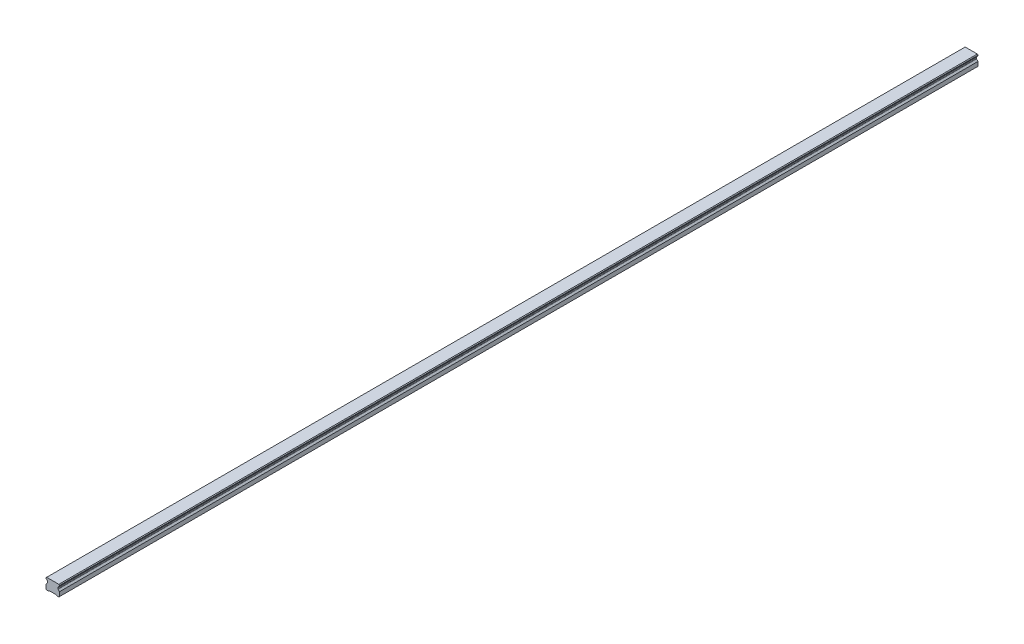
ISO-10303-21;
HEADER;
FILE_DESCRIPTION(('STEP AP214'),'2;1');
FILE_NAME('part.step','',(''),(''),'','','');
FILE_SCHEMA(('AUTOMOTIVE_DESIGN { 1 0 10303 214 1 1 1 1 }'));
ENDSEC;
DATA;
#1=APPLICATION_CONTEXT('core data for automotive mechanical design processes');
#2=APPLICATION_PROTOCOL_DEFINITION('international standard','automotive_design',2000,#1);
#3=PRODUCT_CONTEXT('',#1,'mechanical');
#4=PRODUCT('Part','Part','',(#3));
#5=PRODUCT_RELATED_PRODUCT_CATEGORY('part','',(#4));
#6=PRODUCT_DEFINITION_FORMATION('','',#4);
#7=PRODUCT_DEFINITION_CONTEXT('part definition',#1,'design');
#8=PRODUCT_DEFINITION('design','',#6,#7);
#9=PRODUCT_DEFINITION_SHAPE('','',#8);
#10=(LENGTH_UNIT() NAMED_UNIT(*) SI_UNIT(.MILLI.,.METRE.));
#11=(NAMED_UNIT(*) PLANE_ANGLE_UNIT() SI_UNIT($,.RADIAN.));
#12=(NAMED_UNIT(*) SI_UNIT($,.STERADIAN.) SOLID_ANGLE_UNIT());
#13=UNCERTAINTY_MEASURE_WITH_UNIT(LENGTH_MEASURE(1.E-05),#10,'distance_accuracy_value','');
#14=(GEOMETRIC_REPRESENTATION_CONTEXT(3) GLOBAL_UNCERTAINTY_ASSIGNED_CONTEXT((#13)) GLOBAL_UNIT_ASSIGNED_CONTEXT((#10,
#11,#12)) REPRESENTATION_CONTEXT('',''));
#15=CARTESIAN_POINT('',(0.,0.,0.));
#16=DIRECTION('',(0.,0.,1.));
#17=DIRECTION('',(1.,0.,0.));
#18=AXIS2_PLACEMENT_3D('',#15,#16,#17);
#19=CARTESIAN_POINT('',(0.,11.,-660.));
#20=DIRECTION('',(0.,-1.,0.));
#21=DIRECTION('',(0.,0.,-1.));
#22=AXIS2_PLACEMENT_3D('',#19,#20,#21);
#23=PLANE('',#22);
#24=CARTESIAN_POINT('',(0.,11.,-660.));
#25=DIRECTION('',(0.,-1.,0.));
#26=DIRECTION('',(0.,0.,-1.));
#27=AXIS2_PLACEMENT_3D('',#24,#25,#26);
#28=CIRCLE('',#27,2.5);
#29=CARTESIAN_POINT('',(0.,11.,-662.5));
#30=VERTEX_POINT('',#29);
#31=EDGE_CURVE('E42',#30,#30,#28,.T.);
#32=ORIENTED_EDGE('',*,*,#31,.F.);
#33=EDGE_LOOP('',(#32));
#34=FACE_BOUND('',#33,.T.);
#35=CARTESIAN_POINT('',(0.,11.,-660.));
#36=DIRECTION('',(0.,-1.,0.));
#37=DIRECTION('',(0.,0.,-1.));
#38=AXIS2_PLACEMENT_3D('',#35,#36,#37);
#39=CIRCLE('',#38,3.);
#40=CARTESIAN_POINT('',(0.,11.,-663.));
#41=VERTEX_POINT('',#40);
#42=EDGE_CURVE('E11',#41,#41,#39,.T.);
#43=ORIENTED_EDGE('',*,*,#42,.T.);
#44=EDGE_LOOP('',(#43));
#45=FACE_BOUND('',#44,.T.);
#46=ADVANCED_FACE('F39',(#34,#45),#23,.T.);
#47=CARTESIAN_POINT('',(0.,11.,-660.));
#48=DIRECTION('',(0.,-1.,0.));
#49=DIRECTION('',(0.,0.,-1.));
#50=AXIS2_PLACEMENT_3D('',#47,#48,#49);
#51=CYLINDRICAL_SURFACE('',#50,3.);
#52=ORIENTED_EDGE('',*,*,#42,.F.);
#53=EDGE_LOOP('',(#52));
#54=FACE_BOUND('',#53,.T.);
#55=CARTESIAN_POINT('',(0.,1.,-660.));
#56=DIRECTION('',(0.,-1.,0.));
#57=DIRECTION('',(0.,0.,-1.));
#58=AXIS2_PLACEMENT_3D('',#55,#56,#57);
#59=CIRCLE('',#58,3.);
#60=CARTESIAN_POINT('',(0.,1.,-663.));
#61=VERTEX_POINT('',#60);
#62=EDGE_CURVE('E48',#61,#61,#59,.T.);
#63=ORIENTED_EDGE('',*,*,#62,.T.);
#64=EDGE_LOOP('',(#63));
#65=FACE_BOUND('',#64,.T.);
#66=ADVANCED_FACE('F880',(#54,#65),#51,.F.);
#67=CARTESIAN_POINT('',(0.,11.,-600.));
#68=DIRECTION('',(0.,-1.,0.));
#69=DIRECTION('',(0.,0.,-1.));
#70=AXIS2_PLACEMENT_3D('',#67,#68,#69);
#71=PLANE('',#70);
#72=CARTESIAN_POINT('',(0.,11.,-600.));
#73=DIRECTION('',(0.,-1.,0.));
#74=DIRECTION('',(0.,0.,-1.));
#75=AXIS2_PLACEMENT_3D('',#72,#73,#74);
#76=CIRCLE('',#75,2.5);
#77=CARTESIAN_POINT('',(0.,11.,-602.5));
#78=VERTEX_POINT('',#77);
#79=EDGE_CURVE('E866',#78,#78,#76,.T.);
#80=ORIENTED_EDGE('',*,*,#79,.F.);
#81=EDGE_LOOP('',(#80));
#82=FACE_BOUND('',#81,.T.);
#83=CARTESIAN_POINT('',(0.,11.,-600.));
#84=DIRECTION('',(0.,-1.,0.));
#85=DIRECTION('',(0.,0.,-1.));
#86=AXIS2_PLACEMENT_3D('',#83,#84,#85);
#87=CIRCLE('',#86,3.);
#88=CARTESIAN_POINT('',(0.,11.,-603.));
#89=VERTEX_POINT('',#88);
#90=EDGE_CURVE('E785',#89,#89,#87,.T.);
#91=ORIENTED_EDGE('',*,*,#90,.T.);
#92=EDGE_LOOP('',(#91));
#93=FACE_BOUND('',#92,.T.);
#94=ADVANCED_FACE('F885',(#82,#93),#71,.T.);
#95=CARTESIAN_POINT('',(0.,11.,-600.));
#96=DIRECTION('',(0.,-1.,0.));
#97=DIRECTION('',(0.,0.,-1.));
#98=AXIS2_PLACEMENT_3D('',#95,#96,#97);
#99=CYLINDRICAL_SURFACE('',#98,3.);
#100=ORIENTED_EDGE('',*,*,#90,.F.);
#101=EDGE_LOOP('',(#100));
#102=FACE_BOUND('',#101,.T.);
#103=CARTESIAN_POINT('',(0.,1.,-600.));
#104=DIRECTION('',(0.,-1.,0.));
#105=DIRECTION('',(0.,0.,-1.));
#106=AXIS2_PLACEMENT_3D('',#103,#104,#105);
#107=CIRCLE('',#106,3.);
#108=CARTESIAN_POINT('',(0.,1.,-603.));
#109=VERTEX_POINT('',#108);
#110=EDGE_CURVE('E781',#109,#109,#107,.T.);
#111=ORIENTED_EDGE('',*,*,#110,.T.);
#112=EDGE_LOOP('',(#111));
#113=FACE_BOUND('',#112,.T.);
#114=ADVANCED_FACE('F1140',(#102,#113),#99,.F.);
#115=CARTESIAN_POINT('',(0.,11.,-540.));
#116=DIRECTION('',(0.,-1.,0.));
#117=DIRECTION('',(0.,0.,-1.));
#118=AXIS2_PLACEMENT_3D('',#115,#116,#117);
#119=PLANE('',#118);
#120=CARTESIAN_POINT('',(0.,11.,-540.));
#121=DIRECTION('',(0.,-1.,0.));
#122=DIRECTION('',(0.,0.,-1.));
#123=AXIS2_PLACEMENT_3D('',#120,#121,#122);
#124=CIRCLE('',#123,2.5);
#125=CARTESIAN_POINT('',(0.,11.,-542.5));
#126=VERTEX_POINT('',#125);
#127=EDGE_CURVE('E863',#126,#126,#124,.T.);
#128=ORIENTED_EDGE('',*,*,#127,.F.);
#129=EDGE_LOOP('',(#128));
#130=FACE_BOUND('',#129,.T.);
#131=CARTESIAN_POINT('',(0.,11.,-540.));
#132=DIRECTION('',(0.,-1.,0.));
#133=DIRECTION('',(0.,0.,-1.));
#134=AXIS2_PLACEMENT_3D('',#131,#132,#133);
#135=CIRCLE('',#134,3.);
#136=CARTESIAN_POINT('',(0.,11.,-543.));
#137=VERTEX_POINT('',#136);
#138=EDGE_CURVE('E777',#137,#137,#135,.T.);
#139=ORIENTED_EDGE('',*,*,#138,.T.);
#140=EDGE_LOOP('',(#139));
#141=FACE_BOUND('',#140,.T.);
#142=ADVANCED_FACE('F1136',(#130,#141),#119,.T.);
#143=CARTESIAN_POINT('',(0.,11.,-540.));
#144=DIRECTION('',(0.,-1.,0.));
#145=DIRECTION('',(0.,0.,-1.));
#146=AXIS2_PLACEMENT_3D('',#143,#144,#145);
#147=CYLINDRICAL_SURFACE('',#146,3.);
#148=ORIENTED_EDGE('',*,*,#138,.F.);
#149=EDGE_LOOP('',(#148));
#150=FACE_BOUND('',#149,.T.);
#151=CARTESIAN_POINT('',(0.,1.,-540.));
#152=DIRECTION('',(0.,-1.,0.));
#153=DIRECTION('',(0.,0.,-1.));
#154=AXIS2_PLACEMENT_3D('',#151,#152,#153);
#155=CIRCLE('',#154,3.);
#156=CARTESIAN_POINT('',(0.,1.,-543.));
#157=VERTEX_POINT('',#156);
#158=EDGE_CURVE('E773',#157,#157,#155,.T.);
#159=ORIENTED_EDGE('',*,*,#158,.T.);
#160=EDGE_LOOP('',(#159));
#161=FACE_BOUND('',#160,.T.);
#162=ADVANCED_FACE('F1132',(#150,#161),#147,.F.);
#163=CARTESIAN_POINT('',(0.,11.,-480.));
#164=DIRECTION('',(0.,-1.,0.));
#165=DIRECTION('',(0.,0.,-1.));
#166=AXIS2_PLACEMENT_3D('',#163,#164,#165);
#167=PLANE('',#166);
#168=CARTESIAN_POINT('',(0.,11.,-480.));
#169=DIRECTION('',(0.,-1.,0.));
#170=DIRECTION('',(0.,0.,-1.));
#171=AXIS2_PLACEMENT_3D('',#168,#169,#170);
#172=CIRCLE('',#171,2.5);
#173=CARTESIAN_POINT('',(0.,11.,-482.5));
#174=VERTEX_POINT('',#173);
#175=EDGE_CURVE('E859',#174,#174,#172,.T.);
#176=ORIENTED_EDGE('',*,*,#175,.F.);
#177=EDGE_LOOP('',(#176));
#178=FACE_BOUND('',#177,.T.);
#179=CARTESIAN_POINT('',(0.,11.,-480.));
#180=DIRECTION('',(0.,-1.,0.));
#181=DIRECTION('',(0.,0.,-1.));
#182=AXIS2_PLACEMENT_3D('',#179,#180,#181);
#183=CIRCLE('',#182,3.);
#184=CARTESIAN_POINT('',(0.,11.,-483.));
#185=VERTEX_POINT('',#184);
#186=EDGE_CURVE('E769',#185,#185,#183,.T.);
#187=ORIENTED_EDGE('',*,*,#186,.T.);
#188=EDGE_LOOP('',(#187));
#189=FACE_BOUND('',#188,.T.);
#190=ADVANCED_FACE('F1128',(#178,#189),#167,.T.);
#191=CARTESIAN_POINT('',(0.,11.,-480.));
#192=DIRECTION('',(0.,-1.,0.));
#193=DIRECTION('',(0.,0.,-1.));
#194=AXIS2_PLACEMENT_3D('',#191,#192,#193);
#195=CYLINDRICAL_SURFACE('',#194,3.);
#196=ORIENTED_EDGE('',*,*,#186,.F.);
#197=EDGE_LOOP('',(#196));
#198=FACE_BOUND('',#197,.T.);
#199=CARTESIAN_POINT('',(0.,1.,-480.));
#200=DIRECTION('',(0.,-1.,0.));
#201=DIRECTION('',(0.,0.,-1.));
#202=AXIS2_PLACEMENT_3D('',#199,#200,#201);
#203=CIRCLE('',#202,3.);
#204=CARTESIAN_POINT('',(0.,1.,-483.));
#205=VERTEX_POINT('',#204);
#206=EDGE_CURVE('E765',#205,#205,#203,.T.);
#207=ORIENTED_EDGE('',*,*,#206,.T.);
#208=EDGE_LOOP('',(#207));
#209=FACE_BOUND('',#208,.T.);
#210=ADVANCED_FACE('F1124',(#198,#209),#195,.F.);
#211=CARTESIAN_POINT('',(0.,11.,-420.));
#212=DIRECTION('',(0.,-1.,0.));
#213=DIRECTION('',(0.,0.,-1.));
#214=AXIS2_PLACEMENT_3D('',#211,#212,#213);
#215=PLANE('',#214);
#216=CARTESIAN_POINT('',(0.,11.,-420.));
#217=DIRECTION('',(0.,-1.,0.));
#218=DIRECTION('',(0.,0.,-1.));
#219=AXIS2_PLACEMENT_3D('',#216,#217,#218);
#220=CIRCLE('',#219,2.5);
#221=CARTESIAN_POINT('',(0.,11.,-422.5));
#222=VERTEX_POINT('',#221);
#223=EDGE_CURVE('E855',#222,#222,#220,.T.);
#224=ORIENTED_EDGE('',*,*,#223,.F.);
#225=EDGE_LOOP('',(#224));
#226=FACE_BOUND('',#225,.T.);
#227=CARTESIAN_POINT('',(0.,11.,-420.));
#228=DIRECTION('',(0.,-1.,0.));
#229=DIRECTION('',(0.,0.,-1.));
#230=AXIS2_PLACEMENT_3D('',#227,#228,#229);
#231=CIRCLE('',#230,3.);
#232=CARTESIAN_POINT('',(0.,11.,-423.));
#233=VERTEX_POINT('',#232);
#234=EDGE_CURVE('E761',#233,#233,#231,.T.);
#235=ORIENTED_EDGE('',*,*,#234,.T.);
#236=EDGE_LOOP('',(#235));
#237=FACE_BOUND('',#236,.T.);
#238=ADVANCED_FACE('F1120',(#226,#237),#215,.T.);
#239=CARTESIAN_POINT('',(0.,11.,-420.));
#240=DIRECTION('',(0.,-1.,0.));
#241=DIRECTION('',(0.,0.,-1.));
#242=AXIS2_PLACEMENT_3D('',#239,#240,#241);
#243=CYLINDRICAL_SURFACE('',#242,3.);
#244=ORIENTED_EDGE('',*,*,#234,.F.);
#245=EDGE_LOOP('',(#244));
#246=FACE_BOUND('',#245,.T.);
#247=CARTESIAN_POINT('',(0.,1.,-420.));
#248=DIRECTION('',(0.,-1.,0.));
#249=DIRECTION('',(0.,0.,-1.));
#250=AXIS2_PLACEMENT_3D('',#247,#248,#249);
#251=CIRCLE('',#250,3.);
#252=CARTESIAN_POINT('',(0.,1.,-423.));
#253=VERTEX_POINT('',#252);
#254=EDGE_CURVE('E757',#253,#253,#251,.T.);
#255=ORIENTED_EDGE('',*,*,#254,.T.);
#256=EDGE_LOOP('',(#255));
#257=FACE_BOUND('',#256,.T.);
#258=ADVANCED_FACE('F1116',(#246,#257),#243,.F.);
#259=CARTESIAN_POINT('',(0.,11.,-360.));
#260=DIRECTION('',(0.,-1.,0.));
#261=DIRECTION('',(0.,0.,-1.));
#262=AXIS2_PLACEMENT_3D('',#259,#260,#261);
#263=PLANE('',#262);
#264=CARTESIAN_POINT('',(0.,11.,-360.));
#265=DIRECTION('',(0.,-1.,0.));
#266=DIRECTION('',(0.,0.,-1.));
#267=AXIS2_PLACEMENT_3D('',#264,#265,#266);
#268=CIRCLE('',#267,2.5);
#269=CARTESIAN_POINT('',(0.,11.,-362.5));
#270=VERTEX_POINT('',#269);
#271=EDGE_CURVE('E851',#270,#270,#268,.T.);
#272=ORIENTED_EDGE('',*,*,#271,.F.);
#273=EDGE_LOOP('',(#272));
#274=FACE_BOUND('',#273,.T.);
#275=CARTESIAN_POINT('',(0.,11.,-360.));
#276=DIRECTION('',(0.,-1.,0.));
#277=DIRECTION('',(0.,0.,-1.));
#278=AXIS2_PLACEMENT_3D('',#275,#276,#277);
#279=CIRCLE('',#278,3.);
#280=CARTESIAN_POINT('',(0.,11.,-363.));
#281=VERTEX_POINT('',#280);
#282=EDGE_CURVE('E753',#281,#281,#279,.T.);
#283=ORIENTED_EDGE('',*,*,#282,.T.);
#284=EDGE_LOOP('',(#283));
#285=FACE_BOUND('',#284,.T.);
#286=ADVANCED_FACE('F1112',(#274,#285),#263,.T.);
#287=CARTESIAN_POINT('',(0.,11.,-360.));
#288=DIRECTION('',(0.,-1.,0.));
#289=DIRECTION('',(0.,0.,-1.));
#290=AXIS2_PLACEMENT_3D('',#287,#288,#289);
#291=CYLINDRICAL_SURFACE('',#290,3.);
#292=ORIENTED_EDGE('',*,*,#282,.F.);
#293=EDGE_LOOP('',(#292));
#294=FACE_BOUND('',#293,.T.);
#295=CARTESIAN_POINT('',(0.,1.,-360.));
#296=DIRECTION('',(0.,-1.,0.));
#297=DIRECTION('',(0.,0.,-1.));
#298=AXIS2_PLACEMENT_3D('',#295,#296,#297);
#299=CIRCLE('',#298,3.);
#300=CARTESIAN_POINT('',(0.,1.,-363.));
#301=VERTEX_POINT('',#300);
#302=EDGE_CURVE('E749',#301,#301,#299,.T.);
#303=ORIENTED_EDGE('',*,*,#302,.T.);
#304=EDGE_LOOP('',(#303));
#305=FACE_BOUND('',#304,.T.);
#306=ADVANCED_FACE('F1108',(#294,#305),#291,.F.);
#307=CARTESIAN_POINT('',(0.,11.,-300.));
#308=DIRECTION('',(0.,-1.,0.));
#309=DIRECTION('',(0.,0.,-1.));
#310=AXIS2_PLACEMENT_3D('',#307,#308,#309);
#311=PLANE('',#310);
#312=CARTESIAN_POINT('',(0.,11.,-300.));
#313=DIRECTION('',(0.,-1.,0.));
#314=DIRECTION('',(0.,0.,-1.));
#315=AXIS2_PLACEMENT_3D('',#312,#313,#314);
#316=CIRCLE('',#315,2.5);
#317=CARTESIAN_POINT('',(0.,11.,-302.5));
#318=VERTEX_POINT('',#317);
#319=EDGE_CURVE('E847',#318,#318,#316,.T.);
#320=ORIENTED_EDGE('',*,*,#319,.F.);
#321=EDGE_LOOP('',(#320));
#322=FACE_BOUND('',#321,.T.);
#323=CARTESIAN_POINT('',(0.,11.,-300.));
#324=DIRECTION('',(0.,-1.,0.));
#325=DIRECTION('',(0.,0.,-1.));
#326=AXIS2_PLACEMENT_3D('',#323,#324,#325);
#327=CIRCLE('',#326,3.);
#328=CARTESIAN_POINT('',(0.,11.,-303.));
#329=VERTEX_POINT('',#328);
#330=EDGE_CURVE('E745',#329,#329,#327,.T.);
#331=ORIENTED_EDGE('',*,*,#330,.T.);
#332=EDGE_LOOP('',(#331));
#333=FACE_BOUND('',#332,.T.);
#334=ADVANCED_FACE('F1104',(#322,#333),#311,.T.);
#335=CARTESIAN_POINT('',(0.,11.,-300.));
#336=DIRECTION('',(0.,-1.,0.));
#337=DIRECTION('',(0.,0.,-1.));
#338=AXIS2_PLACEMENT_3D('',#335,#336,#337);
#339=CYLINDRICAL_SURFACE('',#338,3.);
#340=ORIENTED_EDGE('',*,*,#330,.F.);
#341=EDGE_LOOP('',(#340));
#342=FACE_BOUND('',#341,.T.);
#343=CARTESIAN_POINT('',(0.,1.,-300.));
#344=DIRECTION('',(0.,-1.,0.));
#345=DIRECTION('',(0.,0.,-1.));
#346=AXIS2_PLACEMENT_3D('',#343,#344,#345);
#347=CIRCLE('',#346,3.);
#348=CARTESIAN_POINT('',(0.,1.,-303.));
#349=VERTEX_POINT('',#348);
#350=EDGE_CURVE('E741',#349,#349,#347,.T.);
#351=ORIENTED_EDGE('',*,*,#350,.T.);
#352=EDGE_LOOP('',(#351));
#353=FACE_BOUND('',#352,.T.);
#354=ADVANCED_FACE('F1100',(#342,#353),#339,.F.);
#355=CARTESIAN_POINT('',(0.,11.,-240.));
#356=DIRECTION('',(0.,-1.,0.));
#357=DIRECTION('',(0.,0.,-1.));
#358=AXIS2_PLACEMENT_3D('',#355,#356,#357);
#359=PLANE('',#358);
#360=CARTESIAN_POINT('',(0.,11.,-240.));
#361=DIRECTION('',(0.,-1.,0.));
#362=DIRECTION('',(0.,0.,-1.));
#363=AXIS2_PLACEMENT_3D('',#360,#361,#362);
#364=CIRCLE('',#363,2.5);
#365=CARTESIAN_POINT('',(0.,11.,-242.5));
#366=VERTEX_POINT('',#365);
#367=EDGE_CURVE('E843',#366,#366,#364,.T.);
#368=ORIENTED_EDGE('',*,*,#367,.F.);
#369=EDGE_LOOP('',(#368));
#370=FACE_BOUND('',#369,.T.);
#371=CARTESIAN_POINT('',(0.,11.,-240.));
#372=DIRECTION('',(0.,-1.,0.));
#373=DIRECTION('',(0.,0.,-1.));
#374=AXIS2_PLACEMENT_3D('',#371,#372,#373);
#375=CIRCLE('',#374,3.);
#376=CARTESIAN_POINT('',(0.,11.,-243.));
#377=VERTEX_POINT('',#376);
#378=EDGE_CURVE('E737',#377,#377,#375,.T.);
#379=ORIENTED_EDGE('',*,*,#378,.T.);
#380=EDGE_LOOP('',(#379));
#381=FACE_BOUND('',#380,.T.);
#382=ADVANCED_FACE('F1096',(#370,#381),#359,.T.);
#383=CARTESIAN_POINT('',(0.,11.,-240.));
#384=DIRECTION('',(0.,-1.,0.));
#385=DIRECTION('',(0.,0.,-1.));
#386=AXIS2_PLACEMENT_3D('',#383,#384,#385);
#387=CYLINDRICAL_SURFACE('',#386,3.);
#388=ORIENTED_EDGE('',*,*,#378,.F.);
#389=EDGE_LOOP('',(#388));
#390=FACE_BOUND('',#389,.T.);
#391=CARTESIAN_POINT('',(0.,1.,-240.));
#392=DIRECTION('',(0.,-1.,0.));
#393=DIRECTION('',(0.,0.,-1.));
#394=AXIS2_PLACEMENT_3D('',#391,#392,#393);
#395=CIRCLE('',#394,3.);
#396=CARTESIAN_POINT('',(0.,1.,-243.));
#397=VERTEX_POINT('',#396);
#398=EDGE_CURVE('E733',#397,#397,#395,.T.);
#399=ORIENTED_EDGE('',*,*,#398,.T.);
#400=EDGE_LOOP('',(#399));
#401=FACE_BOUND('',#400,.T.);
#402=ADVANCED_FACE('F1092',(#390,#401),#387,.F.);
#403=CARTESIAN_POINT('',(0.,11.,-180.));
#404=DIRECTION('',(0.,-1.,0.));
#405=DIRECTION('',(0.,0.,-1.));
#406=AXIS2_PLACEMENT_3D('',#403,#404,#405);
#407=PLANE('',#406);
#408=CARTESIAN_POINT('',(0.,11.,-180.));
#409=DIRECTION('',(0.,-1.,0.));
#410=DIRECTION('',(0.,0.,-1.));
#411=AXIS2_PLACEMENT_3D('',#408,#409,#410);
#412=CIRCLE('',#411,2.5);
#413=CARTESIAN_POINT('',(0.,11.,-182.5));
#414=VERTEX_POINT('',#413);
#415=EDGE_CURVE('E839',#414,#414,#412,.T.);
#416=ORIENTED_EDGE('',*,*,#415,.F.);
#417=EDGE_LOOP('',(#416));
#418=FACE_BOUND('',#417,.T.);
#419=CARTESIAN_POINT('',(0.,11.,-180.));
#420=DIRECTION('',(0.,-1.,0.));
#421=DIRECTION('',(0.,0.,-1.));
#422=AXIS2_PLACEMENT_3D('',#419,#420,#421);
#423=CIRCLE('',#422,3.);
#424=CARTESIAN_POINT('',(0.,11.,-183.));
#425=VERTEX_POINT('',#424);
#426=EDGE_CURVE('E729',#425,#425,#423,.T.);
#427=ORIENTED_EDGE('',*,*,#426,.T.);
#428=EDGE_LOOP('',(#427));
#429=FACE_BOUND('',#428,.T.);
#430=ADVANCED_FACE('F1088',(#418,#429),#407,.T.);
#431=CARTESIAN_POINT('',(0.,11.,-180.));
#432=DIRECTION('',(0.,-1.,0.));
#433=DIRECTION('',(0.,0.,-1.));
#434=AXIS2_PLACEMENT_3D('',#431,#432,#433);
#435=CYLINDRICAL_SURFACE('',#434,3.);
#436=ORIENTED_EDGE('',*,*,#426,.F.);
#437=EDGE_LOOP('',(#436));
#438=FACE_BOUND('',#437,.T.);
#439=CARTESIAN_POINT('',(0.,1.,-180.));
#440=DIRECTION('',(0.,-1.,0.));
#441=DIRECTION('',(0.,0.,-1.));
#442=AXIS2_PLACEMENT_3D('',#439,#440,#441);
#443=CIRCLE('',#442,3.);
#444=CARTESIAN_POINT('',(0.,1.,-183.));
#445=VERTEX_POINT('',#444);
#446=EDGE_CURVE('E725',#445,#445,#443,.T.);
#447=ORIENTED_EDGE('',*,*,#446,.T.);
#448=EDGE_LOOP('',(#447));
#449=FACE_BOUND('',#448,.T.);
#450=ADVANCED_FACE('F1084',(#438,#449),#435,.F.);
#451=CARTESIAN_POINT('',(0.,11.,-120.));
#452=DIRECTION('',(0.,-1.,0.));
#453=DIRECTION('',(0.,0.,-1.));
#454=AXIS2_PLACEMENT_3D('',#451,#452,#453);
#455=PLANE('',#454);
#456=CARTESIAN_POINT('',(0.,11.,-120.));
#457=DIRECTION('',(0.,-1.,0.));
#458=DIRECTION('',(0.,0.,-1.));
#459=AXIS2_PLACEMENT_3D('',#456,#457,#458);
#460=CIRCLE('',#459,2.5);
#461=CARTESIAN_POINT('',(0.,11.,-122.5));
#462=VERTEX_POINT('',#461);
#463=EDGE_CURVE('E835',#462,#462,#460,.T.);
#464=ORIENTED_EDGE('',*,*,#463,.F.);
#465=EDGE_LOOP('',(#464));
#466=FACE_BOUND('',#465,.T.);
#467=CARTESIAN_POINT('',(0.,11.,-120.));
#468=DIRECTION('',(0.,-1.,0.));
#469=DIRECTION('',(0.,0.,-1.));
#470=AXIS2_PLACEMENT_3D('',#467,#468,#469);
#471=CIRCLE('',#470,3.);
#472=CARTESIAN_POINT('',(0.,11.,-123.));
#473=VERTEX_POINT('',#472);
#474=EDGE_CURVE('E721',#473,#473,#471,.T.);
#475=ORIENTED_EDGE('',*,*,#474,.T.);
#476=EDGE_LOOP('',(#475));
#477=FACE_BOUND('',#476,.T.);
#478=ADVANCED_FACE('F1080',(#466,#477),#455,.T.);
#479=CARTESIAN_POINT('',(0.,11.,-120.));
#480=DIRECTION('',(0.,-1.,0.));
#481=DIRECTION('',(0.,0.,-1.));
#482=AXIS2_PLACEMENT_3D('',#479,#480,#481);
#483=CYLINDRICAL_SURFACE('',#482,3.);
#484=ORIENTED_EDGE('',*,*,#474,.F.);
#485=EDGE_LOOP('',(#484));
#486=FACE_BOUND('',#485,.T.);
#487=CARTESIAN_POINT('',(0.,1.,-120.));
#488=DIRECTION('',(0.,-1.,0.));
#489=DIRECTION('',(0.,0.,-1.));
#490=AXIS2_PLACEMENT_3D('',#487,#488,#489);
#491=CIRCLE('',#490,3.);
#492=CARTESIAN_POINT('',(0.,1.,-123.));
#493=VERTEX_POINT('',#492);
#494=EDGE_CURVE('E717',#493,#493,#491,.T.);
#495=ORIENTED_EDGE('',*,*,#494,.T.);
#496=EDGE_LOOP('',(#495));
#497=FACE_BOUND('',#496,.T.);
#498=ADVANCED_FACE('F1076',(#486,#497),#483,.F.);
#499=CARTESIAN_POINT('',(0.,11.,-59.9999999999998));
#500=DIRECTION('',(0.,-1.,0.));
#501=DIRECTION('',(0.,0.,-1.));
#502=AXIS2_PLACEMENT_3D('',#499,#500,#501);
#503=PLANE('',#502);
#504=CARTESIAN_POINT('',(0.,11.,-59.9999999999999));
#505=DIRECTION('',(0.,-1.,0.));
#506=DIRECTION('',(0.,0.,-1.));
#507=AXIS2_PLACEMENT_3D('',#504,#505,#506);
#508=CIRCLE('',#507,2.5);
#509=CARTESIAN_POINT('',(0.,11.,-62.4999999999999));
#510=VERTEX_POINT('',#509);
#511=EDGE_CURVE('E831',#510,#510,#508,.T.);
#512=ORIENTED_EDGE('',*,*,#511,.F.);
#513=EDGE_LOOP('',(#512));
#514=FACE_BOUND('',#513,.T.);
#515=CARTESIAN_POINT('',(0.,11.,-59.9999999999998));
#516=DIRECTION('',(0.,-1.,0.));
#517=DIRECTION('',(0.,0.,-1.));
#518=AXIS2_PLACEMENT_3D('',#515,#516,#517);
#519=CIRCLE('',#518,3.);
#520=CARTESIAN_POINT('',(0.,11.,-62.9999999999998));
#521=VERTEX_POINT('',#520);
#522=EDGE_CURVE('E713',#521,#521,#519,.T.);
#523=ORIENTED_EDGE('',*,*,#522,.T.);
#524=EDGE_LOOP('',(#523));
#525=FACE_BOUND('',#524,.T.);
#526=ADVANCED_FACE('F1072',(#514,#525),#503,.T.);
#527=CARTESIAN_POINT('',(0.,11.,-59.9999999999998));
#528=DIRECTION('',(0.,-1.,0.));
#529=DIRECTION('',(0.,0.,-1.));
#530=AXIS2_PLACEMENT_3D('',#527,#528,#529);
#531=CYLINDRICAL_SURFACE('',#530,3.);
#532=ORIENTED_EDGE('',*,*,#522,.F.);
#533=EDGE_LOOP('',(#532));
#534=FACE_BOUND('',#533,.T.);
#535=CARTESIAN_POINT('',(0.,1.,-59.9999999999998));
#536=DIRECTION('',(0.,-1.,0.));
#537=DIRECTION('',(0.,0.,-1.));
#538=AXIS2_PLACEMENT_3D('',#535,#536,#537);
#539=CIRCLE('',#538,3.);
#540=CARTESIAN_POINT('',(0.,1.,-62.9999999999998));
#541=VERTEX_POINT('',#540);
#542=EDGE_CURVE('E709',#541,#541,#539,.T.);
#543=ORIENTED_EDGE('',*,*,#542,.T.);
#544=EDGE_LOOP('',(#543));
#545=FACE_BOUND('',#544,.T.);
#546=ADVANCED_FACE('F1068',(#534,#545),#531,.F.);
#547=CARTESIAN_POINT('',(0.,11.,2.22044604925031E-13));
#548=DIRECTION('',(0.,-1.,0.));
#549=DIRECTION('',(0.,0.,-1.));
#550=AXIS2_PLACEMENT_3D('',#547,#548,#549);
#551=PLANE('',#550);
#552=CARTESIAN_POINT('',(0.,11.,1.11022302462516E-13));
#553=DIRECTION('',(0.,-1.,0.));
#554=DIRECTION('',(0.,0.,-1.));
#555=AXIS2_PLACEMENT_3D('',#552,#553,#554);
#556=CIRCLE('',#555,2.5);
#557=CARTESIAN_POINT('',(0.,11.,-2.49999999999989));
#558=VERTEX_POINT('',#557);
#559=EDGE_CURVE('E827',#558,#558,#556,.T.);
#560=ORIENTED_EDGE('',*,*,#559,.F.);
#561=EDGE_LOOP('',(#560));
#562=FACE_BOUND('',#561,.T.);
#563=CARTESIAN_POINT('',(0.,11.,2.22044604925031E-13));
#564=DIRECTION('',(0.,-1.,0.));
#565=DIRECTION('',(0.,0.,-1.));
#566=AXIS2_PLACEMENT_3D('',#563,#564,#565);
#567=CIRCLE('',#566,3.);
#568=CARTESIAN_POINT('',(0.,11.,-2.99999999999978));
#569=VERTEX_POINT('',#568);
#570=EDGE_CURVE('E705',#569,#569,#567,.T.);
#571=ORIENTED_EDGE('',*,*,#570,.T.);
#572=EDGE_LOOP('',(#571));
#573=FACE_BOUND('',#572,.T.);
#574=ADVANCED_FACE('F1064',(#562,#573),#551,.T.);
#575=CARTESIAN_POINT('',(0.,11.,2.22044604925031E-13));
#576=DIRECTION('',(0.,-1.,0.));
#577=DIRECTION('',(0.,0.,-1.));
#578=AXIS2_PLACEMENT_3D('',#575,#576,#577);
#579=CYLINDRICAL_SURFACE('',#578,3.);
#580=ORIENTED_EDGE('',*,*,#570,.F.);
#581=EDGE_LOOP('',(#580));
#582=FACE_BOUND('',#581,.T.);
#583=CARTESIAN_POINT('',(0.,1.,2.22044604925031E-13));
#584=DIRECTION('',(0.,-1.,0.));
#585=DIRECTION('',(0.,0.,-1.));
#586=AXIS2_PLACEMENT_3D('',#583,#584,#585);
#587=CIRCLE('',#586,3.);
#588=CARTESIAN_POINT('',(0.,1.,-2.99999999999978));
#589=VERTEX_POINT('',#588);
#590=EDGE_CURVE('E701',#589,#589,#587,.T.);
#591=ORIENTED_EDGE('',*,*,#590,.T.);
#592=EDGE_LOOP('',(#591));
#593=FACE_BOUND('',#592,.T.);
#594=ADVANCED_FACE('F1060',(#582,#593),#579,.F.);
#595=CARTESIAN_POINT('',(0.,11.,60.0000000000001));
#596=DIRECTION('',(0.,-1.,0.));
#597=DIRECTION('',(0.,0.,-1.));
#598=AXIS2_PLACEMENT_3D('',#595,#596,#597);
#599=PLANE('',#598);
#600=CARTESIAN_POINT('',(0.,11.,60.0000000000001));
#601=DIRECTION('',(0.,-1.,0.));
#602=DIRECTION('',(0.,0.,-1.));
#603=AXIS2_PLACEMENT_3D('',#600,#601,#602);
#604=CIRCLE('',#603,2.5);
#605=CARTESIAN_POINT('',(0.,11.,57.5));
#606=VERTEX_POINT('',#605);
#607=EDGE_CURVE('E823',#606,#606,#604,.T.);
#608=ORIENTED_EDGE('',*,*,#607,.F.);
#609=EDGE_LOOP('',(#608));
#610=FACE_BOUND('',#609,.T.);
#611=CARTESIAN_POINT('',(0.,11.,60.0000000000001));
#612=DIRECTION('',(0.,-1.,0.));
#613=DIRECTION('',(0.,0.,-1.));
#614=AXIS2_PLACEMENT_3D('',#611,#612,#613);
#615=CIRCLE('',#614,3.);
#616=CARTESIAN_POINT('',(0.,11.,57.));
#617=VERTEX_POINT('',#616);
#618=EDGE_CURVE('E697',#617,#617,#615,.T.);
#619=ORIENTED_EDGE('',*,*,#618,.T.);
#620=EDGE_LOOP('',(#619));
#621=FACE_BOUND('',#620,.T.);
#622=ADVANCED_FACE('F1056',(#610,#621),#599,.T.);
#623=CARTESIAN_POINT('',(0.,11.,60.0000000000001));
#624=DIRECTION('',(0.,-1.,0.));
#625=DIRECTION('',(0.,0.,-1.));
#626=AXIS2_PLACEMENT_3D('',#623,#624,#625);
#627=CYLINDRICAL_SURFACE('',#626,3.);
#628=ORIENTED_EDGE('',*,*,#618,.F.);
#629=EDGE_LOOP('',(#628));
#630=FACE_BOUND('',#629,.T.);
#631=CARTESIAN_POINT('',(0.,1.,60.0000000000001));
#632=DIRECTION('',(0.,-1.,0.));
#633=DIRECTION('',(0.,0.,-1.));
#634=AXIS2_PLACEMENT_3D('',#631,#632,#633);
#635=CIRCLE('',#634,3.);
#636=CARTESIAN_POINT('',(0.,1.,57.));
#637=VERTEX_POINT('',#636);
#638=EDGE_CURVE('E693',#637,#637,#635,.T.);
#639=ORIENTED_EDGE('',*,*,#638,.T.);
#640=EDGE_LOOP('',(#639));
#641=FACE_BOUND('',#640,.T.);
#642=ADVANCED_FACE('F1052',(#630,#641),#627,.F.);
#643=CARTESIAN_POINT('',(0.,11.,120.));
#644=DIRECTION('',(0.,-1.,0.));
#645=DIRECTION('',(0.,0.,-1.));
#646=AXIS2_PLACEMENT_3D('',#643,#644,#645);
#647=PLANE('',#646);
#648=CARTESIAN_POINT('',(0.,11.,120.));
#649=DIRECTION('',(0.,-1.,0.));
#650=DIRECTION('',(0.,0.,-1.));
#651=AXIS2_PLACEMENT_3D('',#648,#649,#650);
#652=CIRCLE('',#651,2.5);
#653=CARTESIAN_POINT('',(0.,11.,117.5));
#654=VERTEX_POINT('',#653);
#655=EDGE_CURVE('E819',#654,#654,#652,.T.);
#656=ORIENTED_EDGE('',*,*,#655,.F.);
#657=EDGE_LOOP('',(#656));
#658=FACE_BOUND('',#657,.T.);
#659=CARTESIAN_POINT('',(0.,11.,120.));
#660=DIRECTION('',(0.,-1.,0.));
#661=DIRECTION('',(0.,0.,-1.));
#662=AXIS2_PLACEMENT_3D('',#659,#660,#661);
#663=CIRCLE('',#662,3.);
#664=CARTESIAN_POINT('',(0.,11.,117.));
#665=VERTEX_POINT('',#664);
#666=EDGE_CURVE('E689',#665,#665,#663,.T.);
#667=ORIENTED_EDGE('',*,*,#666,.T.);
#668=EDGE_LOOP('',(#667));
#669=FACE_BOUND('',#668,.T.);
#670=ADVANCED_FACE('F1048',(#658,#669),#647,.T.);
#671=CARTESIAN_POINT('',(0.,11.,120.));
#672=DIRECTION('',(0.,-1.,0.));
#673=DIRECTION('',(0.,0.,-1.));
#674=AXIS2_PLACEMENT_3D('',#671,#672,#673);
#675=CYLINDRICAL_SURFACE('',#674,3.);
#676=ORIENTED_EDGE('',*,*,#666,.F.);
#677=EDGE_LOOP('',(#676));
#678=FACE_BOUND('',#677,.T.);
#679=CARTESIAN_POINT('',(0.,1.,120.));
#680=DIRECTION('',(0.,-1.,0.));
#681=DIRECTION('',(0.,0.,-1.));
#682=AXIS2_PLACEMENT_3D('',#679,#680,#681);
#683=CIRCLE('',#682,3.);
#684=CARTESIAN_POINT('',(0.,1.,117.));
#685=VERTEX_POINT('',#684);
#686=EDGE_CURVE('E685',#685,#685,#683,.T.);
#687=ORIENTED_EDGE('',*,*,#686,.T.);
#688=EDGE_LOOP('',(#687));
#689=FACE_BOUND('',#688,.T.);
#690=ADVANCED_FACE('F1044',(#678,#689),#675,.F.);
#691=CARTESIAN_POINT('',(0.,11.,180.));
#692=DIRECTION('',(0.,-1.,0.));
#693=DIRECTION('',(0.,0.,-1.));
#694=AXIS2_PLACEMENT_3D('',#691,#692,#693);
#695=PLANE('',#694);
#696=CARTESIAN_POINT('',(0.,11.,180.));
#697=DIRECTION('',(0.,-1.,0.));
#698=DIRECTION('',(0.,0.,-1.));
#699=AXIS2_PLACEMENT_3D('',#696,#697,#698);
#700=CIRCLE('',#699,2.5);
#701=CARTESIAN_POINT('',(0.,11.,177.5));
#702=VERTEX_POINT('',#701);
#703=EDGE_CURVE('E815',#702,#702,#700,.T.);
#704=ORIENTED_EDGE('',*,*,#703,.F.);
#705=EDGE_LOOP('',(#704));
#706=FACE_BOUND('',#705,.T.);
#707=CARTESIAN_POINT('',(0.,11.,180.));
#708=DIRECTION('',(0.,-1.,0.));
#709=DIRECTION('',(0.,0.,-1.));
#710=AXIS2_PLACEMENT_3D('',#707,#708,#709);
#711=CIRCLE('',#710,3.);
#712=CARTESIAN_POINT('',(0.,11.,177.));
#713=VERTEX_POINT('',#712);
#714=EDGE_CURVE('E681',#713,#713,#711,.T.);
#715=ORIENTED_EDGE('',*,*,#714,.T.);
#716=EDGE_LOOP('',(#715));
#717=FACE_BOUND('',#716,.T.);
#718=ADVANCED_FACE('F1040',(#706,#717),#695,.T.);
#719=CARTESIAN_POINT('',(0.,11.,180.));
#720=DIRECTION('',(0.,-1.,0.));
#721=DIRECTION('',(0.,0.,-1.));
#722=AXIS2_PLACEMENT_3D('',#719,#720,#721);
#723=CYLINDRICAL_SURFACE('',#722,3.);
#724=ORIENTED_EDGE('',*,*,#714,.F.);
#725=EDGE_LOOP('',(#724));
#726=FACE_BOUND('',#725,.T.);
#727=CARTESIAN_POINT('',(0.,1.,180.));
#728=DIRECTION('',(0.,-1.,0.));
#729=DIRECTION('',(0.,0.,-1.));
#730=AXIS2_PLACEMENT_3D('',#727,#728,#729);
#731=CIRCLE('',#730,3.);
#732=CARTESIAN_POINT('',(0.,1.,177.));
#733=VERTEX_POINT('',#732);
#734=EDGE_CURVE('E677',#733,#733,#731,.T.);
#735=ORIENTED_EDGE('',*,*,#734,.T.);
#736=EDGE_LOOP('',(#735));
#737=FACE_BOUND('',#736,.T.);
#738=ADVANCED_FACE('F1036',(#726,#737),#723,.F.);
#739=CARTESIAN_POINT('',(0.,11.,240.));
#740=DIRECTION('',(0.,-1.,0.));
#741=DIRECTION('',(0.,0.,-1.));
#742=AXIS2_PLACEMENT_3D('',#739,#740,#741);
#743=PLANE('',#742);
#744=CARTESIAN_POINT('',(0.,11.,240.));
#745=DIRECTION('',(0.,-1.,0.));
#746=DIRECTION('',(0.,0.,-1.));
#747=AXIS2_PLACEMENT_3D('',#744,#745,#746);
#748=CIRCLE('',#747,2.5);
#749=CARTESIAN_POINT('',(0.,11.,237.5));
#750=VERTEX_POINT('',#749);
#751=EDGE_CURVE('E811',#750,#750,#748,.T.);
#752=ORIENTED_EDGE('',*,*,#751,.F.);
#753=EDGE_LOOP('',(#752));
#754=FACE_BOUND('',#753,.T.);
#755=CARTESIAN_POINT('',(0.,11.,240.));
#756=DIRECTION('',(0.,-1.,0.));
#757=DIRECTION('',(0.,0.,-1.));
#758=AXIS2_PLACEMENT_3D('',#755,#756,#757);
#759=CIRCLE('',#758,3.);
#760=CARTESIAN_POINT('',(0.,11.,237.));
#761=VERTEX_POINT('',#760);
#762=EDGE_CURVE('E673',#761,#761,#759,.T.);
#763=ORIENTED_EDGE('',*,*,#762,.T.);
#764=EDGE_LOOP('',(#763));
#765=FACE_BOUND('',#764,.T.);
#766=ADVANCED_FACE('F1032',(#754,#765),#743,.T.);
#767=CARTESIAN_POINT('',(0.,11.,240.));
#768=DIRECTION('',(0.,-1.,0.));
#769=DIRECTION('',(0.,0.,-1.));
#770=AXIS2_PLACEMENT_3D('',#767,#768,#769);
#771=CYLINDRICAL_SURFACE('',#770,3.);
#772=ORIENTED_EDGE('',*,*,#762,.F.);
#773=EDGE_LOOP('',(#772));
#774=FACE_BOUND('',#773,.T.);
#775=CARTESIAN_POINT('',(0.,1.,240.));
#776=DIRECTION('',(0.,-1.,0.));
#777=DIRECTION('',(0.,0.,-1.));
#778=AXIS2_PLACEMENT_3D('',#775,#776,#777);
#779=CIRCLE('',#778,3.);
#780=CARTESIAN_POINT('',(0.,1.,237.));
#781=VERTEX_POINT('',#780);
#782=EDGE_CURVE('E669',#781,#781,#779,.T.);
#783=ORIENTED_EDGE('',*,*,#782,.T.);
#784=EDGE_LOOP('',(#783));
#785=FACE_BOUND('',#784,.T.);
#786=ADVANCED_FACE('F1028',(#774,#785),#771,.F.);
#787=CARTESIAN_POINT('',(0.,11.,300.));
#788=DIRECTION('',(0.,-1.,0.));
#789=DIRECTION('',(0.,0.,-1.));
#790=AXIS2_PLACEMENT_3D('',#787,#788,#789);
#791=PLANE('',#790);
#792=CARTESIAN_POINT('',(0.,11.,300.));
#793=DIRECTION('',(0.,-1.,0.));
#794=DIRECTION('',(0.,0.,-1.));
#795=AXIS2_PLACEMENT_3D('',#792,#793,#794);
#796=CIRCLE('',#795,2.5);
#797=CARTESIAN_POINT('',(0.,11.,297.5));
#798=VERTEX_POINT('',#797);
#799=EDGE_CURVE('E807',#798,#798,#796,.T.);
#800=ORIENTED_EDGE('',*,*,#799,.F.);
#801=EDGE_LOOP('',(#800));
#802=FACE_BOUND('',#801,.T.);
#803=CARTESIAN_POINT('',(0.,11.,300.));
#804=DIRECTION('',(0.,-1.,0.));
#805=DIRECTION('',(0.,0.,-1.));
#806=AXIS2_PLACEMENT_3D('',#803,#804,#805);
#807=CIRCLE('',#806,3.);
#808=CARTESIAN_POINT('',(0.,11.,297.));
#809=VERTEX_POINT('',#808);
#810=EDGE_CURVE('E665',#809,#809,#807,.T.);
#811=ORIENTED_EDGE('',*,*,#810,.T.);
#812=EDGE_LOOP('',(#811));
#813=FACE_BOUND('',#812,.T.);
#814=ADVANCED_FACE('F1024',(#802,#813),#791,.T.);
#815=CARTESIAN_POINT('',(0.,11.,300.));
#816=DIRECTION('',(0.,-1.,0.));
#817=DIRECTION('',(0.,0.,-1.));
#818=AXIS2_PLACEMENT_3D('',#815,#816,#817);
#819=CYLINDRICAL_SURFACE('',#818,3.);
#820=ORIENTED_EDGE('',*,*,#810,.F.);
#821=EDGE_LOOP('',(#820));
#822=FACE_BOUND('',#821,.T.);
#823=CARTESIAN_POINT('',(0.,1.,300.));
#824=DIRECTION('',(0.,-1.,0.));
#825=DIRECTION('',(0.,0.,-1.));
#826=AXIS2_PLACEMENT_3D('',#823,#824,#825);
#827=CIRCLE('',#826,3.);
#828=CARTESIAN_POINT('',(0.,1.,297.));
#829=VERTEX_POINT('',#828);
#830=EDGE_CURVE('E661',#829,#829,#827,.T.);
#831=ORIENTED_EDGE('',*,*,#830,.T.);
#832=EDGE_LOOP('',(#831));
#833=FACE_BOUND('',#832,.T.);
#834=ADVANCED_FACE('F1020',(#822,#833),#819,.F.);
#835=CARTESIAN_POINT('',(0.,11.,360.));
#836=DIRECTION('',(0.,-1.,0.));
#837=DIRECTION('',(0.,0.,-1.));
#838=AXIS2_PLACEMENT_3D('',#835,#836,#837);
#839=PLANE('',#838);
#840=CARTESIAN_POINT('',(0.,11.,360.));
#841=DIRECTION('',(0.,-1.,0.));
#842=DIRECTION('',(0.,0.,-1.));
#843=AXIS2_PLACEMENT_3D('',#840,#841,#842);
#844=CIRCLE('',#843,2.5);
#845=CARTESIAN_POINT('',(0.,11.,357.5));
#846=VERTEX_POINT('',#845);
#847=EDGE_CURVE('E803',#846,#846,#844,.T.);
#848=ORIENTED_EDGE('',*,*,#847,.F.);
#849=EDGE_LOOP('',(#848));
#850=FACE_BOUND('',#849,.T.);
#851=CARTESIAN_POINT('',(0.,11.,360.));
#852=DIRECTION('',(0.,-1.,0.));
#853=DIRECTION('',(0.,0.,-1.));
#854=AXIS2_PLACEMENT_3D('',#851,#852,#853);
#855=CIRCLE('',#854,3.);
#856=CARTESIAN_POINT('',(0.,11.,357.));
#857=VERTEX_POINT('',#856);
#858=EDGE_CURVE('E657',#857,#857,#855,.T.);
#859=ORIENTED_EDGE('',*,*,#858,.T.);
#860=EDGE_LOOP('',(#859));
#861=FACE_BOUND('',#860,.T.);
#862=ADVANCED_FACE('F1016',(#850,#861),#839,.T.);
#863=CARTESIAN_POINT('',(0.,11.,360.));
#864=DIRECTION('',(0.,-1.,0.));
#865=DIRECTION('',(0.,0.,-1.));
#866=AXIS2_PLACEMENT_3D('',#863,#864,#865);
#867=CYLINDRICAL_SURFACE('',#866,3.);
#868=ORIENTED_EDGE('',*,*,#858,.F.);
#869=EDGE_LOOP('',(#868));
#870=FACE_BOUND('',#869,.T.);
#871=CARTESIAN_POINT('',(0.,1.,360.));
#872=DIRECTION('',(0.,-1.,0.));
#873=DIRECTION('',(0.,0.,-1.));
#874=AXIS2_PLACEMENT_3D('',#871,#872,#873);
#875=CIRCLE('',#874,3.);
#876=CARTESIAN_POINT('',(0.,1.,357.));
#877=VERTEX_POINT('',#876);
#878=EDGE_CURVE('E653',#877,#877,#875,.T.);
#879=ORIENTED_EDGE('',*,*,#878,.T.);
#880=EDGE_LOOP('',(#879));
#881=FACE_BOUND('',#880,.T.);
#882=ADVANCED_FACE('F1012',(#870,#881),#867,.F.);
#883=CARTESIAN_POINT('',(0.,11.,420.));
#884=DIRECTION('',(0.,-1.,0.));
#885=DIRECTION('',(0.,0.,-1.));
#886=AXIS2_PLACEMENT_3D('',#883,#884,#885);
#887=PLANE('',#886);
#888=CARTESIAN_POINT('',(0.,11.,420.));
#889=DIRECTION('',(0.,-1.,0.));
#890=DIRECTION('',(0.,0.,-1.));
#891=AXIS2_PLACEMENT_3D('',#888,#889,#890);
#892=CIRCLE('',#891,2.5);
#893=CARTESIAN_POINT('',(0.,11.,417.5));
#894=VERTEX_POINT('',#893);
#895=EDGE_CURVE('E799',#894,#894,#892,.T.);
#896=ORIENTED_EDGE('',*,*,#895,.F.);
#897=EDGE_LOOP('',(#896));
#898=FACE_BOUND('',#897,.T.);
#899=CARTESIAN_POINT('',(0.,11.,420.));
#900=DIRECTION('',(0.,-1.,0.));
#901=DIRECTION('',(0.,0.,-1.));
#902=AXIS2_PLACEMENT_3D('',#899,#900,#901);
#903=CIRCLE('',#902,3.);
#904=CARTESIAN_POINT('',(0.,11.,417.));
#905=VERTEX_POINT('',#904);
#906=EDGE_CURVE('E649',#905,#905,#903,.T.);
#907=ORIENTED_EDGE('',*,*,#906,.T.);
#908=EDGE_LOOP('',(#907));
#909=FACE_BOUND('',#908,.T.);
#910=ADVANCED_FACE('F1008',(#898,#909),#887,.T.);
#911=CARTESIAN_POINT('',(0.,11.,420.));
#912=DIRECTION('',(0.,-1.,0.));
#913=DIRECTION('',(0.,0.,-1.));
#914=AXIS2_PLACEMENT_3D('',#911,#912,#913);
#915=CYLINDRICAL_SURFACE('',#914,3.);
#916=ORIENTED_EDGE('',*,*,#906,.F.);
#917=EDGE_LOOP('',(#916));
#918=FACE_BOUND('',#917,.T.);
#919=CARTESIAN_POINT('',(0.,1.,420.));
#920=DIRECTION('',(0.,-1.,0.));
#921=DIRECTION('',(0.,0.,-1.));
#922=AXIS2_PLACEMENT_3D('',#919,#920,#921);
#923=CIRCLE('',#922,3.);
#924=CARTESIAN_POINT('',(0.,1.,417.));
#925=VERTEX_POINT('',#924);
#926=EDGE_CURVE('E645',#925,#925,#923,.T.);
#927=ORIENTED_EDGE('',*,*,#926,.T.);
#928=EDGE_LOOP('',(#927));
#929=FACE_BOUND('',#928,.T.);
#930=ADVANCED_FACE('F1004',(#918,#929),#915,.F.);
#931=CARTESIAN_POINT('',(0.,11.,480.));
#932=DIRECTION('',(0.,-1.,0.));
#933=DIRECTION('',(0.,0.,-1.));
#934=AXIS2_PLACEMENT_3D('',#931,#932,#933);
#935=PLANE('',#934);
#936=CARTESIAN_POINT('',(0.,11.,480.));
#937=DIRECTION('',(0.,-1.,0.));
#938=DIRECTION('',(0.,0.,-1.));
#939=AXIS2_PLACEMENT_3D('',#936,#937,#938);
#940=CIRCLE('',#939,2.5);
#941=CARTESIAN_POINT('',(0.,11.,477.5));
#942=VERTEX_POINT('',#941);
#943=EDGE_CURVE('E795',#942,#942,#940,.T.);
#944=ORIENTED_EDGE('',*,*,#943,.F.);
#945=EDGE_LOOP('',(#944));
#946=FACE_BOUND('',#945,.T.);
#947=CARTESIAN_POINT('',(0.,11.,480.));
#948=DIRECTION('',(0.,-1.,0.));
#949=DIRECTION('',(0.,0.,-1.));
#950=AXIS2_PLACEMENT_3D('',#947,#948,#949);
#951=CIRCLE('',#950,3.);
#952=CARTESIAN_POINT('',(0.,11.,477.));
#953=VERTEX_POINT('',#952);
#954=EDGE_CURVE('E641',#953,#953,#951,.T.);
#955=ORIENTED_EDGE('',*,*,#954,.T.);
#956=EDGE_LOOP('',(#955));
#957=FACE_BOUND('',#956,.T.);
#958=ADVANCED_FACE('F1000',(#946,#957),#935,.T.);
#959=CARTESIAN_POINT('',(0.,11.,480.));
#960=DIRECTION('',(0.,-1.,0.));
#961=DIRECTION('',(0.,0.,-1.));
#962=AXIS2_PLACEMENT_3D('',#959,#960,#961);
#963=CYLINDRICAL_SURFACE('',#962,3.);
#964=ORIENTED_EDGE('',*,*,#954,.F.);
#965=EDGE_LOOP('',(#964));
#966=FACE_BOUND('',#965,.T.);
#967=CARTESIAN_POINT('',(0.,1.,480.));
#968=DIRECTION('',(0.,-1.,0.));
#969=DIRECTION('',(0.,0.,-1.));
#970=AXIS2_PLACEMENT_3D('',#967,#968,#969);
#971=CIRCLE('',#970,3.);
#972=CARTESIAN_POINT('',(0.,1.,477.));
#973=VERTEX_POINT('',#972);
#974=EDGE_CURVE('E637',#973,#973,#971,.T.);
#975=ORIENTED_EDGE('',*,*,#974,.T.);
#976=EDGE_LOOP('',(#975));
#977=FACE_BOUND('',#976,.T.);
#978=ADVANCED_FACE('F996',(#966,#977),#963,.F.);
#979=CARTESIAN_POINT('',(0.,11.,540.));
#980=DIRECTION('',(0.,-1.,0.));
#981=DIRECTION('',(0.,0.,-1.));
#982=AXIS2_PLACEMENT_3D('',#979,#980,#981);
#983=PLANE('',#982);
#984=CARTESIAN_POINT('',(0.,11.,540.));
#985=DIRECTION('',(0.,-1.,0.));
#986=DIRECTION('',(0.,0.,-1.));
#987=AXIS2_PLACEMENT_3D('',#984,#985,#986);
#988=CIRCLE('',#987,2.5);
#989=CARTESIAN_POINT('',(0.,11.,537.5));
#990=VERTEX_POINT('',#989);
#991=EDGE_CURVE('E287',#990,#990,#988,.T.);
#992=ORIENTED_EDGE('',*,*,#991,.F.);
#993=EDGE_LOOP('',(#992));
#994=FACE_BOUND('',#993,.T.);
#995=CARTESIAN_POINT('',(0.,11.,540.));
#996=DIRECTION('',(0.,-1.,0.));
#997=DIRECTION('',(0.,0.,-1.));
#998=AXIS2_PLACEMENT_3D('',#995,#996,#997);
#999=CIRCLE('',#998,3.);
#1000=CARTESIAN_POINT('',(0.,11.,537.));
#1001=VERTEX_POINT('',#1000);
#1002=EDGE_CURVE('E633',#1001,#1001,#999,.T.);
#1003=ORIENTED_EDGE('',*,*,#1002,.T.);
#1004=EDGE_LOOP('',(#1003));
#1005=FACE_BOUND('',#1004,.T.);
#1006=ADVANCED_FACE('F992',(#994,#1005),#983,.T.);
#1007=CARTESIAN_POINT('',(0.,11.,540.));
#1008=DIRECTION('',(0.,-1.,0.));
#1009=DIRECTION('',(0.,0.,-1.));
#1010=AXIS2_PLACEMENT_3D('',#1007,#1008,#1009);
#1011=CYLINDRICAL_SURFACE('',#1010,3.);
#1012=ORIENTED_EDGE('',*,*,#1002,.F.);
#1013=EDGE_LOOP('',(#1012));
#1014=FACE_BOUND('',#1013,.T.);
#1015=CARTESIAN_POINT('',(0.,1.,540.));
#1016=DIRECTION('',(0.,-1.,0.));
#1017=DIRECTION('',(0.,0.,-1.));
#1018=AXIS2_PLACEMENT_3D('',#1015,#1016,#1017);
#1019=CIRCLE('',#1018,3.);
#1020=CARTESIAN_POINT('',(0.,1.,537.));
#1021=VERTEX_POINT('',#1020);
#1022=EDGE_CURVE('E629',#1021,#1021,#1019,.T.);
#1023=ORIENTED_EDGE('',*,*,#1022,.T.);
#1024=EDGE_LOOP('',(#1023));
#1025=FACE_BOUND('',#1024,.T.);
#1026=ADVANCED_FACE('F989',(#1014,#1025),#1011,.F.);
#1027=CARTESIAN_POINT('',(10.,0.,680.));
#1028=DIRECTION('',(0.,1.,0.));
#1029=DIRECTION('',(-1.,0.,0.));
#1030=AXIS2_PLACEMENT_3D('',#1027,#1028,#1029);
#1031=PLANE('',#1030);
#1032=DIRECTION('',(1.,0.,0.));
#1033=VECTOR('',#1032,1.);
#1034=CARTESIAN_POINT('',(10.,0.,-680.));
#1035=LINE('',#1034,#1033);
#1036=CARTESIAN_POINT('',(-9.,0.,-680.));
#1037=VERTEX_POINT('',#1036);
#1038=CARTESIAN_POINT('',(-6.,0.,-680.));
#1039=VERTEX_POINT('',#1038);
#1040=EDGE_CURVE('E512',#1037,#1039,#1035,.T.);
#1041=ORIENTED_EDGE('',*,*,#1040,.T.);
#1042=DIRECTION('',(0.,0.,1.));
#1043=VECTOR('',#1042,1.);
#1044=CARTESIAN_POINT('',(-6.,0.,-680.));
#1045=LINE('',#1044,#1043);
#1046=CARTESIAN_POINT('',(-6.,0.,680.));
#1047=VERTEX_POINT('',#1046);
#1048=EDGE_CURVE('E418',#1039,#1047,#1045,.T.);
#1049=ORIENTED_EDGE('',*,*,#1048,.T.);
#1050=DIRECTION('',(1.,0.,0.));
#1051=VECTOR('',#1050,1.);
#1052=CARTESIAN_POINT('',(10.,0.,680.));
#1053=LINE('',#1052,#1051);
#1054=CARTESIAN_POINT('',(-9.,0.,680.));
#1055=VERTEX_POINT('',#1054);
#1056=EDGE_CURVE('E493',#1055,#1047,#1053,.T.);
#1057=ORIENTED_EDGE('',*,*,#1056,.F.);
#1058=DIRECTION('',(0.,0.,-1.));
#1059=VECTOR('',#1058,1.);
#1060=CARTESIAN_POINT('',(-9.,0.,680.));
#1061=LINE('',#1060,#1059);
#1062=EDGE_CURVE('E564',#1055,#1037,#1061,.T.);
#1063=ORIENTED_EDGE('',*,*,#1062,.T.);
#1064=EDGE_LOOP('',(#1041,#1049,#1057,#1063));
#1065=FACE_BOUND('',#1064,.T.);
#1066=ADVANCED_FACE('F954',(#1065),#1031,.F.);
#1067=CARTESIAN_POINT('',(-10.,16.3,680.));
#1068=DIRECTION('',(1.,0.,0.));
#1069=DIRECTION('',(0.,1.,0.));
#1070=AXIS2_PLACEMENT_3D('',#1067,#1068,#1069);
#1071=PLANE('',#1070);
#1072=DIRECTION('',(0.,-1.,0.));
#1073=VECTOR('',#1072,1.);
#1074=CARTESIAN_POINT('',(-10.,16.3,680.));
#1075=LINE('',#1074,#1073);
#1076=CARTESIAN_POINT('',(-10.,15.3,680.));
#1077=VERTEX_POINT('',#1076);
#1078=CARTESIAN_POINT('',(-10.,14.3,680.));
#1079=VERTEX_POINT('',#1078);
#1080=EDGE_CURVE('E487',#1077,#1079,#1075,.T.);
#1081=ORIENTED_EDGE('',*,*,#1080,.F.);
#1082=DIRECTION('',(0.,0.,-1.));
#1083=VECTOR('',#1082,1.);
#1084=CARTESIAN_POINT('',(-10.,15.3,680.));
#1085=LINE('',#1084,#1083);
#1086=CARTESIAN_POINT('',(-10.,15.3,-680.));
#1087=VERTEX_POINT('',#1086);
#1088=EDGE_CURVE('E506',#1077,#1087,#1085,.T.);
#1089=ORIENTED_EDGE('',*,*,#1088,.T.);
#1090=DIRECTION('',(0.,-1.,0.));
#1091=VECTOR('',#1090,1.);
#1092=CARTESIAN_POINT('',(-10.,16.3,-680.));
#1093=LINE('',#1092,#1091);
#1094=CARTESIAN_POINT('',(-10.,14.3,-680.));
#1095=VERTEX_POINT('',#1094);
#1096=EDGE_CURVE('E507',#1087,#1095,#1093,.T.);
#1097=ORIENTED_EDGE('',*,*,#1096,.T.);
#1098=DIRECTION('',(0.,0.,1.));
#1099=VECTOR('',#1098,1.);
#1100=CARTESIAN_POINT('',(-10.,14.3,-680.));
#1101=LINE('',#1100,#1099);
#1102=EDGE_CURVE('E441',#1095,#1079,#1101,.T.);
#1103=ORIENTED_EDGE('',*,*,#1102,.T.);
#1104=EDGE_LOOP('',(#1081,#1089,#1097,#1103));
#1105=FACE_BOUND('',#1104,.T.);
#1106=ADVANCED_FACE('F958',(#1105),#1071,.F.);
#1107=CARTESIAN_POINT('',(10.,16.3,680.));
#1108=DIRECTION('',(-1.,0.,0.));
#1109=DIRECTION('',(0.,-1.,0.));
#1110=AXIS2_PLACEMENT_3D('',#1107,#1108,#1109);
#1111=PLANE('',#1110);
#1112=DIRECTION('',(0.,1.,0.));
#1113=VECTOR('',#1112,1.);
#1114=CARTESIAN_POINT('',(10.,16.3,680.));
#1115=LINE('',#1114,#1113);
#1116=CARTESIAN_POINT('',(10.,1.00000000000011,680.));
#1117=VERTEX_POINT('',#1116);
#1118=CARTESIAN_POINT('',(10.,7.3,680.));
#1119=VERTEX_POINT('',#1118);
#1120=EDGE_CURVE('E498',#1117,#1119,#1115,.T.);
#1121=ORIENTED_EDGE('',*,*,#1120,.F.);
#1122=DIRECTION('',(0.,0.,-1.));
#1123=VECTOR('',#1122,1.);
#1124=CARTESIAN_POINT('',(10.,1.00000000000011,680.));
#1125=LINE('',#1124,#1123);
#1126=CARTESIAN_POINT('',(10.,1.00000000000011,-680.));
#1127=VERTEX_POINT('',#1126);
#1128=EDGE_CURVE('E571',#1117,#1127,#1125,.T.);
#1129=ORIENTED_EDGE('',*,*,#1128,.T.);
#1130=DIRECTION('',(0.,1.,0.));
#1131=VECTOR('',#1130,1.);
#1132=CARTESIAN_POINT('',(10.,16.3,-680.));
#1133=LINE('',#1132,#1131);
#1134=CARTESIAN_POINT('',(10.,7.3,-680.));
#1135=VERTEX_POINT('',#1134);
#1136=EDGE_CURVE('E517',#1127,#1135,#1133,.T.);
#1137=ORIENTED_EDGE('',*,*,#1136,.T.);
#1138=DIRECTION('',(0.,0.,1.));
#1139=VECTOR('',#1138,1.);
#1140=CARTESIAN_POINT('',(10.,7.3,-680.));
#1141=LINE('',#1140,#1139);
#1142=EDGE_CURVE('E472',#1135,#1119,#1141,.T.);
#1143=ORIENTED_EDGE('',*,*,#1142,.T.);
#1144=EDGE_LOOP('',(#1121,#1129,#1137,#1143));
#1145=FACE_BOUND('',#1144,.T.);
#1146=ADVANCED_FACE('F949',(#1145),#1111,.F.);
#1147=CARTESIAN_POINT('',(-10.,7.3,-680.));
#1148=VERTEX_POINT('',#1147);
#1149=CARTESIAN_POINT('',(-10.,0.999999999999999,-680.));
#1150=VERTEX_POINT('',#1149);
#1151=EDGE_CURVE('E456',#1148,#1150,#1093,.T.);
#1152=ORIENTED_EDGE('',*,*,#1151,.T.);
#1153=DIRECTION('',(0.,0.,1.));
#1154=VECTOR('',#1153,1.);
#1155=CARTESIAN_POINT('',(-10.,0.999999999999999,680.));
#1156=LINE('',#1155,#1154);
#1157=CARTESIAN_POINT('',(-10.,0.999999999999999,680.));
#1158=VERTEX_POINT('',#1157);
#1159=EDGE_CURVE('E568',#1150,#1158,#1156,.T.);
#1160=ORIENTED_EDGE('',*,*,#1159,.T.);
#1161=CARTESIAN_POINT('',(-10.,7.3,680.));
#1162=VERTEX_POINT('',#1161);
#1163=EDGE_CURVE('E492',#1162,#1158,#1075,.T.);
#1164=ORIENTED_EDGE('',*,*,#1163,.F.);
#1165=DIRECTION('',(0.,0.,1.));
#1166=VECTOR('',#1165,1.);
#1167=CARTESIAN_POINT('',(-10.,7.3,-680.));
#1168=LINE('',#1167,#1166);
#1169=EDGE_CURVE('E453',#1148,#1162,#1168,.T.);
#1170=ORIENTED_EDGE('',*,*,#1169,.F.);
#1171=EDGE_LOOP('',(#1152,#1160,#1164,#1170));
#1172=FACE_BOUND('',#1171,.T.);
#1173=ADVANCED_FACE('F952',(#1172),#1071,.F.);
#1174=CARTESIAN_POINT('',(6.,0.,680.));
#1175=VERTEX_POINT('',#1174);
#1176=CARTESIAN_POINT('',(9.,0.,680.));
#1177=VERTEX_POINT('',#1176);
#1178=EDGE_CURVE('E491',#1175,#1177,#1053,.T.);
#1179=ORIENTED_EDGE('',*,*,#1178,.F.);
#1180=DIRECTION('',(0.,0.,1.));
#1181=VECTOR('',#1180,1.);
#1182=CARTESIAN_POINT('',(6.,0.,-680.));
#1183=LINE('',#1182,#1181);
#1184=CARTESIAN_POINT('',(6.,0.,-680.));
#1185=VERTEX_POINT('',#1184);
#1186=EDGE_CURVE('E408',#1185,#1175,#1183,.T.);
#1187=ORIENTED_EDGE('',*,*,#1186,.F.);
#1188=CARTESIAN_POINT('',(9.,0.,-680.));
#1189=VERTEX_POINT('',#1188);
#1190=EDGE_CURVE('E511',#1185,#1189,#1035,.T.);
#1191=ORIENTED_EDGE('',*,*,#1190,.T.);
#1192=DIRECTION('',(0.,0.,1.));
#1193=VECTOR('',#1192,1.);
#1194=CARTESIAN_POINT('',(9.,0.,680.));
#1195=LINE('',#1194,#1193);
#1196=EDGE_CURVE('E560',#1189,#1177,#1195,.T.);
#1197=ORIENTED_EDGE('',*,*,#1196,.T.);
#1198=EDGE_LOOP('',(#1179,#1187,#1191,#1197));
#1199=FACE_BOUND('',#1198,.T.);
#1200=ADVANCED_FACE('F947',(#1199),#1031,.F.);
#1201=CARTESIAN_POINT('',(10.,14.3,-680.));
#1202=VERTEX_POINT('',#1201);
#1203=CARTESIAN_POINT('',(10.,15.3,-680.));
#1204=VERTEX_POINT('',#1203);
#1205=EDGE_CURVE('E516',#1202,#1204,#1133,.T.);
#1206=ORIENTED_EDGE('',*,*,#1205,.T.);
#1207=DIRECTION('',(0.,0.,1.));
#1208=VECTOR('',#1207,1.);
#1209=CARTESIAN_POINT('',(10.,15.3,680.));
#1210=LINE('',#1209,#1208);
#1211=CARTESIAN_POINT('',(10.,15.3,680.));
#1212=VERTEX_POINT('',#1211);
#1213=EDGE_CURVE('E575',#1204,#1212,#1210,.T.);
#1214=ORIENTED_EDGE('',*,*,#1213,.T.);
#1215=CARTESIAN_POINT('',(10.,14.3,680.));
#1216=VERTEX_POINT('',#1215);
#1217=EDGE_CURVE('E497',#1216,#1212,#1115,.T.);
#1218=ORIENTED_EDGE('',*,*,#1217,.F.);
#1219=DIRECTION('',(0.,0.,1.));
#1220=VECTOR('',#1219,1.);
#1221=CARTESIAN_POINT('',(10.,14.3,-680.));
#1222=LINE('',#1221,#1220);
#1223=EDGE_CURVE('E446',#1202,#1216,#1222,.T.);
#1224=ORIENTED_EDGE('',*,*,#1223,.F.);
#1225=EDGE_LOOP('',(#1206,#1214,#1218,#1224));
#1226=FACE_BOUND('',#1225,.T.);
#1227=ADVANCED_FACE('F943',(#1226),#1111,.F.);
#1228=CARTESIAN_POINT('',(10.,16.3,680.));
#1229=DIRECTION('',(0.,-1.,0.));
#1230=DIRECTION('',(0.,0.,-1.));
#1231=AXIS2_PLACEMENT_3D('',#1228,#1229,#1230);
#1232=PLANE('',#1231);
#1233=DIRECTION('',(-1.,0.,0.));
#1234=VECTOR('',#1233,1.);
#1235=CARTESIAN_POINT('',(10.,16.3,-680.));
#1236=LINE('',#1235,#1234);
#1237=CARTESIAN_POINT('',(9.00000000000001,16.3,-680.));
#1238=VERTEX_POINT('',#1237);
#1239=CARTESIAN_POINT('',(-9.,16.3,-680.));
#1240=VERTEX_POINT('',#1239);
#1241=EDGE_CURVE('E521',#1238,#1240,#1236,.T.);
#1242=ORIENTED_EDGE('',*,*,#1241,.T.);
#1243=DIRECTION('',(0.,0.,1.));
#1244=VECTOR('',#1243,1.);
#1245=CARTESIAN_POINT('',(-9.,16.3,680.));
#1246=LINE('',#1245,#1244);
#1247=CARTESIAN_POINT('',(-9.,16.3,680.));
#1248=VERTEX_POINT('',#1247);
#1249=EDGE_CURVE('E545',#1240,#1248,#1246,.T.);
#1250=ORIENTED_EDGE('',*,*,#1249,.T.);
#1251=DIRECTION('',(-1.,0.,0.));
#1252=VECTOR('',#1251,1.);
#1253=CARTESIAN_POINT('',(10.,16.3,680.));
#1254=LINE('',#1253,#1252);
#1255=CARTESIAN_POINT('',(9.00000000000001,16.3,680.));
#1256=VERTEX_POINT('',#1255);
#1257=EDGE_CURVE('E502',#1256,#1248,#1254,.T.);
#1258=ORIENTED_EDGE('',*,*,#1257,.F.);
#1259=DIRECTION('',(0.,0.,-1.));
#1260=VECTOR('',#1259,1.);
#1261=CARTESIAN_POINT('',(9.00000000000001,16.3,680.));
#1262=LINE('',#1261,#1260);
#1263=EDGE_CURVE('E541',#1256,#1238,#1262,.T.);
#1264=ORIENTED_EDGE('',*,*,#1263,.T.);
#1265=EDGE_LOOP('',(#1242,#1250,#1258,#1264));
#1266=FACE_BOUND('',#1265,.T.);
#1267=ADVANCED_FACE('F937',(#1266),#1232,.F.);
#1268=CARTESIAN_POINT('',(0.,0.,680.));
#1269=DIRECTION('',(0.,0.,-1.));
#1270=DIRECTION('',(-1.,0.,0.));
#1271=AXIS2_PLACEMENT_3D('',#1268,#1269,#1270);
#1272=PLANE('',#1271);
#1273=ORIENTED_EDGE('',*,*,#1056,.T.);
#1274=DIRECTION('',(-0.707106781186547,-0.707106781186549,0.));
#1275=VECTOR('',#1274,1.);
#1276=CARTESIAN_POINT('',(-6.,0.,680.));
#1277=LINE('',#1276,#1275);
#1278=CARTESIAN_POINT('',(-5.,1.,680.));
#1279=VERTEX_POINT('',#1278);
#1280=EDGE_CURVE('E401',#1279,#1047,#1277,.T.);
#1281=ORIENTED_EDGE('',*,*,#1280,.F.);
#1282=DIRECTION('',(-1.,0.,0.));
#1283=VECTOR('',#1282,1.);
#1284=CARTESIAN_POINT('',(-5.,1.,680.));
#1285=LINE('',#1284,#1283);
#1286=CARTESIAN_POINT('',(5.,1.,680.));
#1287=VERTEX_POINT('',#1286);
#1288=EDGE_CURVE('E412',#1287,#1279,#1285,.T.);
#1289=ORIENTED_EDGE('',*,*,#1288,.F.);
#1290=DIRECTION('',(-0.707106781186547,0.707106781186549,0.));
#1291=VECTOR('',#1290,1.);
#1292=CARTESIAN_POINT('',(5.,1.,680.));
#1293=LINE('',#1292,#1291);
#1294=EDGE_CURVE('E393',#1175,#1287,#1293,.T.);
#1295=ORIENTED_EDGE('',*,*,#1294,.F.);
#1296=ORIENTED_EDGE('',*,*,#1178,.T.);
#1297=DIRECTION('',(-0.707106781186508,-0.707106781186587,0.));
#1298=VECTOR('',#1297,1.);
#1299=CARTESIAN_POINT('',(10.,1.00000000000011,680.));
#1300=LINE('',#1299,#1298);
#1301=EDGE_CURVE('E551',#1177,#1117,#1300,.F.);
#1302=ORIENTED_EDGE('',*,*,#1301,.T.);
#1303=ORIENTED_EDGE('',*,*,#1120,.T.);
#1304=DIRECTION('',(0.707106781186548,-0.707106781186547,0.));
#1305=VECTOR('',#1304,1.);
#1306=CARTESIAN_POINT('',(10.,7.3,680.));
#1307=LINE('',#1306,#1305);
#1308=CARTESIAN_POINT('',(7.95955988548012,9.34044011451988,680.));
#1309=VERTEX_POINT('',#1308);
#1310=EDGE_CURVE('E422',#1309,#1119,#1307,.T.);
#1311=ORIENTED_EDGE('',*,*,#1310,.F.);
#1312=CARTESIAN_POINT('',(8.66666666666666,10.0475468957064,680.));
#1313=DIRECTION('',(0.,0.,-1.));
#1314=DIRECTION('',(-1.,0.,0.));
#1315=AXIS2_PLACEMENT_3D('',#1312,#1313,#1314);
#1316=CIRCLE('',#1315,1.);
#1317=CARTESIAN_POINT('',(7.66666666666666,10.0475468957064,680.));
#1318=VERTEX_POINT('',#1317);
#1319=EDGE_CURVE('E606',#1309,#1318,#1316,.T.);
#1320=ORIENTED_EDGE('',*,*,#1319,.T.);
#1321=DIRECTION('',(0.,-1.,0.));
#1322=VECTOR('',#1321,1.);
#1323=CARTESIAN_POINT('',(7.66666666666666,9.63333333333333,680.));
#1324=LINE('',#1323,#1322);
#1325=CARTESIAN_POINT('',(7.66666666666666,11.5524531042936,680.));
#1326=VERTEX_POINT('',#1325);
#1327=EDGE_CURVE('E464',#1326,#1318,#1324,.T.);
#1328=ORIENTED_EDGE('',*,*,#1327,.F.);
#1329=CARTESIAN_POINT('',(8.66666666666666,11.5524531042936,680.));
#1330=DIRECTION('',(0.,0.,-1.));
#1331=DIRECTION('',(-1.,0.,0.));
#1332=AXIS2_PLACEMENT_3D('',#1329,#1330,#1331);
#1333=CIRCLE('',#1332,1.);
#1334=CARTESIAN_POINT('',(7.95955988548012,12.2595598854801,680.));
#1335=VERTEX_POINT('',#1334);
#1336=EDGE_CURVE('E612',#1326,#1335,#1333,.T.);
#1337=ORIENTED_EDGE('',*,*,#1336,.T.);
#1338=DIRECTION('',(-0.707106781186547,-0.707106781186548,0.));
#1339=VECTOR('',#1338,1.);
#1340=CARTESIAN_POINT('',(7.66666666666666,11.9666666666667,680.));
#1341=LINE('',#1340,#1339);
#1342=EDGE_CURVE('E475',#1216,#1335,#1341,.T.);
#1343=ORIENTED_EDGE('',*,*,#1342,.F.);
#1344=ORIENTED_EDGE('',*,*,#1217,.T.);
#1345=DIRECTION('',(0.707106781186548,-0.707106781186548,0.));
#1346=VECTOR('',#1345,1.);
#1347=CARTESIAN_POINT('',(9.00000000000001,16.3,680.));
#1348=LINE('',#1347,#1346);
#1349=EDGE_CURVE('E548',#1212,#1256,#1348,.F.);
#1350=ORIENTED_EDGE('',*,*,#1349,.T.);
#1351=ORIENTED_EDGE('',*,*,#1257,.T.);
#1352=DIRECTION('',(0.707106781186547,0.707106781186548,0.));
#1353=VECTOR('',#1352,1.);
#1354=CARTESIAN_POINT('',(-10.,15.3,680.));
#1355=LINE('',#1354,#1353);
#1356=EDGE_CURVE('E557',#1248,#1077,#1355,.F.);
#1357=ORIENTED_EDGE('',*,*,#1356,.T.);
#1358=ORIENTED_EDGE('',*,*,#1080,.T.);
#1359=DIRECTION('',(-0.707106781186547,0.707106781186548,0.));
#1360=VECTOR('',#1359,1.);
#1361=CARTESIAN_POINT('',(-7.66666666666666,11.9666666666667,680.));
#1362=LINE('',#1361,#1360);
#1363=CARTESIAN_POINT('',(-7.95955988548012,12.2595598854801,680.));
#1364=VERTEX_POINT('',#1363);
#1365=EDGE_CURVE('E442',#1364,#1079,#1362,.T.);
#1366=ORIENTED_EDGE('',*,*,#1365,.F.);
#1367=CARTESIAN_POINT('',(-8.66666666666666,11.5524531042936,680.));
#1368=DIRECTION('',(0.,0.,-1.));
#1369=DIRECTION('',(-1.,0.,0.));
#1370=AXIS2_PLACEMENT_3D('',#1367,#1368,#1369);
#1371=CIRCLE('',#1370,1.);
#1372=CARTESIAN_POINT('',(-7.66666666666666,11.5524531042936,680.));
#1373=VERTEX_POINT('',#1372);
#1374=EDGE_CURVE('E624',#1364,#1373,#1371,.T.);
#1375=ORIENTED_EDGE('',*,*,#1374,.T.);
#1376=DIRECTION('',(0.,1.,0.));
#1377=VECTOR('',#1376,1.);
#1378=CARTESIAN_POINT('',(-7.66666666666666,9.63333333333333,680.));
#1379=LINE('',#1378,#1377);
#1380=CARTESIAN_POINT('',(-7.66666666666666,10.0475468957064,680.));
#1381=VERTEX_POINT('',#1380);
#1382=EDGE_CURVE('E434',#1381,#1373,#1379,.T.);
#1383=ORIENTED_EDGE('',*,*,#1382,.F.);
#1384=CARTESIAN_POINT('',(-8.66666666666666,10.0475468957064,680.));
#1385=DIRECTION('',(0.,0.,-1.));
#1386=DIRECTION('',(-1.,0.,0.));
#1387=AXIS2_PLACEMENT_3D('',#1384,#1385,#1386);
#1388=CIRCLE('',#1387,1.);
#1389=CARTESIAN_POINT('',(-7.95955988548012,9.34044011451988,680.));
#1390=VERTEX_POINT('',#1389);
#1391=EDGE_CURVE('E618',#1381,#1390,#1388,.T.);
#1392=ORIENTED_EDGE('',*,*,#1391,.T.);
#1393=DIRECTION('',(0.707106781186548,0.707106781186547,0.));
#1394=VECTOR('',#1393,1.);
#1395=CARTESIAN_POINT('',(-10.,7.3,680.));
#1396=LINE('',#1395,#1394);
#1397=EDGE_CURVE('E445',#1162,#1390,#1396,.T.);
#1398=ORIENTED_EDGE('',*,*,#1397,.F.);
#1399=ORIENTED_EDGE('',*,*,#1163,.T.);
#1400=DIRECTION('',(-0.707106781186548,0.707106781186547,0.));
#1401=VECTOR('',#1400,1.);
#1402=CARTESIAN_POINT('',(-9.,0.,680.));
#1403=LINE('',#1402,#1401);
#1404=EDGE_CURVE('E554',#1158,#1055,#1403,.F.);
#1405=ORIENTED_EDGE('',*,*,#1404,.T.);
#1406=EDGE_LOOP('',(#1273,#1281,#1289,#1295,#1296,#1302,#1303,#1311,#1320,#1328,#1337,#1343,
#1344,#1350,#1351,#1357,#1358,#1366,#1375,#1383,#1392,#1398,#1399,#1405));
#1407=FACE_BOUND('',#1406,.T.);
#1408=ADVANCED_FACE('F934',(#1407),#1272,.F.);
#1409=CARTESIAN_POINT('',(0.,0.,-680.));
#1410=DIRECTION('',(0.,0.,-1.));
#1411=DIRECTION('',(-1.,0.,0.));
#1412=AXIS2_PLACEMENT_3D('',#1409,#1410,#1411);
#1413=PLANE('',#1412);
#1414=DIRECTION('',(-0.707106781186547,-0.707106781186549,0.));
#1415=VECTOR('',#1414,1.);
#1416=CARTESIAN_POINT('',(-6.,0.,-680.));
#1417=LINE('',#1416,#1415);
#1418=CARTESIAN_POINT('',(-5.,1.,-680.));
#1419=VERTEX_POINT('',#1418);
#1420=EDGE_CURVE('E404',#1419,#1039,#1417,.T.);
#1421=ORIENTED_EDGE('',*,*,#1420,.T.);
#1422=ORIENTED_EDGE('',*,*,#1040,.F.);
#1423=DIRECTION('',(0.707106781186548,-0.707106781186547,0.));
#1424=VECTOR('',#1423,1.);
#1425=CARTESIAN_POINT('',(-4.49999999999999,-4.5,-680.));
#1426=LINE('',#1425,#1424);
#1427=EDGE_CURVE('E535',#1037,#1150,#1426,.F.);
#1428=ORIENTED_EDGE('',*,*,#1427,.T.);
#1429=ORIENTED_EDGE('',*,*,#1151,.F.);
#1430=DIRECTION('',(0.707106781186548,0.707106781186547,0.));
#1431=VECTOR('',#1430,1.);
#1432=CARTESIAN_POINT('',(-10.,7.3,-680.));
#1433=LINE('',#1432,#1431);
#1434=CARTESIAN_POINT('',(-7.95955988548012,9.34044011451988,-680.));
#1435=VERTEX_POINT('',#1434);
#1436=EDGE_CURVE('E433',#1148,#1435,#1433,.T.);
#1437=ORIENTED_EDGE('',*,*,#1436,.T.);
#1438=CARTESIAN_POINT('',(-8.66666666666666,10.0475468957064,-680.));
#1439=DIRECTION('',(0.,0.,-1.));
#1440=DIRECTION('',(-1.,0.,0.));
#1441=AXIS2_PLACEMENT_3D('',#1438,#1439,#1440);
#1442=CIRCLE('',#1441,1.);
#1443=CARTESIAN_POINT('',(-7.66666666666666,10.0475468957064,-680.));
#1444=VERTEX_POINT('',#1443);
#1445=EDGE_CURVE('E621',#1435,#1444,#1442,.F.);
#1446=ORIENTED_EDGE('',*,*,#1445,.T.);
#1447=DIRECTION('',(0.,1.,0.));
#1448=VECTOR('',#1447,1.);
#1449=CARTESIAN_POINT('',(-7.66666666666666,9.63333333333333,-680.));
#1450=LINE('',#1449,#1448);
#1451=CARTESIAN_POINT('',(-7.66666666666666,11.5524531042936,-680.));
#1452=VERTEX_POINT('',#1451);
#1453=EDGE_CURVE('E438',#1444,#1452,#1450,.T.);
#1454=ORIENTED_EDGE('',*,*,#1453,.T.);
#1455=CARTESIAN_POINT('',(-8.66666666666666,11.5524531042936,-680.));
#1456=DIRECTION('',(0.,0.,-1.));
#1457=DIRECTION('',(-1.,0.,0.));
#1458=AXIS2_PLACEMENT_3D('',#1455,#1456,#1457);
#1459=CIRCLE('',#1458,1.);
#1460=CARTESIAN_POINT('',(-7.95955988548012,12.2595598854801,-680.));
#1461=VERTEX_POINT('',#1460);
#1462=EDGE_CURVE('E64',#1452,#1461,#1459,.F.);
#1463=ORIENTED_EDGE('',*,*,#1462,.T.);
#1464=DIRECTION('',(-0.707106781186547,0.707106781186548,0.));
#1465=VECTOR('',#1464,1.);
#1466=CARTESIAN_POINT('',(-7.66666666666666,11.9666666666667,-680.));
#1467=LINE('',#1466,#1465);
#1468=EDGE_CURVE('E430',#1461,#1095,#1467,.T.);
#1469=ORIENTED_EDGE('',*,*,#1468,.T.);
#1470=ORIENTED_EDGE('',*,*,#1096,.F.);
#1471=DIRECTION('',(-0.707106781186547,-0.707106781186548,0.));
#1472=VECTOR('',#1471,1.);
#1473=CARTESIAN_POINT('',(-12.65,12.65,-680.));
#1474=LINE('',#1473,#1472);
#1475=EDGE_CURVE('E538',#1087,#1240,#1474,.F.);
#1476=ORIENTED_EDGE('',*,*,#1475,.T.);
#1477=ORIENTED_EDGE('',*,*,#1241,.F.);
#1478=DIRECTION('',(-0.707106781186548,0.707106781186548,0.));
#1479=VECTOR('',#1478,1.);
#1480=CARTESIAN_POINT('',(12.65,12.65,-680.));
#1481=LINE('',#1480,#1479);
#1482=EDGE_CURVE('E528',#1238,#1204,#1481,.F.);
#1483=ORIENTED_EDGE('',*,*,#1482,.T.);
#1484=ORIENTED_EDGE('',*,*,#1205,.F.);
#1485=DIRECTION('',(-0.707106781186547,-0.707106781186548,0.));
#1486=VECTOR('',#1485,1.);
#1487=CARTESIAN_POINT('',(7.66666666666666,11.9666666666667,-680.));
#1488=LINE('',#1487,#1486);
#1489=CARTESIAN_POINT('',(7.95955988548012,12.2595598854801,-680.));
#1490=VERTEX_POINT('',#1489);
#1491=EDGE_CURVE('E463',#1202,#1490,#1488,.T.);
#1492=ORIENTED_EDGE('',*,*,#1491,.T.);
#1493=CARTESIAN_POINT('',(8.66666666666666,11.5524531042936,-680.));
#1494=DIRECTION('',(0.,0.,-1.));
#1495=DIRECTION('',(-1.,0.,0.));
#1496=AXIS2_PLACEMENT_3D('',#1493,#1494,#1495);
#1497=CIRCLE('',#1496,1.);
#1498=CARTESIAN_POINT('',(7.66666666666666,11.5524531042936,-680.));
#1499=VERTEX_POINT('',#1498);
#1500=EDGE_CURVE('E615',#1490,#1499,#1497,.F.);
#1501=ORIENTED_EDGE('',*,*,#1500,.T.);
#1502=DIRECTION('',(0.,-1.,0.));
#1503=VECTOR('',#1502,1.);
#1504=CARTESIAN_POINT('',(7.66666666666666,9.63333333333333,-680.));
#1505=LINE('',#1504,#1503);
#1506=CARTESIAN_POINT('',(7.66666666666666,10.0475468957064,-680.));
#1507=VERTEX_POINT('',#1506);
#1508=EDGE_CURVE('E468',#1499,#1507,#1505,.T.);
#1509=ORIENTED_EDGE('',*,*,#1508,.T.);
#1510=CARTESIAN_POINT('',(8.66666666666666,10.0475468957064,-680.));
#1511=DIRECTION('',(0.,0.,-1.));
#1512=DIRECTION('',(-1.,0.,0.));
#1513=AXIS2_PLACEMENT_3D('',#1510,#1511,#1512);
#1514=CIRCLE('',#1513,1.);
#1515=CARTESIAN_POINT('',(7.95955988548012,9.34044011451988,-680.));
#1516=VERTEX_POINT('',#1515);
#1517=EDGE_CURVE('E609',#1507,#1516,#1514,.F.);
#1518=ORIENTED_EDGE('',*,*,#1517,.T.);
#1519=DIRECTION('',(0.707106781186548,-0.707106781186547,0.));
#1520=VECTOR('',#1519,1.);
#1521=CARTESIAN_POINT('',(10.,7.3,-680.));
#1522=LINE('',#1521,#1520);
#1523=EDGE_CURVE('E460',#1516,#1135,#1522,.T.);
#1524=ORIENTED_EDGE('',*,*,#1523,.T.);
#1525=ORIENTED_EDGE('',*,*,#1136,.F.);
#1526=DIRECTION('',(0.707106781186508,0.707106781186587,0.));
#1527=VECTOR('',#1526,1.);
#1528=CARTESIAN_POINT('',(4.5000000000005,-4.5,-680.));
#1529=LINE('',#1528,#1527);
#1530=EDGE_CURVE('E531',#1127,#1189,#1529,.F.);
#1531=ORIENTED_EDGE('',*,*,#1530,.T.);
#1532=ORIENTED_EDGE('',*,*,#1190,.F.);
#1533=DIRECTION('',(-0.707106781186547,0.707106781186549,0.));
#1534=VECTOR('',#1533,1.);
#1535=CARTESIAN_POINT('',(5.,1.,-680.));
#1536=LINE('',#1535,#1534);
#1537=CARTESIAN_POINT('',(5.,1.,-680.));
#1538=VERTEX_POINT('',#1537);
#1539=EDGE_CURVE('E397',#1185,#1538,#1536,.T.);
#1540=ORIENTED_EDGE('',*,*,#1539,.T.);
#1541=DIRECTION('',(-1.,0.,0.));
#1542=VECTOR('',#1541,1.);
#1543=CARTESIAN_POINT('',(-5.,1.,-680.));
#1544=LINE('',#1543,#1542);
#1545=EDGE_CURVE('E56',#1538,#1419,#1544,.T.);
#1546=ORIENTED_EDGE('',*,*,#1545,.T.);
#1547=EDGE_LOOP('',(#1421,#1422,#1428,#1429,#1437,#1446,#1454,#1463,#1469,#1470,#1476,#1477,
#1483,#1484,#1492,#1501,#1509,#1518,#1524,#1525,#1531,#1532,#1540,#1546));
#1548=FACE_BOUND('',#1547,.T.);
#1549=ADVANCED_FACE('F932',(#1548),#1413,.T.);
#1550=CARTESIAN_POINT('',(10.,7.3,-680.));
#1551=DIRECTION('',(-0.707106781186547,-0.707106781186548,0.));
#1552=DIRECTION('',(0.707106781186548,-0.707106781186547,0.));
#1553=AXIS2_PLACEMENT_3D('',#1550,#1551,#1552);
#1554=PLANE('',#1553);
#1555=ORIENTED_EDGE('',*,*,#1523,.F.);
#1556=DIRECTION('',(0.,0.,1.));
#1557=VECTOR('',#1556,1.);
#1558=CARTESIAN_POINT('',(7.95955988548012,9.34044011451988,680.));
#1559=LINE('',#1558,#1557);
#1560=EDGE_CURVE('E578',#1516,#1309,#1559,.T.);
#1561=ORIENTED_EDGE('',*,*,#1560,.T.);
#1562=ORIENTED_EDGE('',*,*,#1310,.T.);
#1563=ORIENTED_EDGE('',*,*,#1142,.F.);
#1564=EDGE_LOOP('',(#1555,#1561,#1562,#1563));
#1565=FACE_BOUND('',#1564,.T.);
#1566=ADVANCED_FACE('F925',(#1565),#1554,.F.);
#1567=CARTESIAN_POINT('',(7.66666666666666,9.63333333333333,-680.));
#1568=DIRECTION('',(-1.,0.,0.));
#1569=DIRECTION('',(0.,-1.,0.));
#1570=AXIS2_PLACEMENT_3D('',#1567,#1568,#1569);
#1571=PLANE('',#1570);
#1572=ORIENTED_EDGE('',*,*,#1327,.T.);
#1573=DIRECTION('',(0.,0.,1.));
#1574=VECTOR('',#1573,1.);
#1575=CARTESIAN_POINT('',(7.66666666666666,10.0475468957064,-680.));
#1576=LINE('',#1575,#1574);
#1577=EDGE_CURVE('E586',#1318,#1507,#1576,.F.);
#1578=ORIENTED_EDGE('',*,*,#1577,.T.);
#1579=ORIENTED_EDGE('',*,*,#1508,.F.);
#1580=DIRECTION('',(0.,0.,1.));
#1581=VECTOR('',#1580,1.);
#1582=CARTESIAN_POINT('',(7.66666666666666,11.5524531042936,680.));
#1583=LINE('',#1582,#1581);
#1584=EDGE_CURVE('E582',#1499,#1326,#1583,.T.);
#1585=ORIENTED_EDGE('',*,*,#1584,.T.);
#1586=EDGE_LOOP('',(#1572,#1578,#1579,#1585));
#1587=FACE_BOUND('',#1586,.T.);
#1588=ADVANCED_FACE('F922',(#1587),#1571,.F.);
#1589=CARTESIAN_POINT('',(7.66666666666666,11.9666666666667,-680.));
#1590=DIRECTION('',(-0.707106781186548,0.707106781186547,0.));
#1591=DIRECTION('',(-0.707106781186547,-0.707106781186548,0.));
#1592=AXIS2_PLACEMENT_3D('',#1589,#1590,#1591);
#1593=PLANE('',#1592);
#1594=ORIENTED_EDGE('',*,*,#1342,.T.);
#1595=DIRECTION('',(0.,0.,1.));
#1596=VECTOR('',#1595,1.);
#1597=CARTESIAN_POINT('',(7.95955988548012,12.2595598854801,-680.));
#1598=LINE('',#1597,#1596);
#1599=EDGE_CURVE('E589',#1335,#1490,#1598,.F.);
#1600=ORIENTED_EDGE('',*,*,#1599,.T.);
#1601=ORIENTED_EDGE('',*,*,#1491,.F.);
#1602=ORIENTED_EDGE('',*,*,#1223,.T.);
#1603=EDGE_LOOP('',(#1594,#1600,#1601,#1602));
#1604=FACE_BOUND('',#1603,.T.);
#1605=ADVANCED_FACE('F920',(#1604),#1593,.F.);
#1606=CARTESIAN_POINT('',(-7.66666666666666,11.9666666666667,-680.));
#1607=DIRECTION('',(0.707106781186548,0.707106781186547,0.));
#1608=DIRECTION('',(-0.707106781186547,0.707106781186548,0.));
#1609=AXIS2_PLACEMENT_3D('',#1606,#1607,#1608);
#1610=PLANE('',#1609);
#1611=ORIENTED_EDGE('',*,*,#1468,.F.);
#1612=DIRECTION('',(0.,0.,1.));
#1613=VECTOR('',#1612,1.);
#1614=CARTESIAN_POINT('',(-7.95955988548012,12.2595598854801,680.));
#1615=LINE('',#1614,#1613);
#1616=EDGE_CURVE('E602',#1461,#1364,#1615,.T.);
#1617=ORIENTED_EDGE('',*,*,#1616,.T.);
#1618=ORIENTED_EDGE('',*,*,#1365,.T.);
#1619=ORIENTED_EDGE('',*,*,#1102,.F.);
#1620=EDGE_LOOP('',(#1611,#1617,#1618,#1619));
#1621=FACE_BOUND('',#1620,.T.);
#1622=ADVANCED_FACE('F912',(#1621),#1610,.F.);
#1623=CARTESIAN_POINT('',(-7.66666666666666,9.63333333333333,-680.));
#1624=DIRECTION('',(1.,0.,0.));
#1625=DIRECTION('',(0.,1.,0.));
#1626=AXIS2_PLACEMENT_3D('',#1623,#1624,#1625);
#1627=PLANE('',#1626);
#1628=ORIENTED_EDGE('',*,*,#1453,.F.);
#1629=DIRECTION('',(0.,0.,1.));
#1630=VECTOR('',#1629,1.);
#1631=CARTESIAN_POINT('',(-7.66666666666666,10.0475468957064,680.));
#1632=LINE('',#1631,#1630);
#1633=EDGE_CURVE('E595',#1444,#1381,#1632,.T.);
#1634=ORIENTED_EDGE('',*,*,#1633,.T.);
#1635=ORIENTED_EDGE('',*,*,#1382,.T.);
#1636=DIRECTION('',(0.,0.,1.));
#1637=VECTOR('',#1636,1.);
#1638=CARTESIAN_POINT('',(-7.66666666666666,11.5524531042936,-680.));
#1639=LINE('',#1638,#1637);
#1640=EDGE_CURVE('E592',#1373,#1452,#1639,.F.);
#1641=ORIENTED_EDGE('',*,*,#1640,.T.);
#1642=EDGE_LOOP('',(#1628,#1634,#1635,#1641));
#1643=FACE_BOUND('',#1642,.T.);
#1644=ADVANCED_FACE('F908',(#1643),#1627,.F.);
#1645=CARTESIAN_POINT('',(-10.,7.3,-680.));
#1646=DIRECTION('',(0.707106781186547,-0.707106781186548,0.));
#1647=DIRECTION('',(0.707106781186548,0.707106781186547,0.));
#1648=AXIS2_PLACEMENT_3D('',#1645,#1646,#1647);
#1649=PLANE('',#1648);
#1650=ORIENTED_EDGE('',*,*,#1397,.T.);
#1651=DIRECTION('',(0.,0.,1.));
#1652=VECTOR('',#1651,1.);
#1653=CARTESIAN_POINT('',(-7.95955988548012,9.34044011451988,-680.));
#1654=LINE('',#1653,#1652);
#1655=EDGE_CURVE('E599',#1390,#1435,#1654,.F.);
#1656=ORIENTED_EDGE('',*,*,#1655,.T.);
#1657=ORIENTED_EDGE('',*,*,#1436,.F.);
#1658=ORIENTED_EDGE('',*,*,#1169,.T.);
#1659=EDGE_LOOP('',(#1650,#1656,#1657,#1658));
#1660=FACE_BOUND('',#1659,.T.);
#1661=ADVANCED_FACE('F911',(#1660),#1649,.F.);
#1662=CARTESIAN_POINT('',(-10.,15.3,680.));
#1663=DIRECTION('',(0.707106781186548,-0.707106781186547,0.));
#1664=DIRECTION('',(0.,0.,-1.));
#1665=AXIS2_PLACEMENT_3D('',#1662,#1663,#1664);
#1666=PLANE('',#1665);
#1667=ORIENTED_EDGE('',*,*,#1356,.F.);
#1668=ORIENTED_EDGE('',*,*,#1249,.F.);
#1669=ORIENTED_EDGE('',*,*,#1475,.F.);
#1670=ORIENTED_EDGE('',*,*,#1088,.F.);
#1671=EDGE_LOOP('',(#1667,#1668,#1669,#1670));
#1672=FACE_BOUND('',#1671,.T.);
#1673=ADVANCED_FACE('F916',(#1672),#1666,.F.);
#1674=CARTESIAN_POINT('',(-9.,0.,680.));
#1675=DIRECTION('',(0.707106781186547,0.707106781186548,0.));
#1676=DIRECTION('',(0.,0.,-1.));
#1677=AXIS2_PLACEMENT_3D('',#1674,#1675,#1676);
#1678=PLANE('',#1677);
#1679=ORIENTED_EDGE('',*,*,#1404,.F.);
#1680=ORIENTED_EDGE('',*,*,#1159,.F.);
#1681=ORIENTED_EDGE('',*,*,#1427,.F.);
#1682=ORIENTED_EDGE('',*,*,#1062,.F.);
#1683=EDGE_LOOP('',(#1679,#1680,#1681,#1682));
#1684=FACE_BOUND('',#1683,.T.);
#1685=ADVANCED_FACE('F961',(#1684),#1678,.F.);
#1686=CARTESIAN_POINT('',(10.,1.00000000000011,680.));
#1687=DIRECTION('',(-0.707106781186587,0.707106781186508,0.));
#1688=DIRECTION('',(0.,0.,-1.));
#1689=AXIS2_PLACEMENT_3D('',#1686,#1687,#1688);
#1690=PLANE('',#1689);
#1691=ORIENTED_EDGE('',*,*,#1301,.F.);
#1692=ORIENTED_EDGE('',*,*,#1196,.F.);
#1693=ORIENTED_EDGE('',*,*,#1530,.F.);
#1694=ORIENTED_EDGE('',*,*,#1128,.F.);
#1695=EDGE_LOOP('',(#1691,#1692,#1693,#1694));
#1696=FACE_BOUND('',#1695,.T.);
#1697=ADVANCED_FACE('F965',(#1696),#1690,.F.);
#1698=CARTESIAN_POINT('',(9.00000000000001,16.3,680.));
#1699=DIRECTION('',(-0.707106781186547,-0.707106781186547,0.));
#1700=DIRECTION('',(0.,0.,-1.));
#1701=AXIS2_PLACEMENT_3D('',#1698,#1699,#1700);
#1702=PLANE('',#1701);
#1703=ORIENTED_EDGE('',*,*,#1349,.F.);
#1704=ORIENTED_EDGE('',*,*,#1213,.F.);
#1705=ORIENTED_EDGE('',*,*,#1482,.F.);
#1706=ORIENTED_EDGE('',*,*,#1263,.F.);
#1707=EDGE_LOOP('',(#1703,#1704,#1705,#1706));
#1708=FACE_BOUND('',#1707,.T.);
#1709=ADVANCED_FACE('F969',(#1708),#1702,.F.);
#1710=CARTESIAN_POINT('',(8.66666666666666,10.0475468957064,-680.));
#1711=DIRECTION('',(0.,0.,-1.));
#1712=DIRECTION('',(-1.,0.,0.));
#1713=AXIS2_PLACEMENT_3D('',#1710,#1711,#1712);
#1714=CYLINDRICAL_SURFACE('',#1713,1.);
#1715=ORIENTED_EDGE('',*,*,#1517,.F.);
#1716=ORIENTED_EDGE('',*,*,#1577,.F.);
#1717=ORIENTED_EDGE('',*,*,#1319,.F.);
#1718=ORIENTED_EDGE('',*,*,#1560,.F.);
#1719=EDGE_LOOP('',(#1715,#1716,#1717,#1718));
#1720=FACE_BOUND('',#1719,.T.);
#1721=ADVANCED_FACE('F973',(#1720),#1714,.F.);
#1722=CARTESIAN_POINT('',(8.66666666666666,11.5524531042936,-680.));
#1723=DIRECTION('',(0.,0.,-1.));
#1724=DIRECTION('',(-1.,0.,0.));
#1725=AXIS2_PLACEMENT_3D('',#1722,#1723,#1724);
#1726=CYLINDRICAL_SURFACE('',#1725,1.);
#1727=ORIENTED_EDGE('',*,*,#1500,.F.);
#1728=ORIENTED_EDGE('',*,*,#1599,.F.);
#1729=ORIENTED_EDGE('',*,*,#1336,.F.);
#1730=ORIENTED_EDGE('',*,*,#1584,.F.);
#1731=EDGE_LOOP('',(#1727,#1728,#1729,#1730));
#1732=FACE_BOUND('',#1731,.T.);
#1733=ADVANCED_FACE('F977',(#1732),#1726,.F.);
#1734=CARTESIAN_POINT('',(-8.66666666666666,10.0475468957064,-680.));
#1735=DIRECTION('',(0.,0.,-1.));
#1736=DIRECTION('',(-1.,0.,0.));
#1737=AXIS2_PLACEMENT_3D('',#1734,#1735,#1736);
#1738=CYLINDRICAL_SURFACE('',#1737,1.);
#1739=ORIENTED_EDGE('',*,*,#1445,.F.);
#1740=ORIENTED_EDGE('',*,*,#1655,.F.);
#1741=ORIENTED_EDGE('',*,*,#1391,.F.);
#1742=ORIENTED_EDGE('',*,*,#1633,.F.);
#1743=EDGE_LOOP('',(#1739,#1740,#1741,#1742));
#1744=FACE_BOUND('',#1743,.T.);
#1745=ADVANCED_FACE('F981',(#1744),#1738,.F.);
#1746=CARTESIAN_POINT('',(-8.66666666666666,11.5524531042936,-680.));
#1747=DIRECTION('',(0.,0.,-1.));
#1748=DIRECTION('',(-1.,0.,0.));
#1749=AXIS2_PLACEMENT_3D('',#1746,#1747,#1748);
#1750=CYLINDRICAL_SURFACE('',#1749,1.);
#1751=ORIENTED_EDGE('',*,*,#1462,.F.);
#1752=ORIENTED_EDGE('',*,*,#1640,.F.);
#1753=ORIENTED_EDGE('',*,*,#1374,.F.);
#1754=ORIENTED_EDGE('',*,*,#1616,.F.);
#1755=EDGE_LOOP('',(#1751,#1752,#1753,#1754));
#1756=FACE_BOUND('',#1755,.T.);
#1757=ADVANCED_FACE('F901',(#1756),#1750,.F.);
#1758=CARTESIAN_POINT('',(-6.,0.,-680.));
#1759=DIRECTION('',(-0.707106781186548,0.707106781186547,0.));
#1760=DIRECTION('',(-0.707106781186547,-0.707106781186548,0.));
#1761=AXIS2_PLACEMENT_3D('',#1758,#1759,#1760);
#1762=PLANE('',#1761);
#1763=ORIENTED_EDGE('',*,*,#1280,.T.);
#1764=ORIENTED_EDGE('',*,*,#1048,.F.);
#1765=ORIENTED_EDGE('',*,*,#1420,.F.);
#1766=DIRECTION('',(0.,0.,1.));
#1767=VECTOR('',#1766,1.);
#1768=CARTESIAN_POINT('',(-5.,1.,-680.));
#1769=LINE('',#1768,#1767);
#1770=EDGE_CURVE('E423',#1419,#1279,#1769,.T.);
#1771=ORIENTED_EDGE('',*,*,#1770,.T.);
#1772=EDGE_LOOP('',(#1763,#1764,#1765,#1771));
#1773=FACE_BOUND('',#1772,.T.);
#1774=ADVANCED_FACE('F891',(#1773),#1762,.F.);
#1775=CARTESIAN_POINT('',(-5.,1.,-680.));
#1776=DIRECTION('',(0.,1.,0.));
#1777=DIRECTION('',(0.,0.,1.));
#1778=AXIS2_PLACEMENT_3D('',#1775,#1776,#1777);
#1779=PLANE('',#1778);
#1780=CARTESIAN_POINT('',(0.,1.,600.));
#1781=DIRECTION('',(0.,-1.,0.));
#1782=DIRECTION('',(0.,0.,-1.));
#1783=AXIS2_PLACEMENT_3D('',#1780,#1781,#1782);
#1784=CIRCLE('',#1783,3.);
#1785=CARTESIAN_POINT('',(0.,1.,597.));
#1786=VERTEX_POINT('',#1785);
#1787=EDGE_CURVE('E372',#1786,#1786,#1784,.T.);
#1788=ORIENTED_EDGE('',*,*,#1787,.F.);
#1789=EDGE_LOOP('',(#1788));
#1790=FACE_BOUND('',#1789,.T.);
#1791=CARTESIAN_POINT('',(0.,1.,660.));
#1792=DIRECTION('',(0.,-1.,0.));
#1793=DIRECTION('',(0.,0.,-1.));
#1794=AXIS2_PLACEMENT_3D('',#1791,#1792,#1793);
#1795=CIRCLE('',#1794,3.);
#1796=CARTESIAN_POINT('',(0.,1.,657.));
#1797=VERTEX_POINT('',#1796);
#1798=EDGE_CURVE('E388',#1797,#1797,#1795,.T.);
#1799=ORIENTED_EDGE('',*,*,#1798,.F.);
#1800=EDGE_LOOP('',(#1799));
#1801=FACE_BOUND('',#1800,.T.);
#1802=ORIENTED_EDGE('',*,*,#1288,.T.);
#1803=ORIENTED_EDGE('',*,*,#1770,.F.);
#1804=ORIENTED_EDGE('',*,*,#1545,.F.);
#1805=DIRECTION('',(0.,0.,1.));
#1806=VECTOR('',#1805,1.);
#1807=CARTESIAN_POINT('',(5.,1.,-680.));
#1808=LINE('',#1807,#1806);
#1809=EDGE_CURVE('E425',#1538,#1287,#1808,.T.);
#1810=ORIENTED_EDGE('',*,*,#1809,.T.);
#1811=EDGE_LOOP('',(#1802,#1803,#1804,#1810));
#1812=FACE_BOUND('',#1811,.T.);
#1813=ORIENTED_EDGE('',*,*,#1022,.F.);
#1814=EDGE_LOOP('',(#1813));
#1815=FACE_BOUND('',#1814,.T.);
#1816=ORIENTED_EDGE('',*,*,#974,.F.);
#1817=EDGE_LOOP('',(#1816));
#1818=FACE_BOUND('',#1817,.T.);
#1819=ORIENTED_EDGE('',*,*,#926,.F.);
#1820=EDGE_LOOP('',(#1819));
#1821=FACE_BOUND('',#1820,.T.);
#1822=ORIENTED_EDGE('',*,*,#878,.F.);
#1823=EDGE_LOOP('',(#1822));
#1824=FACE_BOUND('',#1823,.T.);
#1825=ORIENTED_EDGE('',*,*,#830,.F.);
#1826=EDGE_LOOP('',(#1825));
#1827=FACE_BOUND('',#1826,.T.);
#1828=ORIENTED_EDGE('',*,*,#782,.F.);
#1829=EDGE_LOOP('',(#1828));
#1830=FACE_BOUND('',#1829,.T.);
#1831=ORIENTED_EDGE('',*,*,#734,.F.);
#1832=EDGE_LOOP('',(#1831));
#1833=FACE_BOUND('',#1832,.T.);
#1834=ORIENTED_EDGE('',*,*,#686,.F.);
#1835=EDGE_LOOP('',(#1834));
#1836=FACE_BOUND('',#1835,.T.);
#1837=ORIENTED_EDGE('',*,*,#638,.F.);
#1838=EDGE_LOOP('',(#1837));
#1839=FACE_BOUND('',#1838,.T.);
#1840=ORIENTED_EDGE('',*,*,#590,.F.);
#1841=EDGE_LOOP('',(#1840));
#1842=FACE_BOUND('',#1841,.T.);
#1843=ORIENTED_EDGE('',*,*,#542,.F.);
#1844=EDGE_LOOP('',(#1843));
#1845=FACE_BOUND('',#1844,.T.);
#1846=ORIENTED_EDGE('',*,*,#494,.F.);
#1847=EDGE_LOOP('',(#1846));
#1848=FACE_BOUND('',#1847,.T.);
#1849=ORIENTED_EDGE('',*,*,#446,.F.);
#1850=EDGE_LOOP('',(#1849));
#1851=FACE_BOUND('',#1850,.T.);
#1852=ORIENTED_EDGE('',*,*,#398,.F.);
#1853=EDGE_LOOP('',(#1852));
#1854=FACE_BOUND('',#1853,.T.);
#1855=ORIENTED_EDGE('',*,*,#350,.F.);
#1856=EDGE_LOOP('',(#1855));
#1857=FACE_BOUND('',#1856,.T.);
#1858=ORIENTED_EDGE('',*,*,#302,.F.);
#1859=EDGE_LOOP('',(#1858));
#1860=FACE_BOUND('',#1859,.T.);
#1861=ORIENTED_EDGE('',*,*,#254,.F.);
#1862=EDGE_LOOP('',(#1861));
#1863=FACE_BOUND('',#1862,.T.);
#1864=ORIENTED_EDGE('',*,*,#206,.F.);
#1865=EDGE_LOOP('',(#1864));
#1866=FACE_BOUND('',#1865,.T.);
#1867=ORIENTED_EDGE('',*,*,#158,.F.);
#1868=EDGE_LOOP('',(#1867));
#1869=FACE_BOUND('',#1868,.T.);
#1870=ORIENTED_EDGE('',*,*,#110,.F.);
#1871=EDGE_LOOP('',(#1870));
#1872=FACE_BOUND('',#1871,.T.);
#1873=ORIENTED_EDGE('',*,*,#62,.F.);
#1874=EDGE_LOOP('',(#1873));
#1875=FACE_BOUND('',#1874,.T.);
#1876=ADVANCED_FACE('F888',(#1790,#1801,#1812,#1815,#1818,#1821,#1824,#1827,#1830,#1833,#1836,
#1839,#1842,#1845,#1848,#1851,#1854,#1857,#1860,#1863,#1866,#1869,#1872,#1875),#1779,.F.);
#1877=CARTESIAN_POINT('',(5.,1.,-680.));
#1878=DIRECTION('',(0.707106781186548,0.707106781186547,0.));
#1879=DIRECTION('',(-0.707106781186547,0.707106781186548,0.));
#1880=AXIS2_PLACEMENT_3D('',#1877,#1878,#1879);
#1881=PLANE('',#1880);
#1882=ORIENTED_EDGE('',*,*,#1294,.T.);
#1883=ORIENTED_EDGE('',*,*,#1809,.F.);
#1884=ORIENTED_EDGE('',*,*,#1539,.F.);
#1885=ORIENTED_EDGE('',*,*,#1186,.T.);
#1886=EDGE_LOOP('',(#1882,#1883,#1884,#1885));
#1887=FACE_BOUND('',#1886,.T.);
#1888=ADVANCED_FACE('F890',(#1887),#1881,.F.);
#1889=CARTESIAN_POINT('',(0.,11.,660.));
#1890=DIRECTION('',(0.,-1.,0.));
#1891=DIRECTION('',(0.,0.,-1.));
#1892=AXIS2_PLACEMENT_3D('',#1889,#1890,#1891);
#1893=CYLINDRICAL_SURFACE('',#1892,3.);
#1894=CARTESIAN_POINT('',(0.,11.,660.));
#1895=DIRECTION('',(0.,-1.,0.));
#1896=DIRECTION('',(0.,0.,-1.));
#1897=AXIS2_PLACEMENT_3D('',#1894,#1895,#1896);
#1898=CIRCLE('',#1897,3.);
#1899=CARTESIAN_POINT('',(0.,11.,657.));
#1900=VERTEX_POINT('',#1899);
#1901=EDGE_CURVE('E389',#1900,#1900,#1898,.T.);
#1902=ORIENTED_EDGE('',*,*,#1901,.F.);
#1903=EDGE_LOOP('',(#1902));
#1904=FACE_BOUND('',#1903,.T.);
#1905=ORIENTED_EDGE('',*,*,#1798,.T.);
#1906=EDGE_LOOP('',(#1905));
#1907=FACE_BOUND('',#1906,.T.);
#1908=ADVANCED_FACE('F898',(#1904,#1907),#1893,.F.);
#1909=CARTESIAN_POINT('',(0.,11.,660.));
#1910=DIRECTION('',(0.,-1.,0.));
#1911=DIRECTION('',(0.,0.,-1.));
#1912=AXIS2_PLACEMENT_3D('',#1909,#1910,#1911);
#1913=PLANE('',#1912);
#1914=CARTESIAN_POINT('',(0.,11.,660.));
#1915=DIRECTION('',(0.,-1.,0.));
#1916=DIRECTION('',(0.,0.,-1.));
#1917=AXIS2_PLACEMENT_3D('',#1914,#1915,#1916);
#1918=CIRCLE('',#1917,2.5);
#1919=CARTESIAN_POINT('',(0.,11.,657.5));
#1920=VERTEX_POINT('',#1919);
#1921=EDGE_CURVE('E384',#1920,#1920,#1918,.T.);
#1922=ORIENTED_EDGE('',*,*,#1921,.F.);
#1923=EDGE_LOOP('',(#1922));
#1924=FACE_BOUND('',#1923,.T.);
#1925=ORIENTED_EDGE('',*,*,#1901,.T.);
#1926=EDGE_LOOP('',(#1925));
#1927=FACE_BOUND('',#1926,.T.);
#1928=ADVANCED_FACE('F1367',(#1924,#1927),#1913,.T.);
#1929=CARTESIAN_POINT('',(0.,14.,660.));
#1930=DIRECTION('',(0.,-1.,0.));
#1931=DIRECTION('',(0.,0.,-1.));
#1932=AXIS2_PLACEMENT_3D('',#1929,#1930,#1931);
#1933=CYLINDRICAL_SURFACE('',#1932,2.5);
#1934=CARTESIAN_POINT('',(0.,14.,660.));
#1935=DIRECTION('',(0.,-1.,0.));
#1936=DIRECTION('',(0.,0.,-1.));
#1937=AXIS2_PLACEMENT_3D('',#1934,#1935,#1936);
#1938=CIRCLE('',#1937,2.5);
#1939=CARTESIAN_POINT('',(0.,14.,657.5));
#1940=VERTEX_POINT('',#1939);
#1941=EDGE_CURVE('E380',#1940,#1940,#1938,.T.);
#1942=CARTESIAN_POINT('',(0.,11.,657.5));
#1943=CARTESIAN_POINT('',(0.,11.03125,657.5));
#1944=CARTESIAN_POINT('',(0.,11.0625,657.5));
#1945=CARTESIAN_POINT('',(0.,11.125,657.5));
#1946=CARTESIAN_POINT('',(0.,11.15625,657.5));
#1947=CARTESIAN_POINT('',(0.,11.21875,657.5));
#1948=CARTESIAN_POINT('',(0.,11.25,657.5));
#1949=CARTESIAN_POINT('',(0.,11.3125,657.5));
#1950=CARTESIAN_POINT('',(0.,11.34375,657.5));
#1951=CARTESIAN_POINT('',(0.,11.40625,657.5));
#1952=CARTESIAN_POINT('',(0.,11.4375,657.5));
#1953=CARTESIAN_POINT('',(0.,11.5,657.5));
#1954=CARTESIAN_POINT('',(0.,11.53125,657.5));
#1955=CARTESIAN_POINT('',(0.,11.59375,657.5));
#1956=CARTESIAN_POINT('',(0.,11.625,657.5));
#1957=CARTESIAN_POINT('',(0.,11.6875,657.5));
#1958=CARTESIAN_POINT('',(0.,11.71875,657.5));
#1959=CARTESIAN_POINT('',(0.,11.78125,657.5));
#1960=CARTESIAN_POINT('',(0.,11.8125,657.5));
#1961=CARTESIAN_POINT('',(0.,11.875,657.5));
#1962=CARTESIAN_POINT('',(0.,11.90625,657.5));
#1963=CARTESIAN_POINT('',(0.,11.96875,657.5));
#1964=CARTESIAN_POINT('',(0.,12.,657.5));
#1965=CARTESIAN_POINT('',(0.,12.0625,657.5));
#1966=CARTESIAN_POINT('',(0.,12.09375,657.5));
#1967=CARTESIAN_POINT('',(0.,12.15625,657.5));
#1968=CARTESIAN_POINT('',(0.,12.1875,657.5));
#1969=CARTESIAN_POINT('',(0.,12.25,657.5));
#1970=CARTESIAN_POINT('',(0.,12.28125,657.5));
#1971=CARTESIAN_POINT('',(0.,12.34375,657.5));
#1972=CARTESIAN_POINT('',(0.,12.375,657.5));
#1973=CARTESIAN_POINT('',(0.,12.4375,657.5));
#1974=CARTESIAN_POINT('',(0.,12.46875,657.5));
#1975=CARTESIAN_POINT('',(0.,12.53125,657.5));
#1976=CARTESIAN_POINT('',(0.,12.5625,657.5));
#1977=CARTESIAN_POINT('',(0.,12.625,657.5));
#1978=CARTESIAN_POINT('',(0.,12.65625,657.5));
#1979=CARTESIAN_POINT('',(0.,12.71875,657.5));
#1980=CARTESIAN_POINT('',(0.,12.75,657.5));
#1981=CARTESIAN_POINT('',(0.,12.8125,657.5));
#1982=CARTESIAN_POINT('',(0.,12.84375,657.5));
#1983=CARTESIAN_POINT('',(0.,12.90625,657.5));
#1984=CARTESIAN_POINT('',(0.,12.9375,657.5));
#1985=CARTESIAN_POINT('',(0.,13.,657.5));
#1986=CARTESIAN_POINT('',(0.,13.03125,657.5));
#1987=CARTESIAN_POINT('',(0.,13.09375,657.5));
#1988=CARTESIAN_POINT('',(0.,13.125,657.5));
#1989=CARTESIAN_POINT('',(0.,13.1875,657.5));
#1990=CARTESIAN_POINT('',(0.,13.21875,657.5));
#1991=CARTESIAN_POINT('',(0.,13.28125,657.5));
#1992=CARTESIAN_POINT('',(0.,13.3125,657.5));
#1993=CARTESIAN_POINT('',(0.,13.375,657.5));
#1994=CARTESIAN_POINT('',(0.,13.40625,657.5));
#1995=CARTESIAN_POINT('',(0.,13.46875,657.5));
#1996=CARTESIAN_POINT('',(0.,13.5,657.5));
#1997=CARTESIAN_POINT('',(0.,13.5625,657.5));
#1998=CARTESIAN_POINT('',(0.,13.59375,657.5));
#1999=CARTESIAN_POINT('',(0.,13.65625,657.5));
#2000=CARTESIAN_POINT('',(0.,13.6875,657.5));
#2001=CARTESIAN_POINT('',(0.,13.75,657.5));
#2002=CARTESIAN_POINT('',(0.,13.78125,657.5));
#2003=CARTESIAN_POINT('',(0.,13.84375,657.5));
#2004=CARTESIAN_POINT('',(0.,13.875,657.5));
#2005=CARTESIAN_POINT('',(0.,13.9375,657.5));
#2006=CARTESIAN_POINT('',(0.,13.96875,657.5));
#2007=CARTESIAN_POINT('',(0.,14.,657.5));
#2008=B_SPLINE_CURVE_WITH_KNOTS('',3,(#1942,#1943,#1944,#1945,#1946,#1947,#1948,#1949,#1950,
#1951,#1952,#1953,#1954,#1955,#1956,#1957,#1958,#1959,#1960,#1961,#1962,#1963,#1964,#1965,#1966,
#1967,#1968,#1969,#1970,#1971,#1972,#1973,#1974,#1975,#1976,#1977,#1978,#1979,#1980,#1981,#1982,
#1983,#1984,#1985,#1986,#1987,#1988,#1989,#1990,#1991,#1992,#1993,#1994,#1995,#1996,#1997,#1998,
#1999,#2000,#2001,#2002,#2003,#2004,#2005,#2006,#2007),.UNSPECIFIED.,.F.,.F.,(4,2,2,2,2,2,2,2,2,
2,2,2,2,2,2,2,2,2,2,2,2,2,2,2,2,2,2,2,2,2,2,2,4),(0.,0.0937500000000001,0.1875,
0.281249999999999,0.374999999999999,0.468749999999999,0.562499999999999,0.656249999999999,
0.749999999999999,0.843749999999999,0.937499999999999,1.03125,1.125,1.21875,1.3125,1.40625,1.5,
1.59375,1.6875,1.78125,1.875,1.96875,2.0625,2.15625,2.25,2.34375,2.4375,2.53125,2.625,2.71875,
2.8125,2.90625,3.),.UNSPECIFIED.);
#2009=EDGE_CURVE('BSEAM1375',#1920,#1940,#2008,.T.);
#2010=ORIENTED_EDGE('',*,*,#1921,.T.);
#2011=ORIENTED_EDGE('',*,*,#1941,.F.);
#2012=ORIENTED_EDGE('',*,*,#2009,.T.);
#2013=ORIENTED_EDGE('',*,*,#2009,.F.);
#2014=EDGE_LOOP('',(#2010,#2012,#2011,#2013));
#2015=FACE_BOUND('',#2014,.T.);
#2016=ADVANCED_FACE('F1375',(#2015),#1933,.F.);
#2017=CARTESIAN_POINT('',(0.,14.,660.));
#2018=DIRECTION('',(0.,-1.,0.));
#2019=DIRECTION('',(0.,0.,-1.));
#2020=AXIS2_PLACEMENT_3D('',#2017,#2018,#2019);
#2021=CONICAL_SURFACE('',#2020,2.5,1.0471975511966);
#2022=CARTESIAN_POINT('',(0.,15.4433756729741,660.));
#2023=VERTEX_POINT('',#2022);
#2024=VERTEX_LOOP('',#2023);
#2025=FACE_BOUND('',#2024,.T.);
#2026=ORIENTED_EDGE('',*,*,#1941,.T.);
#2027=EDGE_LOOP('',(#2026));
#2028=FACE_BOUND('',#2027,.T.);
#2029=ADVANCED_FACE('F1384',(#2025,#2028),#2021,.F.);
#2030=CARTESIAN_POINT('',(0.,11.,600.));
#2031=DIRECTION('',(0.,-1.,0.));
#2032=DIRECTION('',(0.,0.,-1.));
#2033=AXIS2_PLACEMENT_3D('',#2030,#2031,#2032);
#2034=CYLINDRICAL_SURFACE('',#2033,3.);
#2035=CARTESIAN_POINT('',(0.,11.,600.));
#2036=DIRECTION('',(0.,-1.,0.));
#2037=DIRECTION('',(0.,0.,-1.));
#2038=AXIS2_PLACEMENT_3D('',#2035,#2036,#2037);
#2039=CIRCLE('',#2038,3.);
#2040=CARTESIAN_POINT('',(0.,11.,597.));
#2041=VERTEX_POINT('',#2040);
#2042=EDGE_CURVE('E376',#2041,#2041,#2039,.T.);
#2043=ORIENTED_EDGE('',*,*,#2042,.F.);
#2044=EDGE_LOOP('',(#2043));
#2045=FACE_BOUND('',#2044,.T.);
#2046=ORIENTED_EDGE('',*,*,#1787,.T.);
#2047=EDGE_LOOP('',(#2046));
#2048=FACE_BOUND('',#2047,.T.);
#2049=ADVANCED_FACE('F1393',(#2045,#2048),#2034,.F.);
#2050=CARTESIAN_POINT('',(0.,11.,600.));
#2051=DIRECTION('',(0.,-1.,0.));
#2052=DIRECTION('',(0.,0.,-1.));
#2053=AXIS2_PLACEMENT_3D('',#2050,#2051,#2052);
#2054=PLANE('',#2053);
#2055=CARTESIAN_POINT('',(0.,11.,600.));
#2056=DIRECTION('',(0.,-1.,0.));
#2057=DIRECTION('',(0.,0.,-1.));
#2058=AXIS2_PLACEMENT_3D('',#2055,#2056,#2057);
#2059=CIRCLE('',#2058,2.5);
#2060=CARTESIAN_POINT('',(0.,11.,597.5));
#2061=VERTEX_POINT('',#2060);
#2062=EDGE_CURVE('E280',#2061,#2061,#2059,.T.);
#2063=ORIENTED_EDGE('',*,*,#2062,.F.);
#2064=EDGE_LOOP('',(#2063));
#2065=FACE_BOUND('',#2064,.T.);
#2066=ORIENTED_EDGE('',*,*,#2042,.T.);
#2067=EDGE_LOOP('',(#2066));
#2068=FACE_BOUND('',#2067,.T.);
#2069=ADVANCED_FACE('F1402',(#2065,#2068),#2054,.T.);
#2070=CARTESIAN_POINT('',(0.,14.,600.));
#2071=DIRECTION('',(0.,-1.,0.));
#2072=DIRECTION('',(0.,0.,-1.));
#2073=AXIS2_PLACEMENT_3D('',#2070,#2071,#2072);
#2074=CYLINDRICAL_SURFACE('',#2073,2.5);
#2075=CARTESIAN_POINT('',(0.,14.,600.));
#2076=DIRECTION('',(0.,-1.,0.));
#2077=DIRECTION('',(0.,0.,-1.));
#2078=AXIS2_PLACEMENT_3D('',#2075,#2076,#2077);
#2079=CIRCLE('',#2078,2.5);
#2080=CARTESIAN_POINT('',(0.,14.,597.5));
#2081=VERTEX_POINT('',#2080);
#2082=EDGE_CURVE('E277',#2081,#2081,#2079,.T.);
#2083=CARTESIAN_POINT('',(0.,11.,597.5));
#2084=CARTESIAN_POINT('',(0.,11.03125,597.5));
#2085=CARTESIAN_POINT('',(0.,11.0625,597.5));
#2086=CARTESIAN_POINT('',(0.,11.125,597.5));
#2087=CARTESIAN_POINT('',(0.,11.15625,597.5));
#2088=CARTESIAN_POINT('',(0.,11.21875,597.5));
#2089=CARTESIAN_POINT('',(0.,11.25,597.5));
#2090=CARTESIAN_POINT('',(0.,11.3125,597.5));
#2091=CARTESIAN_POINT('',(0.,11.34375,597.5));
#2092=CARTESIAN_POINT('',(0.,11.40625,597.5));
#2093=CARTESIAN_POINT('',(0.,11.4375,597.5));
#2094=CARTESIAN_POINT('',(0.,11.5,597.5));
#2095=CARTESIAN_POINT('',(0.,11.53125,597.5));
#2096=CARTESIAN_POINT('',(0.,11.59375,597.5));
#2097=CARTESIAN_POINT('',(0.,11.625,597.5));
#2098=CARTESIAN_POINT('',(0.,11.6875,597.5));
#2099=CARTESIAN_POINT('',(0.,11.71875,597.5));
#2100=CARTESIAN_POINT('',(0.,11.78125,597.5));
#2101=CARTESIAN_POINT('',(0.,11.8125,597.5));
#2102=CARTESIAN_POINT('',(0.,11.875,597.5));
#2103=CARTESIAN_POINT('',(0.,11.90625,597.5));
#2104=CARTESIAN_POINT('',(0.,11.96875,597.5));
#2105=CARTESIAN_POINT('',(0.,12.,597.5));
#2106=CARTESIAN_POINT('',(0.,12.0625,597.5));
#2107=CARTESIAN_POINT('',(0.,12.09375,597.5));
#2108=CARTESIAN_POINT('',(0.,12.15625,597.5));
#2109=CARTESIAN_POINT('',(0.,12.1875,597.5));
#2110=CARTESIAN_POINT('',(0.,12.25,597.5));
#2111=CARTESIAN_POINT('',(0.,12.28125,597.5));
#2112=CARTESIAN_POINT('',(0.,12.34375,597.5));
#2113=CARTESIAN_POINT('',(0.,12.375,597.5));
#2114=CARTESIAN_POINT('',(0.,12.4375,597.5));
#2115=CARTESIAN_POINT('',(0.,12.46875,597.5));
#2116=CARTESIAN_POINT('',(0.,12.53125,597.5));
#2117=CARTESIAN_POINT('',(0.,12.5625,597.5));
#2118=CARTESIAN_POINT('',(0.,12.625,597.5));
#2119=CARTESIAN_POINT('',(0.,12.65625,597.5));
#2120=CARTESIAN_POINT('',(0.,12.71875,597.5));
#2121=CARTESIAN_POINT('',(0.,12.75,597.5));
#2122=CARTESIAN_POINT('',(0.,12.8125,597.5));
#2123=CARTESIAN_POINT('',(0.,12.84375,597.5));
#2124=CARTESIAN_POINT('',(0.,12.90625,597.5));
#2125=CARTESIAN_POINT('',(0.,12.9375,597.5));
#2126=CARTESIAN_POINT('',(0.,13.,597.5));
#2127=CARTESIAN_POINT('',(0.,13.03125,597.5));
#2128=CARTESIAN_POINT('',(0.,13.09375,597.5));
#2129=CARTESIAN_POINT('',(0.,13.125,597.5));
#2130=CARTESIAN_POINT('',(0.,13.1875,597.5));
#2131=CARTESIAN_POINT('',(0.,13.21875,597.5));
#2132=CARTESIAN_POINT('',(0.,13.28125,597.5));
#2133=CARTESIAN_POINT('',(0.,13.3125,597.5));
#2134=CARTESIAN_POINT('',(0.,13.375,597.5));
#2135=CARTESIAN_POINT('',(0.,13.40625,597.5));
#2136=CARTESIAN_POINT('',(0.,13.46875,597.5));
#2137=CARTESIAN_POINT('',(0.,13.5,597.5));
#2138=CARTESIAN_POINT('',(0.,13.5625,597.5));
#2139=CARTESIAN_POINT('',(0.,13.59375,597.5));
#2140=CARTESIAN_POINT('',(0.,13.65625,597.5));
#2141=CARTESIAN_POINT('',(0.,13.6875,597.5));
#2142=CARTESIAN_POINT('',(0.,13.75,597.5));
#2143=CARTESIAN_POINT('',(0.,13.78125,597.5));
#2144=CARTESIAN_POINT('',(0.,13.84375,597.5));
#2145=CARTESIAN_POINT('',(0.,13.875,597.5));
#2146=CARTESIAN_POINT('',(0.,13.9375,597.5));
#2147=CARTESIAN_POINT('',(0.,13.96875,597.5));
#2148=CARTESIAN_POINT('',(0.,14.,597.5));
#2149=B_SPLINE_CURVE_WITH_KNOTS('',3,(#2083,#2084,#2085,#2086,#2087,#2088,#2089,#2090,#2091,
#2092,#2093,#2094,#2095,#2096,#2097,#2098,#2099,#2100,#2101,#2102,#2103,#2104,#2105,#2106,#2107,
#2108,#2109,#2110,#2111,#2112,#2113,#2114,#2115,#2116,#2117,#2118,#2119,#2120,#2121,#2122,#2123,
#2124,#2125,#2126,#2127,#2128,#2129,#2130,#2131,#2132,#2133,#2134,#2135,#2136,#2137,#2138,#2139,
#2140,#2141,#2142,#2143,#2144,#2145,#2146,#2147,#2148),.UNSPECIFIED.,.F.,.F.,(4,2,2,2,2,2,2,2,2,
2,2,2,2,2,2,2,2,2,2,2,2,2,2,2,2,2,2,2,2,2,2,2,4),(0.,0.0937500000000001,0.1875,
0.281249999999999,0.374999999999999,0.468749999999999,0.562499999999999,0.656249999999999,
0.749999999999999,0.843749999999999,0.937499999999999,1.03125,1.125,1.21875,1.3125,1.40625,1.5,
1.59375,1.6875,1.78125,1.875,1.96875,2.0625,2.15625,2.25,2.34375,2.4375,2.53125,2.625,2.71875,
2.8125,2.90625,3.),.UNSPECIFIED.);
#2150=EDGE_CURVE('BSEAM1411',#2061,#2081,#2149,.T.);
#2151=ORIENTED_EDGE('',*,*,#2062,.T.);
#2152=ORIENTED_EDGE('',*,*,#2082,.F.);
#2153=ORIENTED_EDGE('',*,*,#2150,.T.);
#2154=ORIENTED_EDGE('',*,*,#2150,.F.);
#2155=EDGE_LOOP('',(#2151,#2153,#2152,#2154));
#2156=FACE_BOUND('',#2155,.T.);
#2157=ADVANCED_FACE('F1411',(#2156),#2074,.F.);
#2158=CARTESIAN_POINT('',(0.,14.,540.));
#2159=DIRECTION('',(0.,-1.,0.));
#2160=DIRECTION('',(0.,0.,-1.));
#2161=AXIS2_PLACEMENT_3D('',#2158,#2159,#2160);
#2162=CYLINDRICAL_SURFACE('',#2161,2.5);
#2163=CARTESIAN_POINT('',(0.,14.,540.));
#2164=DIRECTION('',(0.,-1.,0.));
#2165=DIRECTION('',(0.,0.,-1.));
#2166=AXIS2_PLACEMENT_3D('',#2163,#2164,#2165);
#2167=CIRCLE('',#2166,2.5);
#2168=CARTESIAN_POINT('',(0.,14.,537.5));
#2169=VERTEX_POINT('',#2168);
#2170=EDGE_CURVE('E281',#2169,#2169,#2167,.T.);
#2171=CARTESIAN_POINT('',(0.,11.,537.5));
#2172=CARTESIAN_POINT('',(0.,11.03125,537.5));
#2173=CARTESIAN_POINT('',(0.,11.0625,537.5));
#2174=CARTESIAN_POINT('',(0.,11.125,537.5));
#2175=CARTESIAN_POINT('',(0.,11.15625,537.5));
#2176=CARTESIAN_POINT('',(0.,11.21875,537.5));
#2177=CARTESIAN_POINT('',(0.,11.25,537.5));
#2178=CARTESIAN_POINT('',(0.,11.3125,537.5));
#2179=CARTESIAN_POINT('',(0.,11.34375,537.5));
#2180=CARTESIAN_POINT('',(0.,11.40625,537.5));
#2181=CARTESIAN_POINT('',(0.,11.4375,537.5));
#2182=CARTESIAN_POINT('',(0.,11.5,537.5));
#2183=CARTESIAN_POINT('',(0.,11.53125,537.5));
#2184=CARTESIAN_POINT('',(0.,11.59375,537.5));
#2185=CARTESIAN_POINT('',(0.,11.625,537.5));
#2186=CARTESIAN_POINT('',(0.,11.6875,537.5));
#2187=CARTESIAN_POINT('',(0.,11.71875,537.5));
#2188=CARTESIAN_POINT('',(0.,11.78125,537.5));
#2189=CARTESIAN_POINT('',(0.,11.8125,537.5));
#2190=CARTESIAN_POINT('',(0.,11.875,537.5));
#2191=CARTESIAN_POINT('',(0.,11.90625,537.5));
#2192=CARTESIAN_POINT('',(0.,11.96875,537.5));
#2193=CARTESIAN_POINT('',(0.,12.,537.5));
#2194=CARTESIAN_POINT('',(0.,12.0625,537.5));
#2195=CARTESIAN_POINT('',(0.,12.09375,537.5));
#2196=CARTESIAN_POINT('',(0.,12.15625,537.5));
#2197=CARTESIAN_POINT('',(0.,12.1875,537.5));
#2198=CARTESIAN_POINT('',(0.,12.25,537.5));
#2199=CARTESIAN_POINT('',(0.,12.28125,537.5));
#2200=CARTESIAN_POINT('',(0.,12.34375,537.5));
#2201=CARTESIAN_POINT('',(0.,12.375,537.5));
#2202=CARTESIAN_POINT('',(0.,12.4375,537.5));
#2203=CARTESIAN_POINT('',(0.,12.46875,537.5));
#2204=CARTESIAN_POINT('',(0.,12.53125,537.5));
#2205=CARTESIAN_POINT('',(0.,12.5625,537.5));
#2206=CARTESIAN_POINT('',(0.,12.625,537.5));
#2207=CARTESIAN_POINT('',(0.,12.65625,537.5));
#2208=CARTESIAN_POINT('',(0.,12.71875,537.5));
#2209=CARTESIAN_POINT('',(0.,12.75,537.5));
#2210=CARTESIAN_POINT('',(0.,12.8125,537.5));
#2211=CARTESIAN_POINT('',(0.,12.84375,537.5));
#2212=CARTESIAN_POINT('',(0.,12.90625,537.5));
#2213=CARTESIAN_POINT('',(0.,12.9375,537.5));
#2214=CARTESIAN_POINT('',(0.,13.,537.5));
#2215=CARTESIAN_POINT('',(0.,13.03125,537.5));
#2216=CARTESIAN_POINT('',(0.,13.09375,537.5));
#2217=CARTESIAN_POINT('',(0.,13.125,537.5));
#2218=CARTESIAN_POINT('',(0.,13.1875,537.5));
#2219=CARTESIAN_POINT('',(0.,13.21875,537.5));
#2220=CARTESIAN_POINT('',(0.,13.28125,537.5));
#2221=CARTESIAN_POINT('',(0.,13.3125,537.5));
#2222=CARTESIAN_POINT('',(0.,13.375,537.5));
#2223=CARTESIAN_POINT('',(0.,13.40625,537.5));
#2224=CARTESIAN_POINT('',(0.,13.46875,537.5));
#2225=CARTESIAN_POINT('',(0.,13.5,537.5));
#2226=CARTESIAN_POINT('',(0.,13.5625,537.5));
#2227=CARTESIAN_POINT('',(0.,13.59375,537.5));
#2228=CARTESIAN_POINT('',(0.,13.65625,537.5));
#2229=CARTESIAN_POINT('',(0.,13.6875,537.5));
#2230=CARTESIAN_POINT('',(0.,13.75,537.5));
#2231=CARTESIAN_POINT('',(0.,13.78125,537.5));
#2232=CARTESIAN_POINT('',(0.,13.84375,537.5));
#2233=CARTESIAN_POINT('',(0.,13.875,537.5));
#2234=CARTESIAN_POINT('',(0.,13.9375,537.5));
#2235=CARTESIAN_POINT('',(0.,13.96875,537.5));
#2236=CARTESIAN_POINT('',(0.,14.,537.5));
#2237=B_SPLINE_CURVE_WITH_KNOTS('',3,(#2171,#2172,#2173,#2174,#2175,#2176,#2177,#2178,#2179,
#2180,#2181,#2182,#2183,#2184,#2185,#2186,#2187,#2188,#2189,#2190,#2191,#2192,#2193,#2194,#2195,
#2196,#2197,#2198,#2199,#2200,#2201,#2202,#2203,#2204,#2205,#2206,#2207,#2208,#2209,#2210,#2211,
#2212,#2213,#2214,#2215,#2216,#2217,#2218,#2219,#2220,#2221,#2222,#2223,#2224,#2225,#2226,#2227,
#2228,#2229,#2230,#2231,#2232,#2233,#2234,#2235,#2236),.UNSPECIFIED.,.F.,.F.,(4,2,2,2,2,2,2,2,2,
2,2,2,2,2,2,2,2,2,2,2,2,2,2,2,2,2,2,2,2,2,2,2,4),(0.,0.0937500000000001,0.1875,
0.281249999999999,0.374999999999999,0.468749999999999,0.562499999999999,0.656249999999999,
0.749999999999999,0.843749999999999,0.937499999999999,1.03125,1.125,1.21875,1.3125,1.40625,1.5,
1.59375,1.6875,1.78125,1.875,1.96875,2.0625,2.15625,2.25,2.34375,2.4375,2.53125,2.625,2.71875,
2.8125,2.90625,3.),.UNSPECIFIED.);
#2238=EDGE_CURVE('BSEAM1420',#990,#2169,#2237,.T.);
#2239=ORIENTED_EDGE('',*,*,#991,.T.);
#2240=ORIENTED_EDGE('',*,*,#2170,.F.);
#2241=ORIENTED_EDGE('',*,*,#2238,.T.);
#2242=ORIENTED_EDGE('',*,*,#2238,.F.);
#2243=EDGE_LOOP('',(#2239,#2241,#2240,#2242));
#2244=FACE_BOUND('',#2243,.T.);
#2245=ADVANCED_FACE('F1420',(#2244),#2162,.F.);
#2246=CARTESIAN_POINT('',(0.,14.,480.));
#2247=DIRECTION('',(0.,-1.,0.));
#2248=DIRECTION('',(0.,0.,-1.));
#2249=AXIS2_PLACEMENT_3D('',#2246,#2247,#2248);
#2250=CYLINDRICAL_SURFACE('',#2249,2.5);
#2251=CARTESIAN_POINT('',(0.,14.,480.));
#2252=DIRECTION('',(0.,-1.,0.));
#2253=DIRECTION('',(0.,0.,-1.));
#2254=AXIS2_PLACEMENT_3D('',#2251,#2252,#2253);
#2255=CIRCLE('',#2254,2.5);
#2256=CARTESIAN_POINT('',(0.,14.,477.5));
#2257=VERTEX_POINT('',#2256);
#2258=EDGE_CURVE('E291',#2257,#2257,#2255,.T.);
#2259=CARTESIAN_POINT('',(0.,11.,477.5));
#2260=CARTESIAN_POINT('',(0.,11.03125,477.5));
#2261=CARTESIAN_POINT('',(0.,11.0625,477.5));
#2262=CARTESIAN_POINT('',(0.,11.125,477.5));
#2263=CARTESIAN_POINT('',(0.,11.15625,477.5));
#2264=CARTESIAN_POINT('',(0.,11.21875,477.5));
#2265=CARTESIAN_POINT('',(0.,11.25,477.5));
#2266=CARTESIAN_POINT('',(0.,11.3125,477.5));
#2267=CARTESIAN_POINT('',(0.,11.34375,477.5));
#2268=CARTESIAN_POINT('',(0.,11.40625,477.5));
#2269=CARTESIAN_POINT('',(0.,11.4375,477.5));
#2270=CARTESIAN_POINT('',(0.,11.5,477.5));
#2271=CARTESIAN_POINT('',(0.,11.53125,477.5));
#2272=CARTESIAN_POINT('',(0.,11.59375,477.5));
#2273=CARTESIAN_POINT('',(0.,11.625,477.5));
#2274=CARTESIAN_POINT('',(0.,11.6875,477.5));
#2275=CARTESIAN_POINT('',(0.,11.71875,477.5));
#2276=CARTESIAN_POINT('',(0.,11.78125,477.5));
#2277=CARTESIAN_POINT('',(0.,11.8125,477.5));
#2278=CARTESIAN_POINT('',(0.,11.875,477.5));
#2279=CARTESIAN_POINT('',(0.,11.90625,477.5));
#2280=CARTESIAN_POINT('',(0.,11.96875,477.5));
#2281=CARTESIAN_POINT('',(0.,12.,477.5));
#2282=CARTESIAN_POINT('',(0.,12.0625,477.5));
#2283=CARTESIAN_POINT('',(0.,12.09375,477.5));
#2284=CARTESIAN_POINT('',(0.,12.15625,477.5));
#2285=CARTESIAN_POINT('',(0.,12.1875,477.5));
#2286=CARTESIAN_POINT('',(0.,12.25,477.5));
#2287=CARTESIAN_POINT('',(0.,12.28125,477.5));
#2288=CARTESIAN_POINT('',(0.,12.34375,477.5));
#2289=CARTESIAN_POINT('',(0.,12.375,477.5));
#2290=CARTESIAN_POINT('',(0.,12.4375,477.5));
#2291=CARTESIAN_POINT('',(0.,12.46875,477.5));
#2292=CARTESIAN_POINT('',(0.,12.53125,477.5));
#2293=CARTESIAN_POINT('',(0.,12.5625,477.5));
#2294=CARTESIAN_POINT('',(0.,12.625,477.5));
#2295=CARTESIAN_POINT('',(0.,12.65625,477.5));
#2296=CARTESIAN_POINT('',(0.,12.71875,477.5));
#2297=CARTESIAN_POINT('',(0.,12.75,477.5));
#2298=CARTESIAN_POINT('',(0.,12.8125,477.5));
#2299=CARTESIAN_POINT('',(0.,12.84375,477.5));
#2300=CARTESIAN_POINT('',(0.,12.90625,477.5));
#2301=CARTESIAN_POINT('',(0.,12.9375,477.5));
#2302=CARTESIAN_POINT('',(0.,13.,477.5));
#2303=CARTESIAN_POINT('',(0.,13.03125,477.5));
#2304=CARTESIAN_POINT('',(0.,13.09375,477.5));
#2305=CARTESIAN_POINT('',(0.,13.125,477.5));
#2306=CARTESIAN_POINT('',(0.,13.1875,477.5));
#2307=CARTESIAN_POINT('',(0.,13.21875,477.5));
#2308=CARTESIAN_POINT('',(0.,13.28125,477.5));
#2309=CARTESIAN_POINT('',(0.,13.3125,477.5));
#2310=CARTESIAN_POINT('',(0.,13.375,477.5));
#2311=CARTESIAN_POINT('',(0.,13.40625,477.5));
#2312=CARTESIAN_POINT('',(0.,13.46875,477.5));
#2313=CARTESIAN_POINT('',(0.,13.5,477.5));
#2314=CARTESIAN_POINT('',(0.,13.5625,477.5));
#2315=CARTESIAN_POINT('',(0.,13.59375,477.5));
#2316=CARTESIAN_POINT('',(0.,13.65625,477.5));
#2317=CARTESIAN_POINT('',(0.,13.6875,477.5));
#2318=CARTESIAN_POINT('',(0.,13.75,477.5));
#2319=CARTESIAN_POINT('',(0.,13.78125,477.5));
#2320=CARTESIAN_POINT('',(0.,13.84375,477.5));
#2321=CARTESIAN_POINT('',(0.,13.875,477.5));
#2322=CARTESIAN_POINT('',(0.,13.9375,477.5));
#2323=CARTESIAN_POINT('',(0.,13.96875,477.5));
#2324=CARTESIAN_POINT('',(0.,14.,477.5));
#2325=B_SPLINE_CURVE_WITH_KNOTS('',3,(#2259,#2260,#2261,#2262,#2263,#2264,#2265,#2266,#2267,
#2268,#2269,#2270,#2271,#2272,#2273,#2274,#2275,#2276,#2277,#2278,#2279,#2280,#2281,#2282,#2283,
#2284,#2285,#2286,#2287,#2288,#2289,#2290,#2291,#2292,#2293,#2294,#2295,#2296,#2297,#2298,#2299,
#2300,#2301,#2302,#2303,#2304,#2305,#2306,#2307,#2308,#2309,#2310,#2311,#2312,#2313,#2314,#2315,
#2316,#2317,#2318,#2319,#2320,#2321,#2322,#2323,#2324),.UNSPECIFIED.,.F.,.F.,(4,2,2,2,2,2,2,2,2,
2,2,2,2,2,2,2,2,2,2,2,2,2,2,2,2,2,2,2,2,2,2,2,4),(0.,0.0937500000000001,0.1875,
0.281249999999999,0.374999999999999,0.468749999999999,0.562499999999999,0.656249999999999,
0.749999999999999,0.843749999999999,0.937499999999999,1.03125,1.125,1.21875,1.3125,1.40625,1.5,
1.59375,1.6875,1.78125,1.875,1.96875,2.0625,2.15625,2.25,2.34375,2.4375,2.53125,2.625,2.71875,
2.8125,2.90625,3.),.UNSPECIFIED.);
#2326=EDGE_CURVE('BSEAM1429',#942,#2257,#2325,.T.);
#2327=ORIENTED_EDGE('',*,*,#943,.T.);
#2328=ORIENTED_EDGE('',*,*,#2258,.F.);
#2329=ORIENTED_EDGE('',*,*,#2326,.T.);
#2330=ORIENTED_EDGE('',*,*,#2326,.F.);
#2331=EDGE_LOOP('',(#2327,#2329,#2328,#2330));
#2332=FACE_BOUND('',#2331,.T.);
#2333=ADVANCED_FACE('F1429',(#2332),#2250,.F.);
#2334=CARTESIAN_POINT('',(0.,14.,420.));
#2335=DIRECTION('',(0.,-1.,0.));
#2336=DIRECTION('',(0.,0.,-1.));
#2337=AXIS2_PLACEMENT_3D('',#2334,#2335,#2336);
#2338=CYLINDRICAL_SURFACE('',#2337,2.5);
#2339=CARTESIAN_POINT('',(0.,14.,420.));
#2340=DIRECTION('',(0.,-1.,0.));
#2341=DIRECTION('',(0.,0.,-1.));
#2342=AXIS2_PLACEMENT_3D('',#2339,#2340,#2341);
#2343=CIRCLE('',#2342,2.5);
#2344=CARTESIAN_POINT('',(0.,14.,417.5));
#2345=VERTEX_POINT('',#2344);
#2346=EDGE_CURVE('E297',#2345,#2345,#2343,.T.);
#2347=CARTESIAN_POINT('',(0.,11.,417.5));
#2348=CARTESIAN_POINT('',(0.,11.03125,417.5));
#2349=CARTESIAN_POINT('',(0.,11.0625,417.5));
#2350=CARTESIAN_POINT('',(0.,11.125,417.5));
#2351=CARTESIAN_POINT('',(0.,11.15625,417.5));
#2352=CARTESIAN_POINT('',(0.,11.21875,417.5));
#2353=CARTESIAN_POINT('',(0.,11.25,417.5));
#2354=CARTESIAN_POINT('',(0.,11.3125,417.5));
#2355=CARTESIAN_POINT('',(0.,11.34375,417.5));
#2356=CARTESIAN_POINT('',(0.,11.40625,417.5));
#2357=CARTESIAN_POINT('',(0.,11.4375,417.5));
#2358=CARTESIAN_POINT('',(0.,11.5,417.5));
#2359=CARTESIAN_POINT('',(0.,11.53125,417.5));
#2360=CARTESIAN_POINT('',(0.,11.59375,417.5));
#2361=CARTESIAN_POINT('',(0.,11.625,417.5));
#2362=CARTESIAN_POINT('',(0.,11.6875,417.5));
#2363=CARTESIAN_POINT('',(0.,11.71875,417.5));
#2364=CARTESIAN_POINT('',(0.,11.78125,417.5));
#2365=CARTESIAN_POINT('',(0.,11.8125,417.5));
#2366=CARTESIAN_POINT('',(0.,11.875,417.5));
#2367=CARTESIAN_POINT('',(0.,11.90625,417.5));
#2368=CARTESIAN_POINT('',(0.,11.96875,417.5));
#2369=CARTESIAN_POINT('',(0.,12.,417.5));
#2370=CARTESIAN_POINT('',(0.,12.0625,417.5));
#2371=CARTESIAN_POINT('',(0.,12.09375,417.5));
#2372=CARTESIAN_POINT('',(0.,12.15625,417.5));
#2373=CARTESIAN_POINT('',(0.,12.1875,417.5));
#2374=CARTESIAN_POINT('',(0.,12.25,417.5));
#2375=CARTESIAN_POINT('',(0.,12.28125,417.5));
#2376=CARTESIAN_POINT('',(0.,12.34375,417.5));
#2377=CARTESIAN_POINT('',(0.,12.375,417.5));
#2378=CARTESIAN_POINT('',(0.,12.4375,417.5));
#2379=CARTESIAN_POINT('',(0.,12.46875,417.5));
#2380=CARTESIAN_POINT('',(0.,12.53125,417.5));
#2381=CARTESIAN_POINT('',(0.,12.5625,417.5));
#2382=CARTESIAN_POINT('',(0.,12.625,417.5));
#2383=CARTESIAN_POINT('',(0.,12.65625,417.5));
#2384=CARTESIAN_POINT('',(0.,12.71875,417.5));
#2385=CARTESIAN_POINT('',(0.,12.75,417.5));
#2386=CARTESIAN_POINT('',(0.,12.8125,417.5));
#2387=CARTESIAN_POINT('',(0.,12.84375,417.5));
#2388=CARTESIAN_POINT('',(0.,12.90625,417.5));
#2389=CARTESIAN_POINT('',(0.,12.9375,417.5));
#2390=CARTESIAN_POINT('',(0.,13.,417.5));
#2391=CARTESIAN_POINT('',(0.,13.03125,417.5));
#2392=CARTESIAN_POINT('',(0.,13.09375,417.5));
#2393=CARTESIAN_POINT('',(0.,13.125,417.5));
#2394=CARTESIAN_POINT('',(0.,13.1875,417.5));
#2395=CARTESIAN_POINT('',(0.,13.21875,417.5));
#2396=CARTESIAN_POINT('',(0.,13.28125,417.5));
#2397=CARTESIAN_POINT('',(0.,13.3125,417.5));
#2398=CARTESIAN_POINT('',(0.,13.375,417.5));
#2399=CARTESIAN_POINT('',(0.,13.40625,417.5));
#2400=CARTESIAN_POINT('',(0.,13.46875,417.5));
#2401=CARTESIAN_POINT('',(0.,13.5,417.5));
#2402=CARTESIAN_POINT('',(0.,13.5625,417.5));
#2403=CARTESIAN_POINT('',(0.,13.59375,417.5));
#2404=CARTESIAN_POINT('',(0.,13.65625,417.5));
#2405=CARTESIAN_POINT('',(0.,13.6875,417.5));
#2406=CARTESIAN_POINT('',(0.,13.75,417.5));
#2407=CARTESIAN_POINT('',(0.,13.78125,417.5));
#2408=CARTESIAN_POINT('',(0.,13.84375,417.5));
#2409=CARTESIAN_POINT('',(0.,13.875,417.5));
#2410=CARTESIAN_POINT('',(0.,13.9375,417.5));
#2411=CARTESIAN_POINT('',(0.,13.96875,417.5));
#2412=CARTESIAN_POINT('',(0.,14.,417.5));
#2413=B_SPLINE_CURVE_WITH_KNOTS('',3,(#2347,#2348,#2349,#2350,#2351,#2352,#2353,#2354,#2355,
#2356,#2357,#2358,#2359,#2360,#2361,#2362,#2363,#2364,#2365,#2366,#2367,#2368,#2369,#2370,#2371,
#2372,#2373,#2374,#2375,#2376,#2377,#2378,#2379,#2380,#2381,#2382,#2383,#2384,#2385,#2386,#2387,
#2388,#2389,#2390,#2391,#2392,#2393,#2394,#2395,#2396,#2397,#2398,#2399,#2400,#2401,#2402,#2403,
#2404,#2405,#2406,#2407,#2408,#2409,#2410,#2411,#2412),.UNSPECIFIED.,.F.,.F.,(4,2,2,2,2,2,2,2,2,
2,2,2,2,2,2,2,2,2,2,2,2,2,2,2,2,2,2,2,2,2,2,2,4),(0.,0.0937500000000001,0.1875,
0.281249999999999,0.374999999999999,0.468749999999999,0.562499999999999,0.656249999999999,
0.749999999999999,0.843749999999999,0.937499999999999,1.03125,1.125,1.21875,1.3125,1.40625,1.5,
1.59375,1.6875,1.78125,1.875,1.96875,2.0625,2.15625,2.25,2.34375,2.4375,2.53125,2.625,2.71875,
2.8125,2.90625,3.),.UNSPECIFIED.);
#2414=EDGE_CURVE('BSEAM1438',#894,#2345,#2413,.T.);
#2415=ORIENTED_EDGE('',*,*,#895,.T.);
#2416=ORIENTED_EDGE('',*,*,#2346,.F.);
#2417=ORIENTED_EDGE('',*,*,#2414,.T.);
#2418=ORIENTED_EDGE('',*,*,#2414,.F.);
#2419=EDGE_LOOP('',(#2415,#2417,#2416,#2418));
#2420=FACE_BOUND('',#2419,.T.);
#2421=ADVANCED_FACE('F1438',(#2420),#2338,.F.);
#2422=CARTESIAN_POINT('',(0.,14.,360.));
#2423=DIRECTION('',(0.,-1.,0.));
#2424=DIRECTION('',(0.,0.,-1.));
#2425=AXIS2_PLACEMENT_3D('',#2422,#2423,#2424);
#2426=CYLINDRICAL_SURFACE('',#2425,2.5);
#2427=CARTESIAN_POINT('',(0.,14.,360.));
#2428=DIRECTION('',(0.,-1.,0.));
#2429=DIRECTION('',(0.,0.,-1.));
#2430=AXIS2_PLACEMENT_3D('',#2427,#2428,#2429);
#2431=CIRCLE('',#2430,2.5);
#2432=CARTESIAN_POINT('',(0.,14.,357.5));
#2433=VERTEX_POINT('',#2432);
#2434=EDGE_CURVE('E301',#2433,#2433,#2431,.T.);
#2435=CARTESIAN_POINT('',(0.,11.,357.5));
#2436=CARTESIAN_POINT('',(0.,11.03125,357.5));
#2437=CARTESIAN_POINT('',(0.,11.0625,357.5));
#2438=CARTESIAN_POINT('',(0.,11.125,357.5));
#2439=CARTESIAN_POINT('',(0.,11.15625,357.5));
#2440=CARTESIAN_POINT('',(0.,11.21875,357.5));
#2441=CARTESIAN_POINT('',(0.,11.25,357.5));
#2442=CARTESIAN_POINT('',(0.,11.3125,357.5));
#2443=CARTESIAN_POINT('',(0.,11.34375,357.5));
#2444=CARTESIAN_POINT('',(0.,11.40625,357.5));
#2445=CARTESIAN_POINT('',(0.,11.4375,357.5));
#2446=CARTESIAN_POINT('',(0.,11.5,357.5));
#2447=CARTESIAN_POINT('',(0.,11.53125,357.5));
#2448=CARTESIAN_POINT('',(0.,11.59375,357.5));
#2449=CARTESIAN_POINT('',(0.,11.625,357.5));
#2450=CARTESIAN_POINT('',(0.,11.6875,357.5));
#2451=CARTESIAN_POINT('',(0.,11.71875,357.5));
#2452=CARTESIAN_POINT('',(0.,11.78125,357.5));
#2453=CARTESIAN_POINT('',(0.,11.8125,357.5));
#2454=CARTESIAN_POINT('',(0.,11.875,357.5));
#2455=CARTESIAN_POINT('',(0.,11.90625,357.5));
#2456=CARTESIAN_POINT('',(0.,11.96875,357.5));
#2457=CARTESIAN_POINT('',(0.,12.,357.5));
#2458=CARTESIAN_POINT('',(0.,12.0625,357.5));
#2459=CARTESIAN_POINT('',(0.,12.09375,357.5));
#2460=CARTESIAN_POINT('',(0.,12.15625,357.5));
#2461=CARTESIAN_POINT('',(0.,12.1875,357.5));
#2462=CARTESIAN_POINT('',(0.,12.25,357.5));
#2463=CARTESIAN_POINT('',(0.,12.28125,357.5));
#2464=CARTESIAN_POINT('',(0.,12.34375,357.5));
#2465=CARTESIAN_POINT('',(0.,12.375,357.5));
#2466=CARTESIAN_POINT('',(0.,12.4375,357.5));
#2467=CARTESIAN_POINT('',(0.,12.46875,357.5));
#2468=CARTESIAN_POINT('',(0.,12.53125,357.5));
#2469=CARTESIAN_POINT('',(0.,12.5625,357.5));
#2470=CARTESIAN_POINT('',(0.,12.625,357.5));
#2471=CARTESIAN_POINT('',(0.,12.65625,357.5));
#2472=CARTESIAN_POINT('',(0.,12.71875,357.5));
#2473=CARTESIAN_POINT('',(0.,12.75,357.5));
#2474=CARTESIAN_POINT('',(0.,12.8125,357.5));
#2475=CARTESIAN_POINT('',(0.,12.84375,357.5));
#2476=CARTESIAN_POINT('',(0.,12.90625,357.5));
#2477=CARTESIAN_POINT('',(0.,12.9375,357.5));
#2478=CARTESIAN_POINT('',(0.,13.,357.5));
#2479=CARTESIAN_POINT('',(0.,13.03125,357.5));
#2480=CARTESIAN_POINT('',(0.,13.09375,357.5));
#2481=CARTESIAN_POINT('',(0.,13.125,357.5));
#2482=CARTESIAN_POINT('',(0.,13.1875,357.5));
#2483=CARTESIAN_POINT('',(0.,13.21875,357.5));
#2484=CARTESIAN_POINT('',(0.,13.28125,357.5));
#2485=CARTESIAN_POINT('',(0.,13.3125,357.5));
#2486=CARTESIAN_POINT('',(0.,13.375,357.5));
#2487=CARTESIAN_POINT('',(0.,13.40625,357.5));
#2488=CARTESIAN_POINT('',(0.,13.46875,357.5));
#2489=CARTESIAN_POINT('',(0.,13.5,357.5));
#2490=CARTESIAN_POINT('',(0.,13.5625,357.5));
#2491=CARTESIAN_POINT('',(0.,13.59375,357.5));
#2492=CARTESIAN_POINT('',(0.,13.65625,357.5));
#2493=CARTESIAN_POINT('',(0.,13.6875,357.5));
#2494=CARTESIAN_POINT('',(0.,13.75,357.5));
#2495=CARTESIAN_POINT('',(0.,13.78125,357.5));
#2496=CARTESIAN_POINT('',(0.,13.84375,357.5));
#2497=CARTESIAN_POINT('',(0.,13.875,357.5));
#2498=CARTESIAN_POINT('',(0.,13.9375,357.5));
#2499=CARTESIAN_POINT('',(0.,13.96875,357.5));
#2500=CARTESIAN_POINT('',(0.,14.,357.5));
#2501=B_SPLINE_CURVE_WITH_KNOTS('',3,(#2435,#2436,#2437,#2438,#2439,#2440,#2441,#2442,#2443,
#2444,#2445,#2446,#2447,#2448,#2449,#2450,#2451,#2452,#2453,#2454,#2455,#2456,#2457,#2458,#2459,
#2460,#2461,#2462,#2463,#2464,#2465,#2466,#2467,#2468,#2469,#2470,#2471,#2472,#2473,#2474,#2475,
#2476,#2477,#2478,#2479,#2480,#2481,#2482,#2483,#2484,#2485,#2486,#2487,#2488,#2489,#2490,#2491,
#2492,#2493,#2494,#2495,#2496,#2497,#2498,#2499,#2500),.UNSPECIFIED.,.F.,.F.,(4,2,2,2,2,2,2,2,2,
2,2,2,2,2,2,2,2,2,2,2,2,2,2,2,2,2,2,2,2,2,2,2,4),(0.,0.0937500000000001,0.1875,
0.281249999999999,0.374999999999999,0.468749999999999,0.562499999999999,0.656249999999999,
0.749999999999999,0.843749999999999,0.937499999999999,1.03125,1.125,1.21875,1.3125,1.40625,1.5,
1.59375,1.6875,1.78125,1.875,1.96875,2.0625,2.15625,2.25,2.34375,2.4375,2.53125,2.625,2.71875,
2.8125,2.90625,3.),.UNSPECIFIED.);
#2502=EDGE_CURVE('BSEAM1447',#846,#2433,#2501,.T.);
#2503=ORIENTED_EDGE('',*,*,#847,.T.);
#2504=ORIENTED_EDGE('',*,*,#2434,.F.);
#2505=ORIENTED_EDGE('',*,*,#2502,.T.);
#2506=ORIENTED_EDGE('',*,*,#2502,.F.);
#2507=EDGE_LOOP('',(#2503,#2505,#2504,#2506));
#2508=FACE_BOUND('',#2507,.T.);
#2509=ADVANCED_FACE('F1447',(#2508),#2426,.F.);
#2510=CARTESIAN_POINT('',(0.,14.,300.));
#2511=DIRECTION('',(0.,-1.,0.));
#2512=DIRECTION('',(0.,0.,-1.));
#2513=AXIS2_PLACEMENT_3D('',#2510,#2511,#2512);
#2514=CYLINDRICAL_SURFACE('',#2513,2.5);
#2515=CARTESIAN_POINT('',(0.,14.,300.));
#2516=DIRECTION('',(0.,-1.,0.));
#2517=DIRECTION('',(0.,0.,-1.));
#2518=AXIS2_PLACEMENT_3D('',#2515,#2516,#2517);
#2519=CIRCLE('',#2518,2.5);
#2520=CARTESIAN_POINT('',(0.,14.,297.5));
#2521=VERTEX_POINT('',#2520);
#2522=EDGE_CURVE('E304',#2521,#2521,#2519,.T.);
#2523=CARTESIAN_POINT('',(0.,11.,297.5));
#2524=CARTESIAN_POINT('',(0.,11.03125,297.5));
#2525=CARTESIAN_POINT('',(0.,11.0625,297.5));
#2526=CARTESIAN_POINT('',(0.,11.125,297.5));
#2527=CARTESIAN_POINT('',(0.,11.15625,297.5));
#2528=CARTESIAN_POINT('',(0.,11.21875,297.5));
#2529=CARTESIAN_POINT('',(0.,11.25,297.5));
#2530=CARTESIAN_POINT('',(0.,11.3125,297.5));
#2531=CARTESIAN_POINT('',(0.,11.34375,297.5));
#2532=CARTESIAN_POINT('',(0.,11.40625,297.5));
#2533=CARTESIAN_POINT('',(0.,11.4375,297.5));
#2534=CARTESIAN_POINT('',(0.,11.5,297.5));
#2535=CARTESIAN_POINT('',(0.,11.53125,297.5));
#2536=CARTESIAN_POINT('',(0.,11.59375,297.5));
#2537=CARTESIAN_POINT('',(0.,11.625,297.5));
#2538=CARTESIAN_POINT('',(0.,11.6875,297.5));
#2539=CARTESIAN_POINT('',(0.,11.71875,297.5));
#2540=CARTESIAN_POINT('',(0.,11.78125,297.5));
#2541=CARTESIAN_POINT('',(0.,11.8125,297.5));
#2542=CARTESIAN_POINT('',(0.,11.875,297.5));
#2543=CARTESIAN_POINT('',(0.,11.90625,297.5));
#2544=CARTESIAN_POINT('',(0.,11.96875,297.5));
#2545=CARTESIAN_POINT('',(0.,12.,297.5));
#2546=CARTESIAN_POINT('',(0.,12.0625,297.5));
#2547=CARTESIAN_POINT('',(0.,12.09375,297.5));
#2548=CARTESIAN_POINT('',(0.,12.15625,297.5));
#2549=CARTESIAN_POINT('',(0.,12.1875,297.5));
#2550=CARTESIAN_POINT('',(0.,12.25,297.5));
#2551=CARTESIAN_POINT('',(0.,12.28125,297.5));
#2552=CARTESIAN_POINT('',(0.,12.34375,297.5));
#2553=CARTESIAN_POINT('',(0.,12.375,297.5));
#2554=CARTESIAN_POINT('',(0.,12.4375,297.5));
#2555=CARTESIAN_POINT('',(0.,12.46875,297.5));
#2556=CARTESIAN_POINT('',(0.,12.53125,297.5));
#2557=CARTESIAN_POINT('',(0.,12.5625,297.5));
#2558=CARTESIAN_POINT('',(0.,12.625,297.5));
#2559=CARTESIAN_POINT('',(0.,12.65625,297.5));
#2560=CARTESIAN_POINT('',(0.,12.71875,297.5));
#2561=CARTESIAN_POINT('',(0.,12.75,297.5));
#2562=CARTESIAN_POINT('',(0.,12.8125,297.5));
#2563=CARTESIAN_POINT('',(0.,12.84375,297.5));
#2564=CARTESIAN_POINT('',(0.,12.90625,297.5));
#2565=CARTESIAN_POINT('',(0.,12.9375,297.5));
#2566=CARTESIAN_POINT('',(0.,13.,297.5));
#2567=CARTESIAN_POINT('',(0.,13.03125,297.5));
#2568=CARTESIAN_POINT('',(0.,13.09375,297.5));
#2569=CARTESIAN_POINT('',(0.,13.125,297.5));
#2570=CARTESIAN_POINT('',(0.,13.1875,297.5));
#2571=CARTESIAN_POINT('',(0.,13.21875,297.5));
#2572=CARTESIAN_POINT('',(0.,13.28125,297.5));
#2573=CARTESIAN_POINT('',(0.,13.3125,297.5));
#2574=CARTESIAN_POINT('',(0.,13.375,297.5));
#2575=CARTESIAN_POINT('',(0.,13.40625,297.5));
#2576=CARTESIAN_POINT('',(0.,13.46875,297.5));
#2577=CARTESIAN_POINT('',(0.,13.5,297.5));
#2578=CARTESIAN_POINT('',(0.,13.5625,297.5));
#2579=CARTESIAN_POINT('',(0.,13.59375,297.5));
#2580=CARTESIAN_POINT('',(0.,13.65625,297.5));
#2581=CARTESIAN_POINT('',(0.,13.6875,297.5));
#2582=CARTESIAN_POINT('',(0.,13.75,297.5));
#2583=CARTESIAN_POINT('',(0.,13.78125,297.5));
#2584=CARTESIAN_POINT('',(0.,13.84375,297.5));
#2585=CARTESIAN_POINT('',(0.,13.875,297.5));
#2586=CARTESIAN_POINT('',(0.,13.9375,297.5));
#2587=CARTESIAN_POINT('',(0.,13.96875,297.5));
#2588=CARTESIAN_POINT('',(0.,14.,297.5));
#2589=B_SPLINE_CURVE_WITH_KNOTS('',3,(#2523,#2524,#2525,#2526,#2527,#2528,#2529,#2530,#2531,
#2532,#2533,#2534,#2535,#2536,#2537,#2538,#2539,#2540,#2541,#2542,#2543,#2544,#2545,#2546,#2547,
#2548,#2549,#2550,#2551,#2552,#2553,#2554,#2555,#2556,#2557,#2558,#2559,#2560,#2561,#2562,#2563,
#2564,#2565,#2566,#2567,#2568,#2569,#2570,#2571,#2572,#2573,#2574,#2575,#2576,#2577,#2578,#2579,
#2580,#2581,#2582,#2583,#2584,#2585,#2586,#2587,#2588),.UNSPECIFIED.,.F.,.F.,(4,2,2,2,2,2,2,2,2,
2,2,2,2,2,2,2,2,2,2,2,2,2,2,2,2,2,2,2,2,2,2,2,4),(0.,0.0937500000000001,0.1875,
0.281249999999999,0.374999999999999,0.468749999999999,0.562499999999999,0.656249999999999,
0.749999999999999,0.843749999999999,0.937499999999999,1.03125,1.125,1.21875,1.3125,1.40625,1.5,
1.59375,1.6875,1.78125,1.875,1.96875,2.0625,2.15625,2.25,2.34375,2.4375,2.53125,2.625,2.71875,
2.8125,2.90625,3.),.UNSPECIFIED.);
#2590=EDGE_CURVE('BSEAM1456',#798,#2521,#2589,.T.);
#2591=ORIENTED_EDGE('',*,*,#799,.T.);
#2592=ORIENTED_EDGE('',*,*,#2522,.F.);
#2593=ORIENTED_EDGE('',*,*,#2590,.T.);
#2594=ORIENTED_EDGE('',*,*,#2590,.F.);
#2595=EDGE_LOOP('',(#2591,#2593,#2592,#2594));
#2596=FACE_BOUND('',#2595,.T.);
#2597=ADVANCED_FACE('F1456',(#2596),#2514,.F.);
#2598=CARTESIAN_POINT('',(0.,14.,240.));
#2599=DIRECTION('',(0.,-1.,0.));
#2600=DIRECTION('',(0.,0.,-1.));
#2601=AXIS2_PLACEMENT_3D('',#2598,#2599,#2600);
#2602=CYLINDRICAL_SURFACE('',#2601,2.5);
#2603=CARTESIAN_POINT('',(0.,14.,240.));
#2604=DIRECTION('',(0.,-1.,0.));
#2605=DIRECTION('',(0.,0.,-1.));
#2606=AXIS2_PLACEMENT_3D('',#2603,#2604,#2605);
#2607=CIRCLE('',#2606,2.5);
#2608=CARTESIAN_POINT('',(0.,14.,237.5));
#2609=VERTEX_POINT('',#2608);
#2610=EDGE_CURVE('E308',#2609,#2609,#2607,.T.);
#2611=CARTESIAN_POINT('',(0.,11.,237.5));
#2612=CARTESIAN_POINT('',(0.,11.03125,237.5));
#2613=CARTESIAN_POINT('',(0.,11.0625,237.5));
#2614=CARTESIAN_POINT('',(0.,11.125,237.5));
#2615=CARTESIAN_POINT('',(0.,11.15625,237.5));
#2616=CARTESIAN_POINT('',(0.,11.21875,237.5));
#2617=CARTESIAN_POINT('',(0.,11.25,237.5));
#2618=CARTESIAN_POINT('',(0.,11.3125,237.5));
#2619=CARTESIAN_POINT('',(0.,11.34375,237.5));
#2620=CARTESIAN_POINT('',(0.,11.40625,237.5));
#2621=CARTESIAN_POINT('',(0.,11.4375,237.5));
#2622=CARTESIAN_POINT('',(0.,11.5,237.5));
#2623=CARTESIAN_POINT('',(0.,11.53125,237.5));
#2624=CARTESIAN_POINT('',(0.,11.59375,237.5));
#2625=CARTESIAN_POINT('',(0.,11.625,237.5));
#2626=CARTESIAN_POINT('',(0.,11.6875,237.5));
#2627=CARTESIAN_POINT('',(0.,11.71875,237.5));
#2628=CARTESIAN_POINT('',(0.,11.78125,237.5));
#2629=CARTESIAN_POINT('',(0.,11.8125,237.5));
#2630=CARTESIAN_POINT('',(0.,11.875,237.5));
#2631=CARTESIAN_POINT('',(0.,11.90625,237.5));
#2632=CARTESIAN_POINT('',(0.,11.96875,237.5));
#2633=CARTESIAN_POINT('',(0.,12.,237.5));
#2634=CARTESIAN_POINT('',(0.,12.0625,237.5));
#2635=CARTESIAN_POINT('',(0.,12.09375,237.5));
#2636=CARTESIAN_POINT('',(0.,12.15625,237.5));
#2637=CARTESIAN_POINT('',(0.,12.1875,237.5));
#2638=CARTESIAN_POINT('',(0.,12.25,237.5));
#2639=CARTESIAN_POINT('',(0.,12.28125,237.5));
#2640=CARTESIAN_POINT('',(0.,12.34375,237.5));
#2641=CARTESIAN_POINT('',(0.,12.375,237.5));
#2642=CARTESIAN_POINT('',(0.,12.4375,237.5));
#2643=CARTESIAN_POINT('',(0.,12.46875,237.5));
#2644=CARTESIAN_POINT('',(0.,12.53125,237.5));
#2645=CARTESIAN_POINT('',(0.,12.5625,237.5));
#2646=CARTESIAN_POINT('',(0.,12.625,237.5));
#2647=CARTESIAN_POINT('',(0.,12.65625,237.5));
#2648=CARTESIAN_POINT('',(0.,12.71875,237.5));
#2649=CARTESIAN_POINT('',(0.,12.75,237.5));
#2650=CARTESIAN_POINT('',(0.,12.8125,237.5));
#2651=CARTESIAN_POINT('',(0.,12.84375,237.5));
#2652=CARTESIAN_POINT('',(0.,12.90625,237.5));
#2653=CARTESIAN_POINT('',(0.,12.9375,237.5));
#2654=CARTESIAN_POINT('',(0.,13.,237.5));
#2655=CARTESIAN_POINT('',(0.,13.03125,237.5));
#2656=CARTESIAN_POINT('',(0.,13.09375,237.5));
#2657=CARTESIAN_POINT('',(0.,13.125,237.5));
#2658=CARTESIAN_POINT('',(0.,13.1875,237.5));
#2659=CARTESIAN_POINT('',(0.,13.21875,237.5));
#2660=CARTESIAN_POINT('',(0.,13.28125,237.5));
#2661=CARTESIAN_POINT('',(0.,13.3125,237.5));
#2662=CARTESIAN_POINT('',(0.,13.375,237.5));
#2663=CARTESIAN_POINT('',(0.,13.40625,237.5));
#2664=CARTESIAN_POINT('',(0.,13.46875,237.5));
#2665=CARTESIAN_POINT('',(0.,13.5,237.5));
#2666=CARTESIAN_POINT('',(0.,13.5625,237.5));
#2667=CARTESIAN_POINT('',(0.,13.59375,237.5));
#2668=CARTESIAN_POINT('',(0.,13.65625,237.5));
#2669=CARTESIAN_POINT('',(0.,13.6875,237.5));
#2670=CARTESIAN_POINT('',(0.,13.75,237.5));
#2671=CARTESIAN_POINT('',(0.,13.78125,237.5));
#2672=CARTESIAN_POINT('',(0.,13.84375,237.5));
#2673=CARTESIAN_POINT('',(0.,13.875,237.5));
#2674=CARTESIAN_POINT('',(0.,13.9375,237.5));
#2675=CARTESIAN_POINT('',(0.,13.96875,237.5));
#2676=CARTESIAN_POINT('',(0.,14.,237.5));
#2677=B_SPLINE_CURVE_WITH_KNOTS('',3,(#2611,#2612,#2613,#2614,#2615,#2616,#2617,#2618,#2619,
#2620,#2621,#2622,#2623,#2624,#2625,#2626,#2627,#2628,#2629,#2630,#2631,#2632,#2633,#2634,#2635,
#2636,#2637,#2638,#2639,#2640,#2641,#2642,#2643,#2644,#2645,#2646,#2647,#2648,#2649,#2650,#2651,
#2652,#2653,#2654,#2655,#2656,#2657,#2658,#2659,#2660,#2661,#2662,#2663,#2664,#2665,#2666,#2667,
#2668,#2669,#2670,#2671,#2672,#2673,#2674,#2675,#2676),.UNSPECIFIED.,.F.,.F.,(4,2,2,2,2,2,2,2,2,
2,2,2,2,2,2,2,2,2,2,2,2,2,2,2,2,2,2,2,2,2,2,2,4),(0.,0.0937500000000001,0.1875,
0.281249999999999,0.374999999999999,0.468749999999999,0.562499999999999,0.656249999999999,
0.749999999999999,0.843749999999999,0.937499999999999,1.03125,1.125,1.21875,1.3125,1.40625,1.5,
1.59375,1.6875,1.78125,1.875,1.96875,2.0625,2.15625,2.25,2.34375,2.4375,2.53125,2.625,2.71875,
2.8125,2.90625,3.),.UNSPECIFIED.);
#2678=EDGE_CURVE('BSEAM1465',#750,#2609,#2677,.T.);
#2679=ORIENTED_EDGE('',*,*,#751,.T.);
#2680=ORIENTED_EDGE('',*,*,#2610,.F.);
#2681=ORIENTED_EDGE('',*,*,#2678,.T.);
#2682=ORIENTED_EDGE('',*,*,#2678,.F.);
#2683=EDGE_LOOP('',(#2679,#2681,#2680,#2682));
#2684=FACE_BOUND('',#2683,.T.);
#2685=ADVANCED_FACE('F1465',(#2684),#2602,.F.);
#2686=CARTESIAN_POINT('',(0.,14.,180.));
#2687=DIRECTION('',(0.,-1.,0.));
#2688=DIRECTION('',(0.,0.,-1.));
#2689=AXIS2_PLACEMENT_3D('',#2686,#2687,#2688);
#2690=CYLINDRICAL_SURFACE('',#2689,2.5);
#2691=CARTESIAN_POINT('',(0.,14.,180.));
#2692=DIRECTION('',(0.,-1.,0.));
#2693=DIRECTION('',(0.,0.,-1.));
#2694=AXIS2_PLACEMENT_3D('',#2691,#2692,#2693);
#2695=CIRCLE('',#2694,2.5);
#2696=CARTESIAN_POINT('',(0.,14.,177.5));
#2697=VERTEX_POINT('',#2696);
#2698=EDGE_CURVE('E312',#2697,#2697,#2695,.T.);
#2699=CARTESIAN_POINT('',(0.,11.,177.5));
#2700=CARTESIAN_POINT('',(0.,11.03125,177.5));
#2701=CARTESIAN_POINT('',(0.,11.0625,177.5));
#2702=CARTESIAN_POINT('',(0.,11.125,177.5));
#2703=CARTESIAN_POINT('',(0.,11.15625,177.5));
#2704=CARTESIAN_POINT('',(0.,11.21875,177.5));
#2705=CARTESIAN_POINT('',(0.,11.25,177.5));
#2706=CARTESIAN_POINT('',(0.,11.3125,177.5));
#2707=CARTESIAN_POINT('',(0.,11.34375,177.5));
#2708=CARTESIAN_POINT('',(0.,11.40625,177.5));
#2709=CARTESIAN_POINT('',(0.,11.4375,177.5));
#2710=CARTESIAN_POINT('',(0.,11.5,177.5));
#2711=CARTESIAN_POINT('',(0.,11.53125,177.5));
#2712=CARTESIAN_POINT('',(0.,11.59375,177.5));
#2713=CARTESIAN_POINT('',(0.,11.625,177.5));
#2714=CARTESIAN_POINT('',(0.,11.6875,177.5));
#2715=CARTESIAN_POINT('',(0.,11.71875,177.5));
#2716=CARTESIAN_POINT('',(0.,11.78125,177.5));
#2717=CARTESIAN_POINT('',(0.,11.8125,177.5));
#2718=CARTESIAN_POINT('',(0.,11.875,177.5));
#2719=CARTESIAN_POINT('',(0.,11.90625,177.5));
#2720=CARTESIAN_POINT('',(0.,11.96875,177.5));
#2721=CARTESIAN_POINT('',(0.,12.,177.5));
#2722=CARTESIAN_POINT('',(0.,12.0625,177.5));
#2723=CARTESIAN_POINT('',(0.,12.09375,177.5));
#2724=CARTESIAN_POINT('',(0.,12.15625,177.5));
#2725=CARTESIAN_POINT('',(0.,12.1875,177.5));
#2726=CARTESIAN_POINT('',(0.,12.25,177.5));
#2727=CARTESIAN_POINT('',(0.,12.28125,177.5));
#2728=CARTESIAN_POINT('',(0.,12.34375,177.5));
#2729=CARTESIAN_POINT('',(0.,12.375,177.5));
#2730=CARTESIAN_POINT('',(0.,12.4375,177.5));
#2731=CARTESIAN_POINT('',(0.,12.46875,177.5));
#2732=CARTESIAN_POINT('',(0.,12.53125,177.5));
#2733=CARTESIAN_POINT('',(0.,12.5625,177.5));
#2734=CARTESIAN_POINT('',(0.,12.625,177.5));
#2735=CARTESIAN_POINT('',(0.,12.65625,177.5));
#2736=CARTESIAN_POINT('',(0.,12.71875,177.5));
#2737=CARTESIAN_POINT('',(0.,12.75,177.5));
#2738=CARTESIAN_POINT('',(0.,12.8125,177.5));
#2739=CARTESIAN_POINT('',(0.,12.84375,177.5));
#2740=CARTESIAN_POINT('',(0.,12.90625,177.5));
#2741=CARTESIAN_POINT('',(0.,12.9375,177.5));
#2742=CARTESIAN_POINT('',(0.,13.,177.5));
#2743=CARTESIAN_POINT('',(0.,13.03125,177.5));
#2744=CARTESIAN_POINT('',(0.,13.09375,177.5));
#2745=CARTESIAN_POINT('',(0.,13.125,177.5));
#2746=CARTESIAN_POINT('',(0.,13.1875,177.5));
#2747=CARTESIAN_POINT('',(0.,13.21875,177.5));
#2748=CARTESIAN_POINT('',(0.,13.28125,177.5));
#2749=CARTESIAN_POINT('',(0.,13.3125,177.5));
#2750=CARTESIAN_POINT('',(0.,13.375,177.5));
#2751=CARTESIAN_POINT('',(0.,13.40625,177.5));
#2752=CARTESIAN_POINT('',(0.,13.46875,177.5));
#2753=CARTESIAN_POINT('',(0.,13.5,177.5));
#2754=CARTESIAN_POINT('',(0.,13.5625,177.5));
#2755=CARTESIAN_POINT('',(0.,13.59375,177.5));
#2756=CARTESIAN_POINT('',(0.,13.65625,177.5));
#2757=CARTESIAN_POINT('',(0.,13.6875,177.5));
#2758=CARTESIAN_POINT('',(0.,13.75,177.5));
#2759=CARTESIAN_POINT('',(0.,13.78125,177.5));
#2760=CARTESIAN_POINT('',(0.,13.84375,177.5));
#2761=CARTESIAN_POINT('',(0.,13.875,177.5));
#2762=CARTESIAN_POINT('',(0.,13.9375,177.5));
#2763=CARTESIAN_POINT('',(0.,13.96875,177.5));
#2764=CARTESIAN_POINT('',(0.,14.,177.5));
#2765=B_SPLINE_CURVE_WITH_KNOTS('',3,(#2699,#2700,#2701,#2702,#2703,#2704,#2705,#2706,#2707,
#2708,#2709,#2710,#2711,#2712,#2713,#2714,#2715,#2716,#2717,#2718,#2719,#2720,#2721,#2722,#2723,
#2724,#2725,#2726,#2727,#2728,#2729,#2730,#2731,#2732,#2733,#2734,#2735,#2736,#2737,#2738,#2739,
#2740,#2741,#2742,#2743,#2744,#2745,#2746,#2747,#2748,#2749,#2750,#2751,#2752,#2753,#2754,#2755,
#2756,#2757,#2758,#2759,#2760,#2761,#2762,#2763,#2764),.UNSPECIFIED.,.F.,.F.,(4,2,2,2,2,2,2,2,2,
2,2,2,2,2,2,2,2,2,2,2,2,2,2,2,2,2,2,2,2,2,2,2,4),(0.,0.0937500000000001,0.1875,
0.281249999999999,0.374999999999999,0.468749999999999,0.562499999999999,0.656249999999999,
0.749999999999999,0.843749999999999,0.937499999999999,1.03125,1.125,1.21875,1.3125,1.40625,1.5,
1.59375,1.6875,1.78125,1.875,1.96875,2.0625,2.15625,2.25,2.34375,2.4375,2.53125,2.625,2.71875,
2.8125,2.90625,3.),.UNSPECIFIED.);
#2766=EDGE_CURVE('BSEAM1474',#702,#2697,#2765,.T.);
#2767=ORIENTED_EDGE('',*,*,#703,.T.);
#2768=ORIENTED_EDGE('',*,*,#2698,.F.);
#2769=ORIENTED_EDGE('',*,*,#2766,.T.);
#2770=ORIENTED_EDGE('',*,*,#2766,.F.);
#2771=EDGE_LOOP('',(#2767,#2769,#2768,#2770));
#2772=FACE_BOUND('',#2771,.T.);
#2773=ADVANCED_FACE('F1474',(#2772),#2690,.F.);
#2774=CARTESIAN_POINT('',(0.,14.,120.));
#2775=DIRECTION('',(0.,-1.,0.));
#2776=DIRECTION('',(0.,0.,-1.));
#2777=AXIS2_PLACEMENT_3D('',#2774,#2775,#2776);
#2778=CYLINDRICAL_SURFACE('',#2777,2.5);
#2779=CARTESIAN_POINT('',(0.,14.,120.));
#2780=DIRECTION('',(0.,-1.,0.));
#2781=DIRECTION('',(0.,0.,-1.));
#2782=AXIS2_PLACEMENT_3D('',#2779,#2780,#2781);
#2783=CIRCLE('',#2782,2.5);
#2784=CARTESIAN_POINT('',(0.,14.,117.5));
#2785=VERTEX_POINT('',#2784);
#2786=EDGE_CURVE('E316',#2785,#2785,#2783,.T.);
#2787=CARTESIAN_POINT('',(0.,11.,117.5));
#2788=CARTESIAN_POINT('',(0.,11.03125,117.5));
#2789=CARTESIAN_POINT('',(0.,11.0625,117.5));
#2790=CARTESIAN_POINT('',(0.,11.125,117.5));
#2791=CARTESIAN_POINT('',(0.,11.15625,117.5));
#2792=CARTESIAN_POINT('',(0.,11.21875,117.5));
#2793=CARTESIAN_POINT('',(0.,11.25,117.5));
#2794=CARTESIAN_POINT('',(0.,11.3125,117.5));
#2795=CARTESIAN_POINT('',(0.,11.34375,117.5));
#2796=CARTESIAN_POINT('',(0.,11.40625,117.5));
#2797=CARTESIAN_POINT('',(0.,11.4375,117.5));
#2798=CARTESIAN_POINT('',(0.,11.5,117.5));
#2799=CARTESIAN_POINT('',(0.,11.53125,117.5));
#2800=CARTESIAN_POINT('',(0.,11.59375,117.5));
#2801=CARTESIAN_POINT('',(0.,11.625,117.5));
#2802=CARTESIAN_POINT('',(0.,11.6875,117.5));
#2803=CARTESIAN_POINT('',(0.,11.71875,117.5));
#2804=CARTESIAN_POINT('',(0.,11.78125,117.5));
#2805=CARTESIAN_POINT('',(0.,11.8125,117.5));
#2806=CARTESIAN_POINT('',(0.,11.875,117.5));
#2807=CARTESIAN_POINT('',(0.,11.90625,117.5));
#2808=CARTESIAN_POINT('',(0.,11.96875,117.5));
#2809=CARTESIAN_POINT('',(0.,12.,117.5));
#2810=CARTESIAN_POINT('',(0.,12.0625,117.5));
#2811=CARTESIAN_POINT('',(0.,12.09375,117.5));
#2812=CARTESIAN_POINT('',(0.,12.15625,117.5));
#2813=CARTESIAN_POINT('',(0.,12.1875,117.5));
#2814=CARTESIAN_POINT('',(0.,12.25,117.5));
#2815=CARTESIAN_POINT('',(0.,12.28125,117.5));
#2816=CARTESIAN_POINT('',(0.,12.34375,117.5));
#2817=CARTESIAN_POINT('',(0.,12.375,117.5));
#2818=CARTESIAN_POINT('',(0.,12.4375,117.5));
#2819=CARTESIAN_POINT('',(0.,12.46875,117.5));
#2820=CARTESIAN_POINT('',(0.,12.53125,117.5));
#2821=CARTESIAN_POINT('',(0.,12.5625,117.5));
#2822=CARTESIAN_POINT('',(0.,12.625,117.5));
#2823=CARTESIAN_POINT('',(0.,12.65625,117.5));
#2824=CARTESIAN_POINT('',(0.,12.71875,117.5));
#2825=CARTESIAN_POINT('',(0.,12.75,117.5));
#2826=CARTESIAN_POINT('',(0.,12.8125,117.5));
#2827=CARTESIAN_POINT('',(0.,12.84375,117.5));
#2828=CARTESIAN_POINT('',(0.,12.90625,117.5));
#2829=CARTESIAN_POINT('',(0.,12.9375,117.5));
#2830=CARTESIAN_POINT('',(0.,13.,117.5));
#2831=CARTESIAN_POINT('',(0.,13.03125,117.5));
#2832=CARTESIAN_POINT('',(0.,13.09375,117.5));
#2833=CARTESIAN_POINT('',(0.,13.125,117.5));
#2834=CARTESIAN_POINT('',(0.,13.1875,117.5));
#2835=CARTESIAN_POINT('',(0.,13.21875,117.5));
#2836=CARTESIAN_POINT('',(0.,13.28125,117.5));
#2837=CARTESIAN_POINT('',(0.,13.3125,117.5));
#2838=CARTESIAN_POINT('',(0.,13.375,117.5));
#2839=CARTESIAN_POINT('',(0.,13.40625,117.5));
#2840=CARTESIAN_POINT('',(0.,13.46875,117.5));
#2841=CARTESIAN_POINT('',(0.,13.5,117.5));
#2842=CARTESIAN_POINT('',(0.,13.5625,117.5));
#2843=CARTESIAN_POINT('',(0.,13.59375,117.5));
#2844=CARTESIAN_POINT('',(0.,13.65625,117.5));
#2845=CARTESIAN_POINT('',(0.,13.6875,117.5));
#2846=CARTESIAN_POINT('',(0.,13.75,117.5));
#2847=CARTESIAN_POINT('',(0.,13.78125,117.5));
#2848=CARTESIAN_POINT('',(0.,13.84375,117.5));
#2849=CARTESIAN_POINT('',(0.,13.875,117.5));
#2850=CARTESIAN_POINT('',(0.,13.9375,117.5));
#2851=CARTESIAN_POINT('',(0.,13.96875,117.5));
#2852=CARTESIAN_POINT('',(0.,14.,117.5));
#2853=B_SPLINE_CURVE_WITH_KNOTS('',3,(#2787,#2788,#2789,#2790,#2791,#2792,#2793,#2794,#2795,
#2796,#2797,#2798,#2799,#2800,#2801,#2802,#2803,#2804,#2805,#2806,#2807,#2808,#2809,#2810,#2811,
#2812,#2813,#2814,#2815,#2816,#2817,#2818,#2819,#2820,#2821,#2822,#2823,#2824,#2825,#2826,#2827,
#2828,#2829,#2830,#2831,#2832,#2833,#2834,#2835,#2836,#2837,#2838,#2839,#2840,#2841,#2842,#2843,
#2844,#2845,#2846,#2847,#2848,#2849,#2850,#2851,#2852),.UNSPECIFIED.,.F.,.F.,(4,2,2,2,2,2,2,2,2,
2,2,2,2,2,2,2,2,2,2,2,2,2,2,2,2,2,2,2,2,2,2,2,4),(0.,0.0937500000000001,0.1875,
0.281249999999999,0.374999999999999,0.468749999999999,0.562499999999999,0.656249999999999,
0.749999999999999,0.843749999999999,0.937499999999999,1.03125,1.125,1.21875,1.3125,1.40625,1.5,
1.59375,1.6875,1.78125,1.875,1.96875,2.0625,2.15625,2.25,2.34375,2.4375,2.53125,2.625,2.71875,
2.8125,2.90625,3.),.UNSPECIFIED.);
#2854=EDGE_CURVE('BSEAM1483',#654,#2785,#2853,.T.);
#2855=ORIENTED_EDGE('',*,*,#655,.T.);
#2856=ORIENTED_EDGE('',*,*,#2786,.F.);
#2857=ORIENTED_EDGE('',*,*,#2854,.T.);
#2858=ORIENTED_EDGE('',*,*,#2854,.F.);
#2859=EDGE_LOOP('',(#2855,#2857,#2856,#2858));
#2860=FACE_BOUND('',#2859,.T.);
#2861=ADVANCED_FACE('F1483',(#2860),#2778,.F.);
#2862=CARTESIAN_POINT('',(0.,14.,60.0000000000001));
#2863=DIRECTION('',(0.,-1.,0.));
#2864=DIRECTION('',(0.,0.,-1.));
#2865=AXIS2_PLACEMENT_3D('',#2862,#2863,#2864);
#2866=CYLINDRICAL_SURFACE('',#2865,2.5);
#2867=CARTESIAN_POINT('',(0.,14.,60.0000000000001));
#2868=DIRECTION('',(0.,-1.,0.));
#2869=DIRECTION('',(0.,0.,-1.));
#2870=AXIS2_PLACEMENT_3D('',#2867,#2868,#2869);
#2871=CIRCLE('',#2870,2.5);
#2872=CARTESIAN_POINT('',(0.,14.,57.5));
#2873=VERTEX_POINT('',#2872);
#2874=EDGE_CURVE('E320',#2873,#2873,#2871,.T.);
#2875=CARTESIAN_POINT('',(0.,11.,57.5));
#2876=CARTESIAN_POINT('',(0.,11.03125,57.5));
#2877=CARTESIAN_POINT('',(0.,11.0625,57.5));
#2878=CARTESIAN_POINT('',(0.,11.125,57.5));
#2879=CARTESIAN_POINT('',(0.,11.15625,57.5));
#2880=CARTESIAN_POINT('',(0.,11.21875,57.5));
#2881=CARTESIAN_POINT('',(0.,11.25,57.5));
#2882=CARTESIAN_POINT('',(0.,11.3125,57.5));
#2883=CARTESIAN_POINT('',(0.,11.34375,57.5));
#2884=CARTESIAN_POINT('',(0.,11.40625,57.5));
#2885=CARTESIAN_POINT('',(0.,11.4375,57.5));
#2886=CARTESIAN_POINT('',(0.,11.5,57.5));
#2887=CARTESIAN_POINT('',(0.,11.53125,57.5));
#2888=CARTESIAN_POINT('',(0.,11.59375,57.5));
#2889=CARTESIAN_POINT('',(0.,11.625,57.5));
#2890=CARTESIAN_POINT('',(0.,11.6875,57.5));
#2891=CARTESIAN_POINT('',(0.,11.71875,57.5));
#2892=CARTESIAN_POINT('',(0.,11.78125,57.5));
#2893=CARTESIAN_POINT('',(0.,11.8125,57.5));
#2894=CARTESIAN_POINT('',(0.,11.875,57.5));
#2895=CARTESIAN_POINT('',(0.,11.90625,57.5));
#2896=CARTESIAN_POINT('',(0.,11.96875,57.5));
#2897=CARTESIAN_POINT('',(0.,12.,57.5));
#2898=CARTESIAN_POINT('',(0.,12.0625,57.5));
#2899=CARTESIAN_POINT('',(0.,12.09375,57.5));
#2900=CARTESIAN_POINT('',(0.,12.15625,57.5));
#2901=CARTESIAN_POINT('',(0.,12.1875,57.5));
#2902=CARTESIAN_POINT('',(0.,12.25,57.5));
#2903=CARTESIAN_POINT('',(0.,12.28125,57.5));
#2904=CARTESIAN_POINT('',(0.,12.34375,57.5));
#2905=CARTESIAN_POINT('',(0.,12.375,57.5));
#2906=CARTESIAN_POINT('',(0.,12.4375,57.5));
#2907=CARTESIAN_POINT('',(0.,12.46875,57.5));
#2908=CARTESIAN_POINT('',(0.,12.53125,57.5));
#2909=CARTESIAN_POINT('',(0.,12.5625,57.5));
#2910=CARTESIAN_POINT('',(0.,12.625,57.5));
#2911=CARTESIAN_POINT('',(0.,12.65625,57.5));
#2912=CARTESIAN_POINT('',(0.,12.71875,57.5));
#2913=CARTESIAN_POINT('',(0.,12.75,57.5));
#2914=CARTESIAN_POINT('',(0.,12.8125,57.5));
#2915=CARTESIAN_POINT('',(0.,12.84375,57.5));
#2916=CARTESIAN_POINT('',(0.,12.90625,57.5));
#2917=CARTESIAN_POINT('',(0.,12.9375,57.5));
#2918=CARTESIAN_POINT('',(0.,13.,57.5));
#2919=CARTESIAN_POINT('',(0.,13.03125,57.5));
#2920=CARTESIAN_POINT('',(0.,13.09375,57.5));
#2921=CARTESIAN_POINT('',(0.,13.125,57.5));
#2922=CARTESIAN_POINT('',(0.,13.1875,57.5));
#2923=CARTESIAN_POINT('',(0.,13.21875,57.5));
#2924=CARTESIAN_POINT('',(0.,13.28125,57.5));
#2925=CARTESIAN_POINT('',(0.,13.3125,57.5));
#2926=CARTESIAN_POINT('',(0.,13.375,57.5));
#2927=CARTESIAN_POINT('',(0.,13.40625,57.5));
#2928=CARTESIAN_POINT('',(0.,13.46875,57.5));
#2929=CARTESIAN_POINT('',(0.,13.5,57.5));
#2930=CARTESIAN_POINT('',(0.,13.5625,57.5));
#2931=CARTESIAN_POINT('',(0.,13.59375,57.5));
#2932=CARTESIAN_POINT('',(0.,13.65625,57.5));
#2933=CARTESIAN_POINT('',(0.,13.6875,57.5));
#2934=CARTESIAN_POINT('',(0.,13.75,57.5));
#2935=CARTESIAN_POINT('',(0.,13.78125,57.5));
#2936=CARTESIAN_POINT('',(0.,13.84375,57.5));
#2937=CARTESIAN_POINT('',(0.,13.875,57.5));
#2938=CARTESIAN_POINT('',(0.,13.9375,57.5));
#2939=CARTESIAN_POINT('',(0.,13.96875,57.5));
#2940=CARTESIAN_POINT('',(0.,14.,57.5));
#2941=B_SPLINE_CURVE_WITH_KNOTS('',3,(#2875,#2876,#2877,#2878,#2879,#2880,#2881,#2882,#2883,
#2884,#2885,#2886,#2887,#2888,#2889,#2890,#2891,#2892,#2893,#2894,#2895,#2896,#2897,#2898,#2899,
#2900,#2901,#2902,#2903,#2904,#2905,#2906,#2907,#2908,#2909,#2910,#2911,#2912,#2913,#2914,#2915,
#2916,#2917,#2918,#2919,#2920,#2921,#2922,#2923,#2924,#2925,#2926,#2927,#2928,#2929,#2930,#2931,
#2932,#2933,#2934,#2935,#2936,#2937,#2938,#2939,#2940),.UNSPECIFIED.,.F.,.F.,(4,2,2,2,2,2,2,2,2,
2,2,2,2,2,2,2,2,2,2,2,2,2,2,2,2,2,2,2,2,2,2,2,4),(0.,0.0937500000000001,0.1875,
0.281249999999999,0.374999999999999,0.468749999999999,0.562499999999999,0.656249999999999,
0.749999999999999,0.843749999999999,0.937499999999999,1.03125,1.125,1.21875,1.3125,1.40625,1.5,
1.59375,1.6875,1.78125,1.875,1.96875,2.0625,2.15625,2.25,2.34375,2.4375,2.53125,2.625,2.71875,
2.8125,2.90625,3.),.UNSPECIFIED.);
#2942=EDGE_CURVE('BSEAM1492',#606,#2873,#2941,.T.);
#2943=ORIENTED_EDGE('',*,*,#607,.T.);
#2944=ORIENTED_EDGE('',*,*,#2874,.F.);
#2945=ORIENTED_EDGE('',*,*,#2942,.T.);
#2946=ORIENTED_EDGE('',*,*,#2942,.F.);
#2947=EDGE_LOOP('',(#2943,#2945,#2944,#2946));
#2948=FACE_BOUND('',#2947,.T.);
#2949=ADVANCED_FACE('F1492',(#2948),#2866,.F.);
#2950=CARTESIAN_POINT('',(0.,14.,1.11022302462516E-13));
#2951=DIRECTION('',(0.,-1.,0.));
#2952=DIRECTION('',(0.,0.,-1.));
#2953=AXIS2_PLACEMENT_3D('',#2950,#2951,#2952);
#2954=CYLINDRICAL_SURFACE('',#2953,2.5);
#2955=CARTESIAN_POINT('',(0.,14.,1.11022302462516E-13));
#2956=DIRECTION('',(0.,-1.,0.));
#2957=DIRECTION('',(0.,0.,-1.));
#2958=AXIS2_PLACEMENT_3D('',#2955,#2956,#2957);
#2959=CIRCLE('',#2958,2.5);
#2960=CARTESIAN_POINT('',(0.,14.,-2.49999999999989));
#2961=VERTEX_POINT('',#2960);
#2962=EDGE_CURVE('E324',#2961,#2961,#2959,.T.);
#2963=CARTESIAN_POINT('',(0.,11.,-2.49999999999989));
#2964=CARTESIAN_POINT('',(0.,11.03125,-2.49999999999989));
#2965=CARTESIAN_POINT('',(0.,11.0625,-2.49999999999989));
#2966=CARTESIAN_POINT('',(0.,11.125,-2.49999999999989));
#2967=CARTESIAN_POINT('',(0.,11.15625,-2.49999999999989));
#2968=CARTESIAN_POINT('',(0.,11.21875,-2.49999999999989));
#2969=CARTESIAN_POINT('',(0.,11.25,-2.49999999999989));
#2970=CARTESIAN_POINT('',(0.,11.3125,-2.49999999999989));
#2971=CARTESIAN_POINT('',(0.,11.34375,-2.49999999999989));
#2972=CARTESIAN_POINT('',(0.,11.40625,-2.49999999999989));
#2973=CARTESIAN_POINT('',(0.,11.4375,-2.49999999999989));
#2974=CARTESIAN_POINT('',(0.,11.5,-2.49999999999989));
#2975=CARTESIAN_POINT('',(0.,11.53125,-2.49999999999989));
#2976=CARTESIAN_POINT('',(0.,11.59375,-2.49999999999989));
#2977=CARTESIAN_POINT('',(0.,11.625,-2.49999999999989));
#2978=CARTESIAN_POINT('',(0.,11.6875,-2.49999999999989));
#2979=CARTESIAN_POINT('',(0.,11.71875,-2.49999999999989));
#2980=CARTESIAN_POINT('',(0.,11.78125,-2.49999999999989));
#2981=CARTESIAN_POINT('',(0.,11.8125,-2.49999999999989));
#2982=CARTESIAN_POINT('',(0.,11.875,-2.49999999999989));
#2983=CARTESIAN_POINT('',(0.,11.90625,-2.49999999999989));
#2984=CARTESIAN_POINT('',(0.,11.96875,-2.49999999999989));
#2985=CARTESIAN_POINT('',(0.,12.,-2.49999999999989));
#2986=CARTESIAN_POINT('',(0.,12.0625,-2.49999999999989));
#2987=CARTESIAN_POINT('',(0.,12.09375,-2.49999999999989));
#2988=CARTESIAN_POINT('',(0.,12.15625,-2.49999999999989));
#2989=CARTESIAN_POINT('',(0.,12.1875,-2.49999999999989));
#2990=CARTESIAN_POINT('',(0.,12.25,-2.49999999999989));
#2991=CARTESIAN_POINT('',(0.,12.28125,-2.49999999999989));
#2992=CARTESIAN_POINT('',(0.,12.34375,-2.49999999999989));
#2993=CARTESIAN_POINT('',(0.,12.375,-2.49999999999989));
#2994=CARTESIAN_POINT('',(0.,12.4375,-2.49999999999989));
#2995=CARTESIAN_POINT('',(0.,12.46875,-2.49999999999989));
#2996=CARTESIAN_POINT('',(0.,12.53125,-2.49999999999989));
#2997=CARTESIAN_POINT('',(0.,12.5625,-2.49999999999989));
#2998=CARTESIAN_POINT('',(0.,12.625,-2.49999999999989));
#2999=CARTESIAN_POINT('',(0.,12.65625,-2.49999999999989));
#3000=CARTESIAN_POINT('',(0.,12.71875,-2.49999999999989));
#3001=CARTESIAN_POINT('',(0.,12.75,-2.49999999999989));
#3002=CARTESIAN_POINT('',(0.,12.8125,-2.49999999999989));
#3003=CARTESIAN_POINT('',(0.,12.84375,-2.49999999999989));
#3004=CARTESIAN_POINT('',(0.,12.90625,-2.49999999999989));
#3005=CARTESIAN_POINT('',(0.,12.9375,-2.49999999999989));
#3006=CARTESIAN_POINT('',(0.,13.,-2.49999999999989));
#3007=CARTESIAN_POINT('',(0.,13.03125,-2.49999999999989));
#3008=CARTESIAN_POINT('',(0.,13.09375,-2.49999999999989));
#3009=CARTESIAN_POINT('',(0.,13.125,-2.49999999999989));
#3010=CARTESIAN_POINT('',(0.,13.1875,-2.49999999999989));
#3011=CARTESIAN_POINT('',(0.,13.21875,-2.49999999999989));
#3012=CARTESIAN_POINT('',(0.,13.28125,-2.49999999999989));
#3013=CARTESIAN_POINT('',(0.,13.3125,-2.49999999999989));
#3014=CARTESIAN_POINT('',(0.,13.375,-2.49999999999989));
#3015=CARTESIAN_POINT('',(0.,13.40625,-2.49999999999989));
#3016=CARTESIAN_POINT('',(0.,13.46875,-2.49999999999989));
#3017=CARTESIAN_POINT('',(0.,13.5,-2.49999999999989));
#3018=CARTESIAN_POINT('',(0.,13.5625,-2.49999999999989));
#3019=CARTESIAN_POINT('',(0.,13.59375,-2.49999999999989));
#3020=CARTESIAN_POINT('',(0.,13.65625,-2.49999999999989));
#3021=CARTESIAN_POINT('',(0.,13.6875,-2.49999999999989));
#3022=CARTESIAN_POINT('',(0.,13.75,-2.49999999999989));
#3023=CARTESIAN_POINT('',(0.,13.78125,-2.49999999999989));
#3024=CARTESIAN_POINT('',(0.,13.84375,-2.49999999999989));
#3025=CARTESIAN_POINT('',(0.,13.875,-2.49999999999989));
#3026=CARTESIAN_POINT('',(0.,13.9375,-2.49999999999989));
#3027=CARTESIAN_POINT('',(0.,13.96875,-2.49999999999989));
#3028=CARTESIAN_POINT('',(0.,14.,-2.49999999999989));
#3029=B_SPLINE_CURVE_WITH_KNOTS('',3,(#2963,#2964,#2965,#2966,#2967,#2968,#2969,#2970,#2971,
#2972,#2973,#2974,#2975,#2976,#2977,#2978,#2979,#2980,#2981,#2982,#2983,#2984,#2985,#2986,#2987,
#2988,#2989,#2990,#2991,#2992,#2993,#2994,#2995,#2996,#2997,#2998,#2999,#3000,#3001,#3002,#3003,
#3004,#3005,#3006,#3007,#3008,#3009,#3010,#3011,#3012,#3013,#3014,#3015,#3016,#3017,#3018,#3019,
#3020,#3021,#3022,#3023,#3024,#3025,#3026,#3027,#3028),.UNSPECIFIED.,.F.,.F.,(4,2,2,2,2,2,2,2,2,
2,2,2,2,2,2,2,2,2,2,2,2,2,2,2,2,2,2,2,2,2,2,2,4),(0.,0.0937500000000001,0.1875,
0.281249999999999,0.374999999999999,0.468749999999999,0.562499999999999,0.656249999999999,
0.749999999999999,0.843749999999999,0.937499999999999,1.03125,1.125,1.21875,1.3125,1.40625,1.5,
1.59375,1.6875,1.78125,1.875,1.96875,2.0625,2.15625,2.25,2.34375,2.4375,2.53125,2.625,2.71875,
2.8125,2.90625,3.),.UNSPECIFIED.);
#3030=EDGE_CURVE('BSEAM1501',#558,#2961,#3029,.T.);
#3031=ORIENTED_EDGE('',*,*,#559,.T.);
#3032=ORIENTED_EDGE('',*,*,#2962,.F.);
#3033=ORIENTED_EDGE('',*,*,#3030,.T.);
#3034=ORIENTED_EDGE('',*,*,#3030,.F.);
#3035=EDGE_LOOP('',(#3031,#3033,#3032,#3034));
#3036=FACE_BOUND('',#3035,.T.);
#3037=ADVANCED_FACE('F1501',(#3036),#2954,.F.);
#3038=CARTESIAN_POINT('',(0.,14.,-59.9999999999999));
#3039=DIRECTION('',(0.,-1.,0.));
#3040=DIRECTION('',(0.,0.,-1.));
#3041=AXIS2_PLACEMENT_3D('',#3038,#3039,#3040);
#3042=CYLINDRICAL_SURFACE('',#3041,2.5);
#3043=CARTESIAN_POINT('',(0.,14.,-59.9999999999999));
#3044=DIRECTION('',(0.,-1.,0.));
#3045=DIRECTION('',(0.,0.,-1.));
#3046=AXIS2_PLACEMENT_3D('',#3043,#3044,#3045);
#3047=CIRCLE('',#3046,2.5);
#3048=CARTESIAN_POINT('',(0.,14.,-62.4999999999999));
#3049=VERTEX_POINT('',#3048);
#3050=EDGE_CURVE('E328',#3049,#3049,#3047,.T.);
#3051=CARTESIAN_POINT('',(0.,11.,-62.4999999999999));
#3052=CARTESIAN_POINT('',(0.,11.03125,-62.4999999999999));
#3053=CARTESIAN_POINT('',(0.,11.0625,-62.4999999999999));
#3054=CARTESIAN_POINT('',(0.,11.125,-62.4999999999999));
#3055=CARTESIAN_POINT('',(0.,11.15625,-62.4999999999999));
#3056=CARTESIAN_POINT('',(0.,11.21875,-62.4999999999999));
#3057=CARTESIAN_POINT('',(0.,11.25,-62.4999999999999));
#3058=CARTESIAN_POINT('',(0.,11.3125,-62.4999999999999));
#3059=CARTESIAN_POINT('',(0.,11.34375,-62.4999999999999));
#3060=CARTESIAN_POINT('',(0.,11.40625,-62.4999999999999));
#3061=CARTESIAN_POINT('',(0.,11.4375,-62.4999999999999));
#3062=CARTESIAN_POINT('',(0.,11.5,-62.4999999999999));
#3063=CARTESIAN_POINT('',(0.,11.53125,-62.4999999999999));
#3064=CARTESIAN_POINT('',(0.,11.59375,-62.4999999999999));
#3065=CARTESIAN_POINT('',(0.,11.625,-62.4999999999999));
#3066=CARTESIAN_POINT('',(0.,11.6875,-62.4999999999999));
#3067=CARTESIAN_POINT('',(0.,11.71875,-62.4999999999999));
#3068=CARTESIAN_POINT('',(0.,11.78125,-62.4999999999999));
#3069=CARTESIAN_POINT('',(0.,11.8125,-62.4999999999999));
#3070=CARTESIAN_POINT('',(0.,11.875,-62.4999999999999));
#3071=CARTESIAN_POINT('',(0.,11.90625,-62.4999999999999));
#3072=CARTESIAN_POINT('',(0.,11.96875,-62.4999999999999));
#3073=CARTESIAN_POINT('',(0.,12.,-62.4999999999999));
#3074=CARTESIAN_POINT('',(0.,12.0625,-62.4999999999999));
#3075=CARTESIAN_POINT('',(0.,12.09375,-62.4999999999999));
#3076=CARTESIAN_POINT('',(0.,12.15625,-62.4999999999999));
#3077=CARTESIAN_POINT('',(0.,12.1875,-62.4999999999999));
#3078=CARTESIAN_POINT('',(0.,12.25,-62.4999999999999));
#3079=CARTESIAN_POINT('',(0.,12.28125,-62.4999999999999));
#3080=CARTESIAN_POINT('',(0.,12.34375,-62.4999999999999));
#3081=CARTESIAN_POINT('',(0.,12.375,-62.4999999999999));
#3082=CARTESIAN_POINT('',(0.,12.4375,-62.4999999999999));
#3083=CARTESIAN_POINT('',(0.,12.46875,-62.4999999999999));
#3084=CARTESIAN_POINT('',(0.,12.53125,-62.4999999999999));
#3085=CARTESIAN_POINT('',(0.,12.5625,-62.4999999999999));
#3086=CARTESIAN_POINT('',(0.,12.625,-62.4999999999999));
#3087=CARTESIAN_POINT('',(0.,12.65625,-62.4999999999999));
#3088=CARTESIAN_POINT('',(0.,12.71875,-62.4999999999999));
#3089=CARTESIAN_POINT('',(0.,12.75,-62.4999999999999));
#3090=CARTESIAN_POINT('',(0.,12.8125,-62.4999999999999));
#3091=CARTESIAN_POINT('',(0.,12.84375,-62.4999999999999));
#3092=CARTESIAN_POINT('',(0.,12.90625,-62.4999999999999));
#3093=CARTESIAN_POINT('',(0.,12.9375,-62.4999999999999));
#3094=CARTESIAN_POINT('',(0.,13.,-62.4999999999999));
#3095=CARTESIAN_POINT('',(0.,13.03125,-62.4999999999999));
#3096=CARTESIAN_POINT('',(0.,13.09375,-62.4999999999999));
#3097=CARTESIAN_POINT('',(0.,13.125,-62.4999999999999));
#3098=CARTESIAN_POINT('',(0.,13.1875,-62.4999999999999));
#3099=CARTESIAN_POINT('',(0.,13.21875,-62.4999999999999));
#3100=CARTESIAN_POINT('',(0.,13.28125,-62.4999999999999));
#3101=CARTESIAN_POINT('',(0.,13.3125,-62.4999999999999));
#3102=CARTESIAN_POINT('',(0.,13.375,-62.4999999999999));
#3103=CARTESIAN_POINT('',(0.,13.40625,-62.4999999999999));
#3104=CARTESIAN_POINT('',(0.,13.46875,-62.4999999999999));
#3105=CARTESIAN_POINT('',(0.,13.5,-62.4999999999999));
#3106=CARTESIAN_POINT('',(0.,13.5625,-62.4999999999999));
#3107=CARTESIAN_POINT('',(0.,13.59375,-62.4999999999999));
#3108=CARTESIAN_POINT('',(0.,13.65625,-62.4999999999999));
#3109=CARTESIAN_POINT('',(0.,13.6875,-62.4999999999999));
#3110=CARTESIAN_POINT('',(0.,13.75,-62.4999999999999));
#3111=CARTESIAN_POINT('',(0.,13.78125,-62.4999999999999));
#3112=CARTESIAN_POINT('',(0.,13.84375,-62.4999999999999));
#3113=CARTESIAN_POINT('',(0.,13.875,-62.4999999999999));
#3114=CARTESIAN_POINT('',(0.,13.9375,-62.4999999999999));
#3115=CARTESIAN_POINT('',(0.,13.96875,-62.4999999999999));
#3116=CARTESIAN_POINT('',(0.,14.,-62.4999999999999));
#3117=B_SPLINE_CURVE_WITH_KNOTS('',3,(#3051,#3052,#3053,#3054,#3055,#3056,#3057,#3058,#3059,
#3060,#3061,#3062,#3063,#3064,#3065,#3066,#3067,#3068,#3069,#3070,#3071,#3072,#3073,#3074,#3075,
#3076,#3077,#3078,#3079,#3080,#3081,#3082,#3083,#3084,#3085,#3086,#3087,#3088,#3089,#3090,#3091,
#3092,#3093,#3094,#3095,#3096,#3097,#3098,#3099,#3100,#3101,#3102,#3103,#3104,#3105,#3106,#3107,
#3108,#3109,#3110,#3111,#3112,#3113,#3114,#3115,#3116),.UNSPECIFIED.,.F.,.F.,(4,2,2,2,2,2,2,2,2,
2,2,2,2,2,2,2,2,2,2,2,2,2,2,2,2,2,2,2,2,2,2,2,4),(0.,0.0937500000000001,0.1875,
0.281249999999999,0.374999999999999,0.468749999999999,0.562499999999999,0.656249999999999,
0.749999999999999,0.843749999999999,0.937499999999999,1.03125,1.125,1.21875,1.3125,1.40625,1.5,
1.59375,1.6875,1.78125,1.875,1.96875,2.0625,2.15625,2.25,2.34375,2.4375,2.53125,2.625,2.71875,
2.8125,2.90625,3.),.UNSPECIFIED.);
#3118=EDGE_CURVE('BSEAM1510',#510,#3049,#3117,.T.);
#3119=ORIENTED_EDGE('',*,*,#511,.T.);
#3120=ORIENTED_EDGE('',*,*,#3050,.F.);
#3121=ORIENTED_EDGE('',*,*,#3118,.T.);
#3122=ORIENTED_EDGE('',*,*,#3118,.F.);
#3123=EDGE_LOOP('',(#3119,#3121,#3120,#3122));
#3124=FACE_BOUND('',#3123,.T.);
#3125=ADVANCED_FACE('F1510',(#3124),#3042,.F.);
#3126=CARTESIAN_POINT('',(0.,14.,-120.));
#3127=DIRECTION('',(0.,-1.,0.));
#3128=DIRECTION('',(0.,0.,-1.));
#3129=AXIS2_PLACEMENT_3D('',#3126,#3127,#3128);
#3130=CYLINDRICAL_SURFACE('',#3129,2.5);
#3131=CARTESIAN_POINT('',(0.,14.,-120.));
#3132=DIRECTION('',(0.,-1.,0.));
#3133=DIRECTION('',(0.,0.,-1.));
#3134=AXIS2_PLACEMENT_3D('',#3131,#3132,#3133);
#3135=CIRCLE('',#3134,2.5);
#3136=CARTESIAN_POINT('',(0.,14.,-122.5));
#3137=VERTEX_POINT('',#3136);
#3138=EDGE_CURVE('E332',#3137,#3137,#3135,.T.);
#3139=CARTESIAN_POINT('',(0.,11.,-122.5));
#3140=CARTESIAN_POINT('',(0.,11.03125,-122.5));
#3141=CARTESIAN_POINT('',(0.,11.0625,-122.5));
#3142=CARTESIAN_POINT('',(0.,11.125,-122.5));
#3143=CARTESIAN_POINT('',(0.,11.15625,-122.5));
#3144=CARTESIAN_POINT('',(0.,11.21875,-122.5));
#3145=CARTESIAN_POINT('',(0.,11.25,-122.5));
#3146=CARTESIAN_POINT('',(0.,11.3125,-122.5));
#3147=CARTESIAN_POINT('',(0.,11.34375,-122.5));
#3148=CARTESIAN_POINT('',(0.,11.40625,-122.5));
#3149=CARTESIAN_POINT('',(0.,11.4375,-122.5));
#3150=CARTESIAN_POINT('',(0.,11.5,-122.5));
#3151=CARTESIAN_POINT('',(0.,11.53125,-122.5));
#3152=CARTESIAN_POINT('',(0.,11.59375,-122.5));
#3153=CARTESIAN_POINT('',(0.,11.625,-122.5));
#3154=CARTESIAN_POINT('',(0.,11.6875,-122.5));
#3155=CARTESIAN_POINT('',(0.,11.71875,-122.5));
#3156=CARTESIAN_POINT('',(0.,11.78125,-122.5));
#3157=CARTESIAN_POINT('',(0.,11.8125,-122.5));
#3158=CARTESIAN_POINT('',(0.,11.875,-122.5));
#3159=CARTESIAN_POINT('',(0.,11.90625,-122.5));
#3160=CARTESIAN_POINT('',(0.,11.96875,-122.5));
#3161=CARTESIAN_POINT('',(0.,12.,-122.5));
#3162=CARTESIAN_POINT('',(0.,12.0625,-122.5));
#3163=CARTESIAN_POINT('',(0.,12.09375,-122.5));
#3164=CARTESIAN_POINT('',(0.,12.15625,-122.5));
#3165=CARTESIAN_POINT('',(0.,12.1875,-122.5));
#3166=CARTESIAN_POINT('',(0.,12.25,-122.5));
#3167=CARTESIAN_POINT('',(0.,12.28125,-122.5));
#3168=CARTESIAN_POINT('',(0.,12.34375,-122.5));
#3169=CARTESIAN_POINT('',(0.,12.375,-122.5));
#3170=CARTESIAN_POINT('',(0.,12.4375,-122.5));
#3171=CARTESIAN_POINT('',(0.,12.46875,-122.5));
#3172=CARTESIAN_POINT('',(0.,12.53125,-122.5));
#3173=CARTESIAN_POINT('',(0.,12.5625,-122.5));
#3174=CARTESIAN_POINT('',(0.,12.625,-122.5));
#3175=CARTESIAN_POINT('',(0.,12.65625,-122.5));
#3176=CARTESIAN_POINT('',(0.,12.71875,-122.5));
#3177=CARTESIAN_POINT('',(0.,12.75,-122.5));
#3178=CARTESIAN_POINT('',(0.,12.8125,-122.5));
#3179=CARTESIAN_POINT('',(0.,12.84375,-122.5));
#3180=CARTESIAN_POINT('',(0.,12.90625,-122.5));
#3181=CARTESIAN_POINT('',(0.,12.9375,-122.5));
#3182=CARTESIAN_POINT('',(0.,13.,-122.5));
#3183=CARTESIAN_POINT('',(0.,13.03125,-122.5));
#3184=CARTESIAN_POINT('',(0.,13.09375,-122.5));
#3185=CARTESIAN_POINT('',(0.,13.125,-122.5));
#3186=CARTESIAN_POINT('',(0.,13.1875,-122.5));
#3187=CARTESIAN_POINT('',(0.,13.21875,-122.5));
#3188=CARTESIAN_POINT('',(0.,13.28125,-122.5));
#3189=CARTESIAN_POINT('',(0.,13.3125,-122.5));
#3190=CARTESIAN_POINT('',(0.,13.375,-122.5));
#3191=CARTESIAN_POINT('',(0.,13.40625,-122.5));
#3192=CARTESIAN_POINT('',(0.,13.46875,-122.5));
#3193=CARTESIAN_POINT('',(0.,13.5,-122.5));
#3194=CARTESIAN_POINT('',(0.,13.5625,-122.5));
#3195=CARTESIAN_POINT('',(0.,13.59375,-122.5));
#3196=CARTESIAN_POINT('',(0.,13.65625,-122.5));
#3197=CARTESIAN_POINT('',(0.,13.6875,-122.5));
#3198=CARTESIAN_POINT('',(0.,13.75,-122.5));
#3199=CARTESIAN_POINT('',(0.,13.78125,-122.5));
#3200=CARTESIAN_POINT('',(0.,13.84375,-122.5));
#3201=CARTESIAN_POINT('',(0.,13.875,-122.5));
#3202=CARTESIAN_POINT('',(0.,13.9375,-122.5));
#3203=CARTESIAN_POINT('',(0.,13.96875,-122.5));
#3204=CARTESIAN_POINT('',(0.,14.,-122.5));
#3205=B_SPLINE_CURVE_WITH_KNOTS('',3,(#3139,#3140,#3141,#3142,#3143,#3144,#3145,#3146,#3147,
#3148,#3149,#3150,#3151,#3152,#3153,#3154,#3155,#3156,#3157,#3158,#3159,#3160,#3161,#3162,#3163,
#3164,#3165,#3166,#3167,#3168,#3169,#3170,#3171,#3172,#3173,#3174,#3175,#3176,#3177,#3178,#3179,
#3180,#3181,#3182,#3183,#3184,#3185,#3186,#3187,#3188,#3189,#3190,#3191,#3192,#3193,#3194,#3195,
#3196,#3197,#3198,#3199,#3200,#3201,#3202,#3203,#3204),.UNSPECIFIED.,.F.,.F.,(4,2,2,2,2,2,2,2,2,
2,2,2,2,2,2,2,2,2,2,2,2,2,2,2,2,2,2,2,2,2,2,2,4),(0.,0.0937500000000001,0.1875,
0.281249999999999,0.374999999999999,0.468749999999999,0.562499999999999,0.656249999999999,
0.749999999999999,0.843749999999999,0.937499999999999,1.03125,1.125,1.21875,1.3125,1.40625,1.5,
1.59375,1.6875,1.78125,1.875,1.96875,2.0625,2.15625,2.25,2.34375,2.4375,2.53125,2.625,2.71875,
2.8125,2.90625,3.),.UNSPECIFIED.);
#3206=EDGE_CURVE('BSEAM1519',#462,#3137,#3205,.T.);
#3207=ORIENTED_EDGE('',*,*,#463,.T.);
#3208=ORIENTED_EDGE('',*,*,#3138,.F.);
#3209=ORIENTED_EDGE('',*,*,#3206,.T.);
#3210=ORIENTED_EDGE('',*,*,#3206,.F.);
#3211=EDGE_LOOP('',(#3207,#3209,#3208,#3210));
#3212=FACE_BOUND('',#3211,.T.);
#3213=ADVANCED_FACE('F1519',(#3212),#3130,.F.);
#3214=CARTESIAN_POINT('',(0.,14.,-180.));
#3215=DIRECTION('',(0.,-1.,0.));
#3216=DIRECTION('',(0.,0.,-1.));
#3217=AXIS2_PLACEMENT_3D('',#3214,#3215,#3216);
#3218=CYLINDRICAL_SURFACE('',#3217,2.5);
#3219=CARTESIAN_POINT('',(0.,14.,-180.));
#3220=DIRECTION('',(0.,-1.,0.));
#3221=DIRECTION('',(0.,0.,-1.));
#3222=AXIS2_PLACEMENT_3D('',#3219,#3220,#3221);
#3223=CIRCLE('',#3222,2.5);
#3224=CARTESIAN_POINT('',(0.,14.,-182.5));
#3225=VERTEX_POINT('',#3224);
#3226=EDGE_CURVE('E336',#3225,#3225,#3223,.T.);
#3227=CARTESIAN_POINT('',(0.,11.,-182.5));
#3228=CARTESIAN_POINT('',(0.,11.03125,-182.5));
#3229=CARTESIAN_POINT('',(0.,11.0625,-182.5));
#3230=CARTESIAN_POINT('',(0.,11.125,-182.5));
#3231=CARTESIAN_POINT('',(0.,11.15625,-182.5));
#3232=CARTESIAN_POINT('',(0.,11.21875,-182.5));
#3233=CARTESIAN_POINT('',(0.,11.25,-182.5));
#3234=CARTESIAN_POINT('',(0.,11.3125,-182.5));
#3235=CARTESIAN_POINT('',(0.,11.34375,-182.5));
#3236=CARTESIAN_POINT('',(0.,11.40625,-182.5));
#3237=CARTESIAN_POINT('',(0.,11.4375,-182.5));
#3238=CARTESIAN_POINT('',(0.,11.5,-182.5));
#3239=CARTESIAN_POINT('',(0.,11.53125,-182.5));
#3240=CARTESIAN_POINT('',(0.,11.59375,-182.5));
#3241=CARTESIAN_POINT('',(0.,11.625,-182.5));
#3242=CARTESIAN_POINT('',(0.,11.6875,-182.5));
#3243=CARTESIAN_POINT('',(0.,11.71875,-182.5));
#3244=CARTESIAN_POINT('',(0.,11.78125,-182.5));
#3245=CARTESIAN_POINT('',(0.,11.8125,-182.5));
#3246=CARTESIAN_POINT('',(0.,11.875,-182.5));
#3247=CARTESIAN_POINT('',(0.,11.90625,-182.5));
#3248=CARTESIAN_POINT('',(0.,11.96875,-182.5));
#3249=CARTESIAN_POINT('',(0.,12.,-182.5));
#3250=CARTESIAN_POINT('',(0.,12.0625,-182.5));
#3251=CARTESIAN_POINT('',(0.,12.09375,-182.5));
#3252=CARTESIAN_POINT('',(0.,12.15625,-182.5));
#3253=CARTESIAN_POINT('',(0.,12.1875,-182.5));
#3254=CARTESIAN_POINT('',(0.,12.25,-182.5));
#3255=CARTESIAN_POINT('',(0.,12.28125,-182.5));
#3256=CARTESIAN_POINT('',(0.,12.34375,-182.5));
#3257=CARTESIAN_POINT('',(0.,12.375,-182.5));
#3258=CARTESIAN_POINT('',(0.,12.4375,-182.5));
#3259=CARTESIAN_POINT('',(0.,12.46875,-182.5));
#3260=CARTESIAN_POINT('',(0.,12.53125,-182.5));
#3261=CARTESIAN_POINT('',(0.,12.5625,-182.5));
#3262=CARTESIAN_POINT('',(0.,12.625,-182.5));
#3263=CARTESIAN_POINT('',(0.,12.65625,-182.5));
#3264=CARTESIAN_POINT('',(0.,12.71875,-182.5));
#3265=CARTESIAN_POINT('',(0.,12.75,-182.5));
#3266=CARTESIAN_POINT('',(0.,12.8125,-182.5));
#3267=CARTESIAN_POINT('',(0.,12.84375,-182.5));
#3268=CARTESIAN_POINT('',(0.,12.90625,-182.5));
#3269=CARTESIAN_POINT('',(0.,12.9375,-182.5));
#3270=CARTESIAN_POINT('',(0.,13.,-182.5));
#3271=CARTESIAN_POINT('',(0.,13.03125,-182.5));
#3272=CARTESIAN_POINT('',(0.,13.09375,-182.5));
#3273=CARTESIAN_POINT('',(0.,13.125,-182.5));
#3274=CARTESIAN_POINT('',(0.,13.1875,-182.5));
#3275=CARTESIAN_POINT('',(0.,13.21875,-182.5));
#3276=CARTESIAN_POINT('',(0.,13.28125,-182.5));
#3277=CARTESIAN_POINT('',(0.,13.3125,-182.5));
#3278=CARTESIAN_POINT('',(0.,13.375,-182.5));
#3279=CARTESIAN_POINT('',(0.,13.40625,-182.5));
#3280=CARTESIAN_POINT('',(0.,13.46875,-182.5));
#3281=CARTESIAN_POINT('',(0.,13.5,-182.5));
#3282=CARTESIAN_POINT('',(0.,13.5625,-182.5));
#3283=CARTESIAN_POINT('',(0.,13.59375,-182.5));
#3284=CARTESIAN_POINT('',(0.,13.65625,-182.5));
#3285=CARTESIAN_POINT('',(0.,13.6875,-182.5));
#3286=CARTESIAN_POINT('',(0.,13.75,-182.5));
#3287=CARTESIAN_POINT('',(0.,13.78125,-182.5));
#3288=CARTESIAN_POINT('',(0.,13.84375,-182.5));
#3289=CARTESIAN_POINT('',(0.,13.875,-182.5));
#3290=CARTESIAN_POINT('',(0.,13.9375,-182.5));
#3291=CARTESIAN_POINT('',(0.,13.96875,-182.5));
#3292=CARTESIAN_POINT('',(0.,14.,-182.5));
#3293=B_SPLINE_CURVE_WITH_KNOTS('',3,(#3227,#3228,#3229,#3230,#3231,#3232,#3233,#3234,#3235,
#3236,#3237,#3238,#3239,#3240,#3241,#3242,#3243,#3244,#3245,#3246,#3247,#3248,#3249,#3250,#3251,
#3252,#3253,#3254,#3255,#3256,#3257,#3258,#3259,#3260,#3261,#3262,#3263,#3264,#3265,#3266,#3267,
#3268,#3269,#3270,#3271,#3272,#3273,#3274,#3275,#3276,#3277,#3278,#3279,#3280,#3281,#3282,#3283,
#3284,#3285,#3286,#3287,#3288,#3289,#3290,#3291,#3292),.UNSPECIFIED.,.F.,.F.,(4,2,2,2,2,2,2,2,2,
2,2,2,2,2,2,2,2,2,2,2,2,2,2,2,2,2,2,2,2,2,2,2,4),(0.,0.0937500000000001,0.1875,
0.281249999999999,0.374999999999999,0.468749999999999,0.562499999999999,0.656249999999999,
0.749999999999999,0.843749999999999,0.937499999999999,1.03125,1.125,1.21875,1.3125,1.40625,1.5,
1.59375,1.6875,1.78125,1.875,1.96875,2.0625,2.15625,2.25,2.34375,2.4375,2.53125,2.625,2.71875,
2.8125,2.90625,3.),.UNSPECIFIED.);
#3294=EDGE_CURVE('BSEAM1528',#414,#3225,#3293,.T.);
#3295=ORIENTED_EDGE('',*,*,#415,.T.);
#3296=ORIENTED_EDGE('',*,*,#3226,.F.);
#3297=ORIENTED_EDGE('',*,*,#3294,.T.);
#3298=ORIENTED_EDGE('',*,*,#3294,.F.);
#3299=EDGE_LOOP('',(#3295,#3297,#3296,#3298));
#3300=FACE_BOUND('',#3299,.T.);
#3301=ADVANCED_FACE('F1528',(#3300),#3218,.F.);
#3302=CARTESIAN_POINT('',(0.,14.,-240.));
#3303=DIRECTION('',(0.,-1.,0.));
#3304=DIRECTION('',(0.,0.,-1.));
#3305=AXIS2_PLACEMENT_3D('',#3302,#3303,#3304);
#3306=CYLINDRICAL_SURFACE('',#3305,2.5);
#3307=CARTESIAN_POINT('',(0.,14.,-240.));
#3308=DIRECTION('',(0.,-1.,0.));
#3309=DIRECTION('',(0.,0.,-1.));
#3310=AXIS2_PLACEMENT_3D('',#3307,#3308,#3309);
#3311=CIRCLE('',#3310,2.5);
#3312=CARTESIAN_POINT('',(0.,14.,-242.5));
#3313=VERTEX_POINT('',#3312);
#3314=EDGE_CURVE('E340',#3313,#3313,#3311,.T.);
#3315=CARTESIAN_POINT('',(0.,11.,-242.5));
#3316=CARTESIAN_POINT('',(0.,11.03125,-242.5));
#3317=CARTESIAN_POINT('',(0.,11.0625,-242.5));
#3318=CARTESIAN_POINT('',(0.,11.125,-242.5));
#3319=CARTESIAN_POINT('',(0.,11.15625,-242.5));
#3320=CARTESIAN_POINT('',(0.,11.21875,-242.5));
#3321=CARTESIAN_POINT('',(0.,11.25,-242.5));
#3322=CARTESIAN_POINT('',(0.,11.3125,-242.5));
#3323=CARTESIAN_POINT('',(0.,11.34375,-242.5));
#3324=CARTESIAN_POINT('',(0.,11.40625,-242.5));
#3325=CARTESIAN_POINT('',(0.,11.4375,-242.5));
#3326=CARTESIAN_POINT('',(0.,11.5,-242.5));
#3327=CARTESIAN_POINT('',(0.,11.53125,-242.5));
#3328=CARTESIAN_POINT('',(0.,11.59375,-242.5));
#3329=CARTESIAN_POINT('',(0.,11.625,-242.5));
#3330=CARTESIAN_POINT('',(0.,11.6875,-242.5));
#3331=CARTESIAN_POINT('',(0.,11.71875,-242.5));
#3332=CARTESIAN_POINT('',(0.,11.78125,-242.5));
#3333=CARTESIAN_POINT('',(0.,11.8125,-242.5));
#3334=CARTESIAN_POINT('',(0.,11.875,-242.5));
#3335=CARTESIAN_POINT('',(0.,11.90625,-242.5));
#3336=CARTESIAN_POINT('',(0.,11.96875,-242.5));
#3337=CARTESIAN_POINT('',(0.,12.,-242.5));
#3338=CARTESIAN_POINT('',(0.,12.0625,-242.5));
#3339=CARTESIAN_POINT('',(0.,12.09375,-242.5));
#3340=CARTESIAN_POINT('',(0.,12.15625,-242.5));
#3341=CARTESIAN_POINT('',(0.,12.1875,-242.5));
#3342=CARTESIAN_POINT('',(0.,12.25,-242.5));
#3343=CARTESIAN_POINT('',(0.,12.28125,-242.5));
#3344=CARTESIAN_POINT('',(0.,12.34375,-242.5));
#3345=CARTESIAN_POINT('',(0.,12.375,-242.5));
#3346=CARTESIAN_POINT('',(0.,12.4375,-242.5));
#3347=CARTESIAN_POINT('',(0.,12.46875,-242.5));
#3348=CARTESIAN_POINT('',(0.,12.53125,-242.5));
#3349=CARTESIAN_POINT('',(0.,12.5625,-242.5));
#3350=CARTESIAN_POINT('',(0.,12.625,-242.5));
#3351=CARTESIAN_POINT('',(0.,12.65625,-242.5));
#3352=CARTESIAN_POINT('',(0.,12.71875,-242.5));
#3353=CARTESIAN_POINT('',(0.,12.75,-242.5));
#3354=CARTESIAN_POINT('',(0.,12.8125,-242.5));
#3355=CARTESIAN_POINT('',(0.,12.84375,-242.5));
#3356=CARTESIAN_POINT('',(0.,12.90625,-242.5));
#3357=CARTESIAN_POINT('',(0.,12.9375,-242.5));
#3358=CARTESIAN_POINT('',(0.,13.,-242.5));
#3359=CARTESIAN_POINT('',(0.,13.03125,-242.5));
#3360=CARTESIAN_POINT('',(0.,13.09375,-242.5));
#3361=CARTESIAN_POINT('',(0.,13.125,-242.5));
#3362=CARTESIAN_POINT('',(0.,13.1875,-242.5));
#3363=CARTESIAN_POINT('',(0.,13.21875,-242.5));
#3364=CARTESIAN_POINT('',(0.,13.28125,-242.5));
#3365=CARTESIAN_POINT('',(0.,13.3125,-242.5));
#3366=CARTESIAN_POINT('',(0.,13.375,-242.5));
#3367=CARTESIAN_POINT('',(0.,13.40625,-242.5));
#3368=CARTESIAN_POINT('',(0.,13.46875,-242.5));
#3369=CARTESIAN_POINT('',(0.,13.5,-242.5));
#3370=CARTESIAN_POINT('',(0.,13.5625,-242.5));
#3371=CARTESIAN_POINT('',(0.,13.59375,-242.5));
#3372=CARTESIAN_POINT('',(0.,13.65625,-242.5));
#3373=CARTESIAN_POINT('',(0.,13.6875,-242.5));
#3374=CARTESIAN_POINT('',(0.,13.75,-242.5));
#3375=CARTESIAN_POINT('',(0.,13.78125,-242.5));
#3376=CARTESIAN_POINT('',(0.,13.84375,-242.5));
#3377=CARTESIAN_POINT('',(0.,13.875,-242.5));
#3378=CARTESIAN_POINT('',(0.,13.9375,-242.5));
#3379=CARTESIAN_POINT('',(0.,13.96875,-242.5));
#3380=CARTESIAN_POINT('',(0.,14.,-242.5));
#3381=B_SPLINE_CURVE_WITH_KNOTS('',3,(#3315,#3316,#3317,#3318,#3319,#3320,#3321,#3322,#3323,
#3324,#3325,#3326,#3327,#3328,#3329,#3330,#3331,#3332,#3333,#3334,#3335,#3336,#3337,#3338,#3339,
#3340,#3341,#3342,#3343,#3344,#3345,#3346,#3347,#3348,#3349,#3350,#3351,#3352,#3353,#3354,#3355,
#3356,#3357,#3358,#3359,#3360,#3361,#3362,#3363,#3364,#3365,#3366,#3367,#3368,#3369,#3370,#3371,
#3372,#3373,#3374,#3375,#3376,#3377,#3378,#3379,#3380),.UNSPECIFIED.,.F.,.F.,(4,2,2,2,2,2,2,2,2,
2,2,2,2,2,2,2,2,2,2,2,2,2,2,2,2,2,2,2,2,2,2,2,4),(0.,0.0937500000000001,0.1875,
0.281249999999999,0.374999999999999,0.468749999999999,0.562499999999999,0.656249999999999,
0.749999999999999,0.843749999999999,0.937499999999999,1.03125,1.125,1.21875,1.3125,1.40625,1.5,
1.59375,1.6875,1.78125,1.875,1.96875,2.0625,2.15625,2.25,2.34375,2.4375,2.53125,2.625,2.71875,
2.8125,2.90625,3.),.UNSPECIFIED.);
#3382=EDGE_CURVE('BSEAM1537',#366,#3313,#3381,.T.);
#3383=ORIENTED_EDGE('',*,*,#367,.T.);
#3384=ORIENTED_EDGE('',*,*,#3314,.F.);
#3385=ORIENTED_EDGE('',*,*,#3382,.T.);
#3386=ORIENTED_EDGE('',*,*,#3382,.F.);
#3387=EDGE_LOOP('',(#3383,#3385,#3384,#3386));
#3388=FACE_BOUND('',#3387,.T.);
#3389=ADVANCED_FACE('F1537',(#3388),#3306,.F.);
#3390=CARTESIAN_POINT('',(0.,14.,-300.));
#3391=DIRECTION('',(0.,-1.,0.));
#3392=DIRECTION('',(0.,0.,-1.));
#3393=AXIS2_PLACEMENT_3D('',#3390,#3391,#3392);
#3394=CYLINDRICAL_SURFACE('',#3393,2.5);
#3395=CARTESIAN_POINT('',(0.,14.,-300.));
#3396=DIRECTION('',(0.,-1.,0.));
#3397=DIRECTION('',(0.,0.,-1.));
#3398=AXIS2_PLACEMENT_3D('',#3395,#3396,#3397);
#3399=CIRCLE('',#3398,2.5);
#3400=CARTESIAN_POINT('',(0.,14.,-302.5));
#3401=VERTEX_POINT('',#3400);
#3402=EDGE_CURVE('E344',#3401,#3401,#3399,.T.);
#3403=CARTESIAN_POINT('',(0.,11.,-302.5));
#3404=CARTESIAN_POINT('',(0.,11.03125,-302.5));
#3405=CARTESIAN_POINT('',(0.,11.0625,-302.5));
#3406=CARTESIAN_POINT('',(0.,11.125,-302.5));
#3407=CARTESIAN_POINT('',(0.,11.15625,-302.5));
#3408=CARTESIAN_POINT('',(0.,11.21875,-302.5));
#3409=CARTESIAN_POINT('',(0.,11.25,-302.5));
#3410=CARTESIAN_POINT('',(0.,11.3125,-302.5));
#3411=CARTESIAN_POINT('',(0.,11.34375,-302.5));
#3412=CARTESIAN_POINT('',(0.,11.40625,-302.5));
#3413=CARTESIAN_POINT('',(0.,11.4375,-302.5));
#3414=CARTESIAN_POINT('',(0.,11.5,-302.5));
#3415=CARTESIAN_POINT('',(0.,11.53125,-302.5));
#3416=CARTESIAN_POINT('',(0.,11.59375,-302.5));
#3417=CARTESIAN_POINT('',(0.,11.625,-302.5));
#3418=CARTESIAN_POINT('',(0.,11.6875,-302.5));
#3419=CARTESIAN_POINT('',(0.,11.71875,-302.5));
#3420=CARTESIAN_POINT('',(0.,11.78125,-302.5));
#3421=CARTESIAN_POINT('',(0.,11.8125,-302.5));
#3422=CARTESIAN_POINT('',(0.,11.875,-302.5));
#3423=CARTESIAN_POINT('',(0.,11.90625,-302.5));
#3424=CARTESIAN_POINT('',(0.,11.96875,-302.5));
#3425=CARTESIAN_POINT('',(0.,12.,-302.5));
#3426=CARTESIAN_POINT('',(0.,12.0625,-302.5));
#3427=CARTESIAN_POINT('',(0.,12.09375,-302.5));
#3428=CARTESIAN_POINT('',(0.,12.15625,-302.5));
#3429=CARTESIAN_POINT('',(0.,12.1875,-302.5));
#3430=CARTESIAN_POINT('',(0.,12.25,-302.5));
#3431=CARTESIAN_POINT('',(0.,12.28125,-302.5));
#3432=CARTESIAN_POINT('',(0.,12.34375,-302.5));
#3433=CARTESIAN_POINT('',(0.,12.375,-302.5));
#3434=CARTESIAN_POINT('',(0.,12.4375,-302.5));
#3435=CARTESIAN_POINT('',(0.,12.46875,-302.5));
#3436=CARTESIAN_POINT('',(0.,12.53125,-302.5));
#3437=CARTESIAN_POINT('',(0.,12.5625,-302.5));
#3438=CARTESIAN_POINT('',(0.,12.625,-302.5));
#3439=CARTESIAN_POINT('',(0.,12.65625,-302.5));
#3440=CARTESIAN_POINT('',(0.,12.71875,-302.5));
#3441=CARTESIAN_POINT('',(0.,12.75,-302.5));
#3442=CARTESIAN_POINT('',(0.,12.8125,-302.5));
#3443=CARTESIAN_POINT('',(0.,12.84375,-302.5));
#3444=CARTESIAN_POINT('',(0.,12.90625,-302.5));
#3445=CARTESIAN_POINT('',(0.,12.9375,-302.5));
#3446=CARTESIAN_POINT('',(0.,13.,-302.5));
#3447=CARTESIAN_POINT('',(0.,13.03125,-302.5));
#3448=CARTESIAN_POINT('',(0.,13.09375,-302.5));
#3449=CARTESIAN_POINT('',(0.,13.125,-302.5));
#3450=CARTESIAN_POINT('',(0.,13.1875,-302.5));
#3451=CARTESIAN_POINT('',(0.,13.21875,-302.5));
#3452=CARTESIAN_POINT('',(0.,13.28125,-302.5));
#3453=CARTESIAN_POINT('',(0.,13.3125,-302.5));
#3454=CARTESIAN_POINT('',(0.,13.375,-302.5));
#3455=CARTESIAN_POINT('',(0.,13.40625,-302.5));
#3456=CARTESIAN_POINT('',(0.,13.46875,-302.5));
#3457=CARTESIAN_POINT('',(0.,13.5,-302.5));
#3458=CARTESIAN_POINT('',(0.,13.5625,-302.5));
#3459=CARTESIAN_POINT('',(0.,13.59375,-302.5));
#3460=CARTESIAN_POINT('',(0.,13.65625,-302.5));
#3461=CARTESIAN_POINT('',(0.,13.6875,-302.5));
#3462=CARTESIAN_POINT('',(0.,13.75,-302.5));
#3463=CARTESIAN_POINT('',(0.,13.78125,-302.5));
#3464=CARTESIAN_POINT('',(0.,13.84375,-302.5));
#3465=CARTESIAN_POINT('',(0.,13.875,-302.5));
#3466=CARTESIAN_POINT('',(0.,13.9375,-302.5));
#3467=CARTESIAN_POINT('',(0.,13.96875,-302.5));
#3468=CARTESIAN_POINT('',(0.,14.,-302.5));
#3469=B_SPLINE_CURVE_WITH_KNOTS('',3,(#3403,#3404,#3405,#3406,#3407,#3408,#3409,#3410,#3411,
#3412,#3413,#3414,#3415,#3416,#3417,#3418,#3419,#3420,#3421,#3422,#3423,#3424,#3425,#3426,#3427,
#3428,#3429,#3430,#3431,#3432,#3433,#3434,#3435,#3436,#3437,#3438,#3439,#3440,#3441,#3442,#3443,
#3444,#3445,#3446,#3447,#3448,#3449,#3450,#3451,#3452,#3453,#3454,#3455,#3456,#3457,#3458,#3459,
#3460,#3461,#3462,#3463,#3464,#3465,#3466,#3467,#3468),.UNSPECIFIED.,.F.,.F.,(4,2,2,2,2,2,2,2,2,
2,2,2,2,2,2,2,2,2,2,2,2,2,2,2,2,2,2,2,2,2,2,2,4),(0.,0.0937500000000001,0.1875,
0.281249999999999,0.374999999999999,0.468749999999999,0.562499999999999,0.656249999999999,
0.749999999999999,0.843749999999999,0.937499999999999,1.03125,1.125,1.21875,1.3125,1.40625,1.5,
1.59375,1.6875,1.78125,1.875,1.96875,2.0625,2.15625,2.25,2.34375,2.4375,2.53125,2.625,2.71875,
2.8125,2.90625,3.),.UNSPECIFIED.);
#3470=EDGE_CURVE('BSEAM1546',#318,#3401,#3469,.T.);
#3471=ORIENTED_EDGE('',*,*,#319,.T.);
#3472=ORIENTED_EDGE('',*,*,#3402,.F.);
#3473=ORIENTED_EDGE('',*,*,#3470,.T.);
#3474=ORIENTED_EDGE('',*,*,#3470,.F.);
#3475=EDGE_LOOP('',(#3471,#3473,#3472,#3474));
#3476=FACE_BOUND('',#3475,.T.);
#3477=ADVANCED_FACE('F1546',(#3476),#3394,.F.);
#3478=CARTESIAN_POINT('',(0.,14.,-360.));
#3479=DIRECTION('',(0.,-1.,0.));
#3480=DIRECTION('',(0.,0.,-1.));
#3481=AXIS2_PLACEMENT_3D('',#3478,#3479,#3480);
#3482=CYLINDRICAL_SURFACE('',#3481,2.5);
#3483=CARTESIAN_POINT('',(0.,14.,-360.));
#3484=DIRECTION('',(0.,-1.,0.));
#3485=DIRECTION('',(0.,0.,-1.));
#3486=AXIS2_PLACEMENT_3D('',#3483,#3484,#3485);
#3487=CIRCLE('',#3486,2.5);
#3488=CARTESIAN_POINT('',(0.,14.,-362.5));
#3489=VERTEX_POINT('',#3488);
#3490=EDGE_CURVE('E348',#3489,#3489,#3487,.T.);
#3491=CARTESIAN_POINT('',(0.,11.,-362.5));
#3492=CARTESIAN_POINT('',(0.,11.03125,-362.5));
#3493=CARTESIAN_POINT('',(0.,11.0625,-362.5));
#3494=CARTESIAN_POINT('',(0.,11.125,-362.5));
#3495=CARTESIAN_POINT('',(0.,11.15625,-362.5));
#3496=CARTESIAN_POINT('',(0.,11.21875,-362.5));
#3497=CARTESIAN_POINT('',(0.,11.25,-362.5));
#3498=CARTESIAN_POINT('',(0.,11.3125,-362.5));
#3499=CARTESIAN_POINT('',(0.,11.34375,-362.5));
#3500=CARTESIAN_POINT('',(0.,11.40625,-362.5));
#3501=CARTESIAN_POINT('',(0.,11.4375,-362.5));
#3502=CARTESIAN_POINT('',(0.,11.5,-362.5));
#3503=CARTESIAN_POINT('',(0.,11.53125,-362.5));
#3504=CARTESIAN_POINT('',(0.,11.59375,-362.5));
#3505=CARTESIAN_POINT('',(0.,11.625,-362.5));
#3506=CARTESIAN_POINT('',(0.,11.6875,-362.5));
#3507=CARTESIAN_POINT('',(0.,11.71875,-362.5));
#3508=CARTESIAN_POINT('',(0.,11.78125,-362.5));
#3509=CARTESIAN_POINT('',(0.,11.8125,-362.5));
#3510=CARTESIAN_POINT('',(0.,11.875,-362.5));
#3511=CARTESIAN_POINT('',(0.,11.90625,-362.5));
#3512=CARTESIAN_POINT('',(0.,11.96875,-362.5));
#3513=CARTESIAN_POINT('',(0.,12.,-362.5));
#3514=CARTESIAN_POINT('',(0.,12.0625,-362.5));
#3515=CARTESIAN_POINT('',(0.,12.09375,-362.5));
#3516=CARTESIAN_POINT('',(0.,12.15625,-362.5));
#3517=CARTESIAN_POINT('',(0.,12.1875,-362.5));
#3518=CARTESIAN_POINT('',(0.,12.25,-362.5));
#3519=CARTESIAN_POINT('',(0.,12.28125,-362.5));
#3520=CARTESIAN_POINT('',(0.,12.34375,-362.5));
#3521=CARTESIAN_POINT('',(0.,12.375,-362.5));
#3522=CARTESIAN_POINT('',(0.,12.4375,-362.5));
#3523=CARTESIAN_POINT('',(0.,12.46875,-362.5));
#3524=CARTESIAN_POINT('',(0.,12.53125,-362.5));
#3525=CARTESIAN_POINT('',(0.,12.5625,-362.5));
#3526=CARTESIAN_POINT('',(0.,12.625,-362.5));
#3527=CARTESIAN_POINT('',(0.,12.65625,-362.5));
#3528=CARTESIAN_POINT('',(0.,12.71875,-362.5));
#3529=CARTESIAN_POINT('',(0.,12.75,-362.5));
#3530=CARTESIAN_POINT('',(0.,12.8125,-362.5));
#3531=CARTESIAN_POINT('',(0.,12.84375,-362.5));
#3532=CARTESIAN_POINT('',(0.,12.90625,-362.5));
#3533=CARTESIAN_POINT('',(0.,12.9375,-362.5));
#3534=CARTESIAN_POINT('',(0.,13.,-362.5));
#3535=CARTESIAN_POINT('',(0.,13.03125,-362.5));
#3536=CARTESIAN_POINT('',(0.,13.09375,-362.5));
#3537=CARTESIAN_POINT('',(0.,13.125,-362.5));
#3538=CARTESIAN_POINT('',(0.,13.1875,-362.5));
#3539=CARTESIAN_POINT('',(0.,13.21875,-362.5));
#3540=CARTESIAN_POINT('',(0.,13.28125,-362.5));
#3541=CARTESIAN_POINT('',(0.,13.3125,-362.5));
#3542=CARTESIAN_POINT('',(0.,13.375,-362.5));
#3543=CARTESIAN_POINT('',(0.,13.40625,-362.5));
#3544=CARTESIAN_POINT('',(0.,13.46875,-362.5));
#3545=CARTESIAN_POINT('',(0.,13.5,-362.5));
#3546=CARTESIAN_POINT('',(0.,13.5625,-362.5));
#3547=CARTESIAN_POINT('',(0.,13.59375,-362.5));
#3548=CARTESIAN_POINT('',(0.,13.65625,-362.5));
#3549=CARTESIAN_POINT('',(0.,13.6875,-362.5));
#3550=CARTESIAN_POINT('',(0.,13.75,-362.5));
#3551=CARTESIAN_POINT('',(0.,13.78125,-362.5));
#3552=CARTESIAN_POINT('',(0.,13.84375,-362.5));
#3553=CARTESIAN_POINT('',(0.,13.875,-362.5));
#3554=CARTESIAN_POINT('',(0.,13.9375,-362.5));
#3555=CARTESIAN_POINT('',(0.,13.96875,-362.5));
#3556=CARTESIAN_POINT('',(0.,14.,-362.5));
#3557=B_SPLINE_CURVE_WITH_KNOTS('',3,(#3491,#3492,#3493,#3494,#3495,#3496,#3497,#3498,#3499,
#3500,#3501,#3502,#3503,#3504,#3505,#3506,#3507,#3508,#3509,#3510,#3511,#3512,#3513,#3514,#3515,
#3516,#3517,#3518,#3519,#3520,#3521,#3522,#3523,#3524,#3525,#3526,#3527,#3528,#3529,#3530,#3531,
#3532,#3533,#3534,#3535,#3536,#3537,#3538,#3539,#3540,#3541,#3542,#3543,#3544,#3545,#3546,#3547,
#3548,#3549,#3550,#3551,#3552,#3553,#3554,#3555,#3556),.UNSPECIFIED.,.F.,.F.,(4,2,2,2,2,2,2,2,2,
2,2,2,2,2,2,2,2,2,2,2,2,2,2,2,2,2,2,2,2,2,2,2,4),(0.,0.0937500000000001,0.1875,
0.281249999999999,0.374999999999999,0.468749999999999,0.562499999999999,0.656249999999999,
0.749999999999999,0.843749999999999,0.937499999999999,1.03125,1.125,1.21875,1.3125,1.40625,1.5,
1.59375,1.6875,1.78125,1.875,1.96875,2.0625,2.15625,2.25,2.34375,2.4375,2.53125,2.625,2.71875,
2.8125,2.90625,3.),.UNSPECIFIED.);
#3558=EDGE_CURVE('BSEAM1555',#270,#3489,#3557,.T.);
#3559=ORIENTED_EDGE('',*,*,#271,.T.);
#3560=ORIENTED_EDGE('',*,*,#3490,.F.);
#3561=ORIENTED_EDGE('',*,*,#3558,.T.);
#3562=ORIENTED_EDGE('',*,*,#3558,.F.);
#3563=EDGE_LOOP('',(#3559,#3561,#3560,#3562));
#3564=FACE_BOUND('',#3563,.T.);
#3565=ADVANCED_FACE('F1555',(#3564),#3482,.F.);
#3566=CARTESIAN_POINT('',(0.,14.,-420.));
#3567=DIRECTION('',(0.,-1.,0.));
#3568=DIRECTION('',(0.,0.,-1.));
#3569=AXIS2_PLACEMENT_3D('',#3566,#3567,#3568);
#3570=CYLINDRICAL_SURFACE('',#3569,2.5);
#3571=CARTESIAN_POINT('',(0.,14.,-420.));
#3572=DIRECTION('',(0.,-1.,0.));
#3573=DIRECTION('',(0.,0.,-1.));
#3574=AXIS2_PLACEMENT_3D('',#3571,#3572,#3573);
#3575=CIRCLE('',#3574,2.5);
#3576=CARTESIAN_POINT('',(0.,14.,-422.5));
#3577=VERTEX_POINT('',#3576);
#3578=EDGE_CURVE('E352',#3577,#3577,#3575,.T.);
#3579=CARTESIAN_POINT('',(0.,11.,-422.5));
#3580=CARTESIAN_POINT('',(0.,11.03125,-422.5));
#3581=CARTESIAN_POINT('',(0.,11.0625,-422.5));
#3582=CARTESIAN_POINT('',(0.,11.125,-422.5));
#3583=CARTESIAN_POINT('',(0.,11.15625,-422.5));
#3584=CARTESIAN_POINT('',(0.,11.21875,-422.5));
#3585=CARTESIAN_POINT('',(0.,11.25,-422.5));
#3586=CARTESIAN_POINT('',(0.,11.3125,-422.5));
#3587=CARTESIAN_POINT('',(0.,11.34375,-422.5));
#3588=CARTESIAN_POINT('',(0.,11.40625,-422.5));
#3589=CARTESIAN_POINT('',(0.,11.4375,-422.5));
#3590=CARTESIAN_POINT('',(0.,11.5,-422.5));
#3591=CARTESIAN_POINT('',(0.,11.53125,-422.5));
#3592=CARTESIAN_POINT('',(0.,11.59375,-422.5));
#3593=CARTESIAN_POINT('',(0.,11.625,-422.5));
#3594=CARTESIAN_POINT('',(0.,11.6875,-422.5));
#3595=CARTESIAN_POINT('',(0.,11.71875,-422.5));
#3596=CARTESIAN_POINT('',(0.,11.78125,-422.5));
#3597=CARTESIAN_POINT('',(0.,11.8125,-422.5));
#3598=CARTESIAN_POINT('',(0.,11.875,-422.5));
#3599=CARTESIAN_POINT('',(0.,11.90625,-422.5));
#3600=CARTESIAN_POINT('',(0.,11.96875,-422.5));
#3601=CARTESIAN_POINT('',(0.,12.,-422.5));
#3602=CARTESIAN_POINT('',(0.,12.0625,-422.5));
#3603=CARTESIAN_POINT('',(0.,12.09375,-422.5));
#3604=CARTESIAN_POINT('',(0.,12.15625,-422.5));
#3605=CARTESIAN_POINT('',(0.,12.1875,-422.5));
#3606=CARTESIAN_POINT('',(0.,12.25,-422.5));
#3607=CARTESIAN_POINT('',(0.,12.28125,-422.5));
#3608=CARTESIAN_POINT('',(0.,12.34375,-422.5));
#3609=CARTESIAN_POINT('',(0.,12.375,-422.5));
#3610=CARTESIAN_POINT('',(0.,12.4375,-422.5));
#3611=CARTESIAN_POINT('',(0.,12.46875,-422.5));
#3612=CARTESIAN_POINT('',(0.,12.53125,-422.5));
#3613=CARTESIAN_POINT('',(0.,12.5625,-422.5));
#3614=CARTESIAN_POINT('',(0.,12.625,-422.5));
#3615=CARTESIAN_POINT('',(0.,12.65625,-422.5));
#3616=CARTESIAN_POINT('',(0.,12.71875,-422.5));
#3617=CARTESIAN_POINT('',(0.,12.75,-422.5));
#3618=CARTESIAN_POINT('',(0.,12.8125,-422.5));
#3619=CARTESIAN_POINT('',(0.,12.84375,-422.5));
#3620=CARTESIAN_POINT('',(0.,12.90625,-422.5));
#3621=CARTESIAN_POINT('',(0.,12.9375,-422.5));
#3622=CARTESIAN_POINT('',(0.,13.,-422.5));
#3623=CARTESIAN_POINT('',(0.,13.03125,-422.5));
#3624=CARTESIAN_POINT('',(0.,13.09375,-422.5));
#3625=CARTESIAN_POINT('',(0.,13.125,-422.5));
#3626=CARTESIAN_POINT('',(0.,13.1875,-422.5));
#3627=CARTESIAN_POINT('',(0.,13.21875,-422.5));
#3628=CARTESIAN_POINT('',(0.,13.28125,-422.5));
#3629=CARTESIAN_POINT('',(0.,13.3125,-422.5));
#3630=CARTESIAN_POINT('',(0.,13.375,-422.5));
#3631=CARTESIAN_POINT('',(0.,13.40625,-422.5));
#3632=CARTESIAN_POINT('',(0.,13.46875,-422.5));
#3633=CARTESIAN_POINT('',(0.,13.5,-422.5));
#3634=CARTESIAN_POINT('',(0.,13.5625,-422.5));
#3635=CARTESIAN_POINT('',(0.,13.59375,-422.5));
#3636=CARTESIAN_POINT('',(0.,13.65625,-422.5));
#3637=CARTESIAN_POINT('',(0.,13.6875,-422.5));
#3638=CARTESIAN_POINT('',(0.,13.75,-422.5));
#3639=CARTESIAN_POINT('',(0.,13.78125,-422.5));
#3640=CARTESIAN_POINT('',(0.,13.84375,-422.5));
#3641=CARTESIAN_POINT('',(0.,13.875,-422.5));
#3642=CARTESIAN_POINT('',(0.,13.9375,-422.5));
#3643=CARTESIAN_POINT('',(0.,13.96875,-422.5));
#3644=CARTESIAN_POINT('',(0.,14.,-422.5));
#3645=B_SPLINE_CURVE_WITH_KNOTS('',3,(#3579,#3580,#3581,#3582,#3583,#3584,#3585,#3586,#3587,
#3588,#3589,#3590,#3591,#3592,#3593,#3594,#3595,#3596,#3597,#3598,#3599,#3600,#3601,#3602,#3603,
#3604,#3605,#3606,#3607,#3608,#3609,#3610,#3611,#3612,#3613,#3614,#3615,#3616,#3617,#3618,#3619,
#3620,#3621,#3622,#3623,#3624,#3625,#3626,#3627,#3628,#3629,#3630,#3631,#3632,#3633,#3634,#3635,
#3636,#3637,#3638,#3639,#3640,#3641,#3642,#3643,#3644),.UNSPECIFIED.,.F.,.F.,(4,2,2,2,2,2,2,2,2,
2,2,2,2,2,2,2,2,2,2,2,2,2,2,2,2,2,2,2,2,2,2,2,4),(0.,0.0937500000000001,0.1875,
0.281249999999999,0.374999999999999,0.468749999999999,0.562499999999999,0.656249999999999,
0.749999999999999,0.843749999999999,0.937499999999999,1.03125,1.125,1.21875,1.3125,1.40625,1.5,
1.59375,1.6875,1.78125,1.875,1.96875,2.0625,2.15625,2.25,2.34375,2.4375,2.53125,2.625,2.71875,
2.8125,2.90625,3.),.UNSPECIFIED.);
#3646=EDGE_CURVE('BSEAM1564',#222,#3577,#3645,.T.);
#3647=ORIENTED_EDGE('',*,*,#223,.T.);
#3648=ORIENTED_EDGE('',*,*,#3578,.F.);
#3649=ORIENTED_EDGE('',*,*,#3646,.T.);
#3650=ORIENTED_EDGE('',*,*,#3646,.F.);
#3651=EDGE_LOOP('',(#3647,#3649,#3648,#3650));
#3652=FACE_BOUND('',#3651,.T.);
#3653=ADVANCED_FACE('F1564',(#3652),#3570,.F.);
#3654=CARTESIAN_POINT('',(0.,14.,-480.));
#3655=DIRECTION('',(0.,-1.,0.));
#3656=DIRECTION('',(0.,0.,-1.));
#3657=AXIS2_PLACEMENT_3D('',#3654,#3655,#3656);
#3658=CYLINDRICAL_SURFACE('',#3657,2.5);
#3659=CARTESIAN_POINT('',(0.,14.,-480.));
#3660=DIRECTION('',(0.,-1.,0.));
#3661=DIRECTION('',(0.,0.,-1.));
#3662=AXIS2_PLACEMENT_3D('',#3659,#3660,#3661);
#3663=CIRCLE('',#3662,2.5);
#3664=CARTESIAN_POINT('',(0.,14.,-482.5));
#3665=VERTEX_POINT('',#3664);
#3666=EDGE_CURVE('E356',#3665,#3665,#3663,.T.);
#3667=CARTESIAN_POINT('',(0.,11.,-482.5));
#3668=CARTESIAN_POINT('',(0.,11.03125,-482.5));
#3669=CARTESIAN_POINT('',(0.,11.0625,-482.5));
#3670=CARTESIAN_POINT('',(0.,11.125,-482.5));
#3671=CARTESIAN_POINT('',(0.,11.15625,-482.5));
#3672=CARTESIAN_POINT('',(0.,11.21875,-482.5));
#3673=CARTESIAN_POINT('',(0.,11.25,-482.5));
#3674=CARTESIAN_POINT('',(0.,11.3125,-482.5));
#3675=CARTESIAN_POINT('',(0.,11.34375,-482.5));
#3676=CARTESIAN_POINT('',(0.,11.40625,-482.5));
#3677=CARTESIAN_POINT('',(0.,11.4375,-482.5));
#3678=CARTESIAN_POINT('',(0.,11.5,-482.5));
#3679=CARTESIAN_POINT('',(0.,11.53125,-482.5));
#3680=CARTESIAN_POINT('',(0.,11.59375,-482.5));
#3681=CARTESIAN_POINT('',(0.,11.625,-482.5));
#3682=CARTESIAN_POINT('',(0.,11.6875,-482.5));
#3683=CARTESIAN_POINT('',(0.,11.71875,-482.5));
#3684=CARTESIAN_POINT('',(0.,11.78125,-482.5));
#3685=CARTESIAN_POINT('',(0.,11.8125,-482.5));
#3686=CARTESIAN_POINT('',(0.,11.875,-482.5));
#3687=CARTESIAN_POINT('',(0.,11.90625,-482.5));
#3688=CARTESIAN_POINT('',(0.,11.96875,-482.5));
#3689=CARTESIAN_POINT('',(0.,12.,-482.5));
#3690=CARTESIAN_POINT('',(0.,12.0625,-482.5));
#3691=CARTESIAN_POINT('',(0.,12.09375,-482.5));
#3692=CARTESIAN_POINT('',(0.,12.15625,-482.5));
#3693=CARTESIAN_POINT('',(0.,12.1875,-482.5));
#3694=CARTESIAN_POINT('',(0.,12.25,-482.5));
#3695=CARTESIAN_POINT('',(0.,12.28125,-482.5));
#3696=CARTESIAN_POINT('',(0.,12.34375,-482.5));
#3697=CARTESIAN_POINT('',(0.,12.375,-482.5));
#3698=CARTESIAN_POINT('',(0.,12.4375,-482.5));
#3699=CARTESIAN_POINT('',(0.,12.46875,-482.5));
#3700=CARTESIAN_POINT('',(0.,12.53125,-482.5));
#3701=CARTESIAN_POINT('',(0.,12.5625,-482.5));
#3702=CARTESIAN_POINT('',(0.,12.625,-482.5));
#3703=CARTESIAN_POINT('',(0.,12.65625,-482.5));
#3704=CARTESIAN_POINT('',(0.,12.71875,-482.5));
#3705=CARTESIAN_POINT('',(0.,12.75,-482.5));
#3706=CARTESIAN_POINT('',(0.,12.8125,-482.5));
#3707=CARTESIAN_POINT('',(0.,12.84375,-482.5));
#3708=CARTESIAN_POINT('',(0.,12.90625,-482.5));
#3709=CARTESIAN_POINT('',(0.,12.9375,-482.5));
#3710=CARTESIAN_POINT('',(0.,13.,-482.5));
#3711=CARTESIAN_POINT('',(0.,13.03125,-482.5));
#3712=CARTESIAN_POINT('',(0.,13.09375,-482.5));
#3713=CARTESIAN_POINT('',(0.,13.125,-482.5));
#3714=CARTESIAN_POINT('',(0.,13.1875,-482.5));
#3715=CARTESIAN_POINT('',(0.,13.21875,-482.5));
#3716=CARTESIAN_POINT('',(0.,13.28125,-482.5));
#3717=CARTESIAN_POINT('',(0.,13.3125,-482.5));
#3718=CARTESIAN_POINT('',(0.,13.375,-482.5));
#3719=CARTESIAN_POINT('',(0.,13.40625,-482.5));
#3720=CARTESIAN_POINT('',(0.,13.46875,-482.5));
#3721=CARTESIAN_POINT('',(0.,13.5,-482.5));
#3722=CARTESIAN_POINT('',(0.,13.5625,-482.5));
#3723=CARTESIAN_POINT('',(0.,13.59375,-482.5));
#3724=CARTESIAN_POINT('',(0.,13.65625,-482.5));
#3725=CARTESIAN_POINT('',(0.,13.6875,-482.5));
#3726=CARTESIAN_POINT('',(0.,13.75,-482.5));
#3727=CARTESIAN_POINT('',(0.,13.78125,-482.5));
#3728=CARTESIAN_POINT('',(0.,13.84375,-482.5));
#3729=CARTESIAN_POINT('',(0.,13.875,-482.5));
#3730=CARTESIAN_POINT('',(0.,13.9375,-482.5));
#3731=CARTESIAN_POINT('',(0.,13.96875,-482.5));
#3732=CARTESIAN_POINT('',(0.,14.,-482.5));
#3733=B_SPLINE_CURVE_WITH_KNOTS('',3,(#3667,#3668,#3669,#3670,#3671,#3672,#3673,#3674,#3675,
#3676,#3677,#3678,#3679,#3680,#3681,#3682,#3683,#3684,#3685,#3686,#3687,#3688,#3689,#3690,#3691,
#3692,#3693,#3694,#3695,#3696,#3697,#3698,#3699,#3700,#3701,#3702,#3703,#3704,#3705,#3706,#3707,
#3708,#3709,#3710,#3711,#3712,#3713,#3714,#3715,#3716,#3717,#3718,#3719,#3720,#3721,#3722,#3723,
#3724,#3725,#3726,#3727,#3728,#3729,#3730,#3731,#3732),.UNSPECIFIED.,.F.,.F.,(4,2,2,2,2,2,2,2,2,
2,2,2,2,2,2,2,2,2,2,2,2,2,2,2,2,2,2,2,2,2,2,2,4),(0.,0.0937500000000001,0.1875,
0.281249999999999,0.374999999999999,0.468749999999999,0.562499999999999,0.656249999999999,
0.749999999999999,0.843749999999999,0.937499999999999,1.03125,1.125,1.21875,1.3125,1.40625,1.5,
1.59375,1.6875,1.78125,1.875,1.96875,2.0625,2.15625,2.25,2.34375,2.4375,2.53125,2.625,2.71875,
2.8125,2.90625,3.),.UNSPECIFIED.);
#3734=EDGE_CURVE('BSEAM1573',#174,#3665,#3733,.T.);
#3735=ORIENTED_EDGE('',*,*,#175,.T.);
#3736=ORIENTED_EDGE('',*,*,#3666,.F.);
#3737=ORIENTED_EDGE('',*,*,#3734,.T.);
#3738=ORIENTED_EDGE('',*,*,#3734,.F.);
#3739=EDGE_LOOP('',(#3735,#3737,#3736,#3738));
#3740=FACE_BOUND('',#3739,.T.);
#3741=ADVANCED_FACE('F1573',(#3740),#3658,.F.);
#3742=CARTESIAN_POINT('',(0.,14.,-540.));
#3743=DIRECTION('',(0.,-1.,0.));
#3744=DIRECTION('',(0.,0.,-1.));
#3745=AXIS2_PLACEMENT_3D('',#3742,#3743,#3744);
#3746=CYLINDRICAL_SURFACE('',#3745,2.5);
#3747=CARTESIAN_POINT('',(0.,14.,-540.));
#3748=DIRECTION('',(0.,-1.,0.));
#3749=DIRECTION('',(0.,0.,-1.));
#3750=AXIS2_PLACEMENT_3D('',#3747,#3748,#3749);
#3751=CIRCLE('',#3750,2.5);
#3752=CARTESIAN_POINT('',(0.,14.,-542.5));
#3753=VERTEX_POINT('',#3752);
#3754=EDGE_CURVE('E360',#3753,#3753,#3751,.T.);
#3755=CARTESIAN_POINT('',(0.,11.,-542.5));
#3756=CARTESIAN_POINT('',(0.,11.03125,-542.5));
#3757=CARTESIAN_POINT('',(0.,11.0625,-542.5));
#3758=CARTESIAN_POINT('',(0.,11.125,-542.5));
#3759=CARTESIAN_POINT('',(0.,11.15625,-542.5));
#3760=CARTESIAN_POINT('',(0.,11.21875,-542.5));
#3761=CARTESIAN_POINT('',(0.,11.25,-542.5));
#3762=CARTESIAN_POINT('',(0.,11.3125,-542.5));
#3763=CARTESIAN_POINT('',(0.,11.34375,-542.5));
#3764=CARTESIAN_POINT('',(0.,11.40625,-542.5));
#3765=CARTESIAN_POINT('',(0.,11.4375,-542.5));
#3766=CARTESIAN_POINT('',(0.,11.5,-542.5));
#3767=CARTESIAN_POINT('',(0.,11.53125,-542.5));
#3768=CARTESIAN_POINT('',(0.,11.59375,-542.5));
#3769=CARTESIAN_POINT('',(0.,11.625,-542.5));
#3770=CARTESIAN_POINT('',(0.,11.6875,-542.5));
#3771=CARTESIAN_POINT('',(0.,11.71875,-542.5));
#3772=CARTESIAN_POINT('',(0.,11.78125,-542.5));
#3773=CARTESIAN_POINT('',(0.,11.8125,-542.5));
#3774=CARTESIAN_POINT('',(0.,11.875,-542.5));
#3775=CARTESIAN_POINT('',(0.,11.90625,-542.5));
#3776=CARTESIAN_POINT('',(0.,11.96875,-542.5));
#3777=CARTESIAN_POINT('',(0.,12.,-542.5));
#3778=CARTESIAN_POINT('',(0.,12.0625,-542.5));
#3779=CARTESIAN_POINT('',(0.,12.09375,-542.5));
#3780=CARTESIAN_POINT('',(0.,12.15625,-542.5));
#3781=CARTESIAN_POINT('',(0.,12.1875,-542.5));
#3782=CARTESIAN_POINT('',(0.,12.25,-542.5));
#3783=CARTESIAN_POINT('',(0.,12.28125,-542.5));
#3784=CARTESIAN_POINT('',(0.,12.34375,-542.5));
#3785=CARTESIAN_POINT('',(0.,12.375,-542.5));
#3786=CARTESIAN_POINT('',(0.,12.4375,-542.5));
#3787=CARTESIAN_POINT('',(0.,12.46875,-542.5));
#3788=CARTESIAN_POINT('',(0.,12.53125,-542.5));
#3789=CARTESIAN_POINT('',(0.,12.5625,-542.5));
#3790=CARTESIAN_POINT('',(0.,12.625,-542.5));
#3791=CARTESIAN_POINT('',(0.,12.65625,-542.5));
#3792=CARTESIAN_POINT('',(0.,12.71875,-542.5));
#3793=CARTESIAN_POINT('',(0.,12.75,-542.5));
#3794=CARTESIAN_POINT('',(0.,12.8125,-542.5));
#3795=CARTESIAN_POINT('',(0.,12.84375,-542.5));
#3796=CARTESIAN_POINT('',(0.,12.90625,-542.5));
#3797=CARTESIAN_POINT('',(0.,12.9375,-542.5));
#3798=CARTESIAN_POINT('',(0.,13.,-542.5));
#3799=CARTESIAN_POINT('',(0.,13.03125,-542.5));
#3800=CARTESIAN_POINT('',(0.,13.09375,-542.5));
#3801=CARTESIAN_POINT('',(0.,13.125,-542.5));
#3802=CARTESIAN_POINT('',(0.,13.1875,-542.5));
#3803=CARTESIAN_POINT('',(0.,13.21875,-542.5));
#3804=CARTESIAN_POINT('',(0.,13.28125,-542.5));
#3805=CARTESIAN_POINT('',(0.,13.3125,-542.5));
#3806=CARTESIAN_POINT('',(0.,13.375,-542.5));
#3807=CARTESIAN_POINT('',(0.,13.40625,-542.5));
#3808=CARTESIAN_POINT('',(0.,13.46875,-542.5));
#3809=CARTESIAN_POINT('',(0.,13.5,-542.5));
#3810=CARTESIAN_POINT('',(0.,13.5625,-542.5));
#3811=CARTESIAN_POINT('',(0.,13.59375,-542.5));
#3812=CARTESIAN_POINT('',(0.,13.65625,-542.5));
#3813=CARTESIAN_POINT('',(0.,13.6875,-542.5));
#3814=CARTESIAN_POINT('',(0.,13.75,-542.5));
#3815=CARTESIAN_POINT('',(0.,13.78125,-542.5));
#3816=CARTESIAN_POINT('',(0.,13.84375,-542.5));
#3817=CARTESIAN_POINT('',(0.,13.875,-542.5));
#3818=CARTESIAN_POINT('',(0.,13.9375,-542.5));
#3819=CARTESIAN_POINT('',(0.,13.96875,-542.5));
#3820=CARTESIAN_POINT('',(0.,14.,-542.5));
#3821=B_SPLINE_CURVE_WITH_KNOTS('',3,(#3755,#3756,#3757,#3758,#3759,#3760,#3761,#3762,#3763,
#3764,#3765,#3766,#3767,#3768,#3769,#3770,#3771,#3772,#3773,#3774,#3775,#3776,#3777,#3778,#3779,
#3780,#3781,#3782,#3783,#3784,#3785,#3786,#3787,#3788,#3789,#3790,#3791,#3792,#3793,#3794,#3795,
#3796,#3797,#3798,#3799,#3800,#3801,#3802,#3803,#3804,#3805,#3806,#3807,#3808,#3809,#3810,#3811,
#3812,#3813,#3814,#3815,#3816,#3817,#3818,#3819,#3820),.UNSPECIFIED.,.F.,.F.,(4,2,2,2,2,2,2,2,2,
2,2,2,2,2,2,2,2,2,2,2,2,2,2,2,2,2,2,2,2,2,2,2,4),(0.,0.0937500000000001,0.1875,
0.281249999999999,0.374999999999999,0.468749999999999,0.562499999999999,0.656249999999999,
0.749999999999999,0.843749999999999,0.937499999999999,1.03125,1.125,1.21875,1.3125,1.40625,1.5,
1.59375,1.6875,1.78125,1.875,1.96875,2.0625,2.15625,2.25,2.34375,2.4375,2.53125,2.625,2.71875,
2.8125,2.90625,3.),.UNSPECIFIED.);
#3822=EDGE_CURVE('BSEAM1582',#126,#3753,#3821,.T.);
#3823=ORIENTED_EDGE('',*,*,#127,.T.);
#3824=ORIENTED_EDGE('',*,*,#3754,.F.);
#3825=ORIENTED_EDGE('',*,*,#3822,.T.);
#3826=ORIENTED_EDGE('',*,*,#3822,.F.);
#3827=EDGE_LOOP('',(#3823,#3825,#3824,#3826));
#3828=FACE_BOUND('',#3827,.T.);
#3829=ADVANCED_FACE('F1582',(#3828),#3746,.F.);
#3830=CARTESIAN_POINT('',(0.,14.,-600.));
#3831=DIRECTION('',(0.,-1.,0.));
#3832=DIRECTION('',(0.,0.,-1.));
#3833=AXIS2_PLACEMENT_3D('',#3830,#3831,#3832);
#3834=CYLINDRICAL_SURFACE('',#3833,2.5);
#3835=CARTESIAN_POINT('',(0.,14.,-600.));
#3836=DIRECTION('',(0.,-1.,0.));
#3837=DIRECTION('',(0.,0.,-1.));
#3838=AXIS2_PLACEMENT_3D('',#3835,#3836,#3837);
#3839=CIRCLE('',#3838,2.5);
#3840=CARTESIAN_POINT('',(0.,14.,-602.5));
#3841=VERTEX_POINT('',#3840);
#3842=EDGE_CURVE('E364',#3841,#3841,#3839,.T.);
#3843=CARTESIAN_POINT('',(0.,11.,-602.5));
#3844=CARTESIAN_POINT('',(0.,11.03125,-602.5));
#3845=CARTESIAN_POINT('',(0.,11.0625,-602.5));
#3846=CARTESIAN_POINT('',(0.,11.125,-602.5));
#3847=CARTESIAN_POINT('',(0.,11.15625,-602.5));
#3848=CARTESIAN_POINT('',(0.,11.21875,-602.5));
#3849=CARTESIAN_POINT('',(0.,11.25,-602.5));
#3850=CARTESIAN_POINT('',(0.,11.3125,-602.5));
#3851=CARTESIAN_POINT('',(0.,11.34375,-602.5));
#3852=CARTESIAN_POINT('',(0.,11.40625,-602.5));
#3853=CARTESIAN_POINT('',(0.,11.4375,-602.5));
#3854=CARTESIAN_POINT('',(0.,11.5,-602.5));
#3855=CARTESIAN_POINT('',(0.,11.53125,-602.5));
#3856=CARTESIAN_POINT('',(0.,11.59375,-602.5));
#3857=CARTESIAN_POINT('',(0.,11.625,-602.5));
#3858=CARTESIAN_POINT('',(0.,11.6875,-602.5));
#3859=CARTESIAN_POINT('',(0.,11.71875,-602.5));
#3860=CARTESIAN_POINT('',(0.,11.78125,-602.5));
#3861=CARTESIAN_POINT('',(0.,11.8125,-602.5));
#3862=CARTESIAN_POINT('',(0.,11.875,-602.5));
#3863=CARTESIAN_POINT('',(0.,11.90625,-602.5));
#3864=CARTESIAN_POINT('',(0.,11.96875,-602.5));
#3865=CARTESIAN_POINT('',(0.,12.,-602.5));
#3866=CARTESIAN_POINT('',(0.,12.0625,-602.5));
#3867=CARTESIAN_POINT('',(0.,12.09375,-602.5));
#3868=CARTESIAN_POINT('',(0.,12.15625,-602.5));
#3869=CARTESIAN_POINT('',(0.,12.1875,-602.5));
#3870=CARTESIAN_POINT('',(0.,12.25,-602.5));
#3871=CARTESIAN_POINT('',(0.,12.28125,-602.5));
#3872=CARTESIAN_POINT('',(0.,12.34375,-602.5));
#3873=CARTESIAN_POINT('',(0.,12.375,-602.5));
#3874=CARTESIAN_POINT('',(0.,12.4375,-602.5));
#3875=CARTESIAN_POINT('',(0.,12.46875,-602.5));
#3876=CARTESIAN_POINT('',(0.,12.53125,-602.5));
#3877=CARTESIAN_POINT('',(0.,12.5625,-602.5));
#3878=CARTESIAN_POINT('',(0.,12.625,-602.5));
#3879=CARTESIAN_POINT('',(0.,12.65625,-602.5));
#3880=CARTESIAN_POINT('',(0.,12.71875,-602.5));
#3881=CARTESIAN_POINT('',(0.,12.75,-602.5));
#3882=CARTESIAN_POINT('',(0.,12.8125,-602.5));
#3883=CARTESIAN_POINT('',(0.,12.84375,-602.5));
#3884=CARTESIAN_POINT('',(0.,12.90625,-602.5));
#3885=CARTESIAN_POINT('',(0.,12.9375,-602.5));
#3886=CARTESIAN_POINT('',(0.,13.,-602.5));
#3887=CARTESIAN_POINT('',(0.,13.03125,-602.5));
#3888=CARTESIAN_POINT('',(0.,13.09375,-602.5));
#3889=CARTESIAN_POINT('',(0.,13.125,-602.5));
#3890=CARTESIAN_POINT('',(0.,13.1875,-602.5));
#3891=CARTESIAN_POINT('',(0.,13.21875,-602.5));
#3892=CARTESIAN_POINT('',(0.,13.28125,-602.5));
#3893=CARTESIAN_POINT('',(0.,13.3125,-602.5));
#3894=CARTESIAN_POINT('',(0.,13.375,-602.5));
#3895=CARTESIAN_POINT('',(0.,13.40625,-602.5));
#3896=CARTESIAN_POINT('',(0.,13.46875,-602.5));
#3897=CARTESIAN_POINT('',(0.,13.5,-602.5));
#3898=CARTESIAN_POINT('',(0.,13.5625,-602.5));
#3899=CARTESIAN_POINT('',(0.,13.59375,-602.5));
#3900=CARTESIAN_POINT('',(0.,13.65625,-602.5));
#3901=CARTESIAN_POINT('',(0.,13.6875,-602.5));
#3902=CARTESIAN_POINT('',(0.,13.75,-602.5));
#3903=CARTESIAN_POINT('',(0.,13.78125,-602.5));
#3904=CARTESIAN_POINT('',(0.,13.84375,-602.5));
#3905=CARTESIAN_POINT('',(0.,13.875,-602.5));
#3906=CARTESIAN_POINT('',(0.,13.9375,-602.5));
#3907=CARTESIAN_POINT('',(0.,13.96875,-602.5));
#3908=CARTESIAN_POINT('',(0.,14.,-602.5));
#3909=B_SPLINE_CURVE_WITH_KNOTS('',3,(#3843,#3844,#3845,#3846,#3847,#3848,#3849,#3850,#3851,
#3852,#3853,#3854,#3855,#3856,#3857,#3858,#3859,#3860,#3861,#3862,#3863,#3864,#3865,#3866,#3867,
#3868,#3869,#3870,#3871,#3872,#3873,#3874,#3875,#3876,#3877,#3878,#3879,#3880,#3881,#3882,#3883,
#3884,#3885,#3886,#3887,#3888,#3889,#3890,#3891,#3892,#3893,#3894,#3895,#3896,#3897,#3898,#3899,
#3900,#3901,#3902,#3903,#3904,#3905,#3906,#3907,#3908),.UNSPECIFIED.,.F.,.F.,(4,2,2,2,2,2,2,2,2,
2,2,2,2,2,2,2,2,2,2,2,2,2,2,2,2,2,2,2,2,2,2,2,4),(0.,0.0937500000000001,0.1875,
0.281249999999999,0.374999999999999,0.468749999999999,0.562499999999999,0.656249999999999,
0.749999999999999,0.843749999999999,0.937499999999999,1.03125,1.125,1.21875,1.3125,1.40625,1.5,
1.59375,1.6875,1.78125,1.875,1.96875,2.0625,2.15625,2.25,2.34375,2.4375,2.53125,2.625,2.71875,
2.8125,2.90625,3.),.UNSPECIFIED.);
#3910=EDGE_CURVE('BSEAM1591',#78,#3841,#3909,.T.);
#3911=ORIENTED_EDGE('',*,*,#79,.T.);
#3912=ORIENTED_EDGE('',*,*,#3842,.F.);
#3913=ORIENTED_EDGE('',*,*,#3910,.T.);
#3914=ORIENTED_EDGE('',*,*,#3910,.F.);
#3915=EDGE_LOOP('',(#3911,#3913,#3912,#3914));
#3916=FACE_BOUND('',#3915,.T.);
#3917=ADVANCED_FACE('F1591',(#3916),#3834,.F.);
#3918=CARTESIAN_POINT('',(0.,14.,-660.));
#3919=DIRECTION('',(0.,-1.,0.));
#3920=DIRECTION('',(0.,0.,-1.));
#3921=AXIS2_PLACEMENT_3D('',#3918,#3919,#3920);
#3922=CYLINDRICAL_SURFACE('',#3921,2.5);
#3923=CARTESIAN_POINT('',(0.,14.,-660.));
#3924=DIRECTION('',(0.,-1.,0.));
#3925=DIRECTION('',(0.,0.,-1.));
#3926=AXIS2_PLACEMENT_3D('',#3923,#3924,#3925);
#3927=CIRCLE('',#3926,2.5);
#3928=CARTESIAN_POINT('',(0.,14.,-662.5));
#3929=VERTEX_POINT('',#3928);
#3930=EDGE_CURVE('E368',#3929,#3929,#3927,.T.);
#3931=CARTESIAN_POINT('',(0.,11.,-662.5));
#3932=CARTESIAN_POINT('',(0.,11.03125,-662.5));
#3933=CARTESIAN_POINT('',(0.,11.0625,-662.5));
#3934=CARTESIAN_POINT('',(0.,11.125,-662.5));
#3935=CARTESIAN_POINT('',(0.,11.15625,-662.5));
#3936=CARTESIAN_POINT('',(0.,11.21875,-662.5));
#3937=CARTESIAN_POINT('',(0.,11.25,-662.5));
#3938=CARTESIAN_POINT('',(0.,11.3125,-662.5));
#3939=CARTESIAN_POINT('',(0.,11.34375,-662.5));
#3940=CARTESIAN_POINT('',(0.,11.40625,-662.5));
#3941=CARTESIAN_POINT('',(0.,11.4375,-662.5));
#3942=CARTESIAN_POINT('',(0.,11.5,-662.5));
#3943=CARTESIAN_POINT('',(0.,11.53125,-662.5));
#3944=CARTESIAN_POINT('',(0.,11.59375,-662.5));
#3945=CARTESIAN_POINT('',(0.,11.625,-662.5));
#3946=CARTESIAN_POINT('',(0.,11.6875,-662.5));
#3947=CARTESIAN_POINT('',(0.,11.71875,-662.5));
#3948=CARTESIAN_POINT('',(0.,11.78125,-662.5));
#3949=CARTESIAN_POINT('',(0.,11.8125,-662.5));
#3950=CARTESIAN_POINT('',(0.,11.875,-662.5));
#3951=CARTESIAN_POINT('',(0.,11.90625,-662.5));
#3952=CARTESIAN_POINT('',(0.,11.96875,-662.5));
#3953=CARTESIAN_POINT('',(0.,12.,-662.5));
#3954=CARTESIAN_POINT('',(0.,12.0625,-662.5));
#3955=CARTESIAN_POINT('',(0.,12.09375,-662.5));
#3956=CARTESIAN_POINT('',(0.,12.15625,-662.5));
#3957=CARTESIAN_POINT('',(0.,12.1875,-662.5));
#3958=CARTESIAN_POINT('',(0.,12.25,-662.5));
#3959=CARTESIAN_POINT('',(0.,12.28125,-662.5));
#3960=CARTESIAN_POINT('',(0.,12.34375,-662.5));
#3961=CARTESIAN_POINT('',(0.,12.375,-662.5));
#3962=CARTESIAN_POINT('',(0.,12.4375,-662.5));
#3963=CARTESIAN_POINT('',(0.,12.46875,-662.5));
#3964=CARTESIAN_POINT('',(0.,12.53125,-662.5));
#3965=CARTESIAN_POINT('',(0.,12.5625,-662.5));
#3966=CARTESIAN_POINT('',(0.,12.625,-662.5));
#3967=CARTESIAN_POINT('',(0.,12.65625,-662.5));
#3968=CARTESIAN_POINT('',(0.,12.71875,-662.5));
#3969=CARTESIAN_POINT('',(0.,12.75,-662.5));
#3970=CARTESIAN_POINT('',(0.,12.8125,-662.5));
#3971=CARTESIAN_POINT('',(0.,12.84375,-662.5));
#3972=CARTESIAN_POINT('',(0.,12.90625,-662.5));
#3973=CARTESIAN_POINT('',(0.,12.9375,-662.5));
#3974=CARTESIAN_POINT('',(0.,13.,-662.5));
#3975=CARTESIAN_POINT('',(0.,13.03125,-662.5));
#3976=CARTESIAN_POINT('',(0.,13.09375,-662.5));
#3977=CARTESIAN_POINT('',(0.,13.125,-662.5));
#3978=CARTESIAN_POINT('',(0.,13.1875,-662.5));
#3979=CARTESIAN_POINT('',(0.,13.21875,-662.5));
#3980=CARTESIAN_POINT('',(0.,13.28125,-662.5));
#3981=CARTESIAN_POINT('',(0.,13.3125,-662.5));
#3982=CARTESIAN_POINT('',(0.,13.375,-662.5));
#3983=CARTESIAN_POINT('',(0.,13.40625,-662.5));
#3984=CARTESIAN_POINT('',(0.,13.46875,-662.5));
#3985=CARTESIAN_POINT('',(0.,13.5,-662.5));
#3986=CARTESIAN_POINT('',(0.,13.5625,-662.5));
#3987=CARTESIAN_POINT('',(0.,13.59375,-662.5));
#3988=CARTESIAN_POINT('',(0.,13.65625,-662.5));
#3989=CARTESIAN_POINT('',(0.,13.6875,-662.5));
#3990=CARTESIAN_POINT('',(0.,13.75,-662.5));
#3991=CARTESIAN_POINT('',(0.,13.78125,-662.5));
#3992=CARTESIAN_POINT('',(0.,13.84375,-662.5));
#3993=CARTESIAN_POINT('',(0.,13.875,-662.5));
#3994=CARTESIAN_POINT('',(0.,13.9375,-662.5));
#3995=CARTESIAN_POINT('',(0.,13.96875,-662.5));
#3996=CARTESIAN_POINT('',(0.,14.,-662.5));
#3997=B_SPLINE_CURVE_WITH_KNOTS('',3,(#3931,#3932,#3933,#3934,#3935,#3936,#3937,#3938,#3939,
#3940,#3941,#3942,#3943,#3944,#3945,#3946,#3947,#3948,#3949,#3950,#3951,#3952,#3953,#3954,#3955,
#3956,#3957,#3958,#3959,#3960,#3961,#3962,#3963,#3964,#3965,#3966,#3967,#3968,#3969,#3970,#3971,
#3972,#3973,#3974,#3975,#3976,#3977,#3978,#3979,#3980,#3981,#3982,#3983,#3984,#3985,#3986,#3987,
#3988,#3989,#3990,#3991,#3992,#3993,#3994,#3995,#3996),.UNSPECIFIED.,.F.,.F.,(4,2,2,2,2,2,2,2,2,
2,2,2,2,2,2,2,2,2,2,2,2,2,2,2,2,2,2,2,2,2,2,2,4),(0.,0.0937500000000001,0.1875,
0.281249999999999,0.374999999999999,0.468749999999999,0.562499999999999,0.656249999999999,
0.749999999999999,0.843749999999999,0.937499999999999,1.03125,1.125,1.21875,1.3125,1.40625,1.5,
1.59375,1.6875,1.78125,1.875,1.96875,2.0625,2.15625,2.25,2.34375,2.4375,2.53125,2.625,2.71875,
2.8125,2.90625,3.),.UNSPECIFIED.);
#3998=EDGE_CURVE('BSEAM875',#30,#3929,#3997,.T.);
#3999=ORIENTED_EDGE('',*,*,#31,.T.);
#4000=ORIENTED_EDGE('',*,*,#3930,.F.);
#4001=ORIENTED_EDGE('',*,*,#3998,.T.);
#4002=ORIENTED_EDGE('',*,*,#3998,.F.);
#4003=EDGE_LOOP('',(#3999,#4001,#4000,#4002));
#4004=FACE_BOUND('',#4003,.T.);
#4005=ADVANCED_FACE('F875',(#4004),#3922,.F.);
#4006=CARTESIAN_POINT('',(0.,14.,-660.));
#4007=DIRECTION('',(0.,-1.,0.));
#4008=DIRECTION('',(0.,0.,-1.));
#4009=AXIS2_PLACEMENT_3D('',#4006,#4007,#4008);
#4010=CONICAL_SURFACE('',#4009,2.5,1.0471975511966);
#4011=CARTESIAN_POINT('',(0.,15.4433756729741,-660.));
#4012=VERTEX_POINT('',#4011);
#4013=VERTEX_LOOP('',#4012);
#4014=FACE_BOUND('',#4013,.T.);
#4015=ORIENTED_EDGE('',*,*,#3930,.T.);
#4016=EDGE_LOOP('',(#4015));
#4017=FACE_BOUND('',#4016,.T.);
#4018=ADVANCED_FACE('F1607',(#4014,#4017),#4010,.F.);
#4019=CARTESIAN_POINT('',(0.,14.,-600.));
#4020=DIRECTION('',(0.,-1.,0.));
#4021=DIRECTION('',(0.,0.,-1.));
#4022=AXIS2_PLACEMENT_3D('',#4019,#4020,#4021);
#4023=CONICAL_SURFACE('',#4022,2.5,1.0471975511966);
#4024=CARTESIAN_POINT('',(0.,15.4433756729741,-600.));
#4025=VERTEX_POINT('',#4024);
#4026=VERTEX_LOOP('',#4025);
#4027=FACE_BOUND('',#4026,.T.);
#4028=ORIENTED_EDGE('',*,*,#3842,.T.);
#4029=EDGE_LOOP('',(#4028));
#4030=FACE_BOUND('',#4029,.T.);
#4031=ADVANCED_FACE('F1615',(#4027,#4030),#4023,.F.);
#4032=CARTESIAN_POINT('',(0.,14.,-540.));
#4033=DIRECTION('',(0.,-1.,0.));
#4034=DIRECTION('',(0.,0.,-1.));
#4035=AXIS2_PLACEMENT_3D('',#4032,#4033,#4034);
#4036=CONICAL_SURFACE('',#4035,2.5,1.0471975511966);
#4037=CARTESIAN_POINT('',(0.,15.4433756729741,-540.));
#4038=VERTEX_POINT('',#4037);
#4039=VERTEX_LOOP('',#4038);
#4040=FACE_BOUND('',#4039,.T.);
#4041=ORIENTED_EDGE('',*,*,#3754,.T.);
#4042=EDGE_LOOP('',(#4041));
#4043=FACE_BOUND('',#4042,.T.);
#4044=ADVANCED_FACE('F1624',(#4040,#4043),#4036,.F.);
#4045=CARTESIAN_POINT('',(0.,14.,-480.));
#4046=DIRECTION('',(0.,-1.,0.));
#4047=DIRECTION('',(0.,0.,-1.));
#4048=AXIS2_PLACEMENT_3D('',#4045,#4046,#4047);
#4049=CONICAL_SURFACE('',#4048,2.5,1.0471975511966);
#4050=CARTESIAN_POINT('',(0.,15.4433756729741,-480.));
#4051=VERTEX_POINT('',#4050);
#4052=VERTEX_LOOP('',#4051);
#4053=FACE_BOUND('',#4052,.T.);
#4054=ORIENTED_EDGE('',*,*,#3666,.T.);
#4055=EDGE_LOOP('',(#4054));
#4056=FACE_BOUND('',#4055,.T.);
#4057=ADVANCED_FACE('F1633',(#4053,#4056),#4049,.F.);
#4058=CARTESIAN_POINT('',(0.,14.,-420.));
#4059=DIRECTION('',(0.,-1.,0.));
#4060=DIRECTION('',(0.,0.,-1.));
#4061=AXIS2_PLACEMENT_3D('',#4058,#4059,#4060);
#4062=CONICAL_SURFACE('',#4061,2.5,1.0471975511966);
#4063=CARTESIAN_POINT('',(0.,15.4433756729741,-420.));
#4064=VERTEX_POINT('',#4063);
#4065=VERTEX_LOOP('',#4064);
#4066=FACE_BOUND('',#4065,.T.);
#4067=ORIENTED_EDGE('',*,*,#3578,.T.);
#4068=EDGE_LOOP('',(#4067));
#4069=FACE_BOUND('',#4068,.T.);
#4070=ADVANCED_FACE('F1642',(#4066,#4069),#4062,.F.);
#4071=CARTESIAN_POINT('',(0.,14.,-360.));
#4072=DIRECTION('',(0.,-1.,0.));
#4073=DIRECTION('',(0.,0.,-1.));
#4074=AXIS2_PLACEMENT_3D('',#4071,#4072,#4073);
#4075=CONICAL_SURFACE('',#4074,2.5,1.0471975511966);
#4076=CARTESIAN_POINT('',(0.,15.4433756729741,-360.));
#4077=VERTEX_POINT('',#4076);
#4078=VERTEX_LOOP('',#4077);
#4079=FACE_BOUND('',#4078,.T.);
#4080=ORIENTED_EDGE('',*,*,#3490,.T.);
#4081=EDGE_LOOP('',(#4080));
#4082=FACE_BOUND('',#4081,.T.);
#4083=ADVANCED_FACE('F1651',(#4079,#4082),#4075,.F.);
#4084=CARTESIAN_POINT('',(0.,14.,-300.));
#4085=DIRECTION('',(0.,-1.,0.));
#4086=DIRECTION('',(0.,0.,-1.));
#4087=AXIS2_PLACEMENT_3D('',#4084,#4085,#4086);
#4088=CONICAL_SURFACE('',#4087,2.5,1.0471975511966);
#4089=CARTESIAN_POINT('',(0.,15.4433756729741,-300.));
#4090=VERTEX_POINT('',#4089);
#4091=VERTEX_LOOP('',#4090);
#4092=FACE_BOUND('',#4091,.T.);
#4093=ORIENTED_EDGE('',*,*,#3402,.T.);
#4094=EDGE_LOOP('',(#4093));
#4095=FACE_BOUND('',#4094,.T.);
#4096=ADVANCED_FACE('F1660',(#4092,#4095),#4088,.F.);
#4097=CARTESIAN_POINT('',(0.,14.,-240.));
#4098=DIRECTION('',(0.,-1.,0.));
#4099=DIRECTION('',(0.,0.,-1.));
#4100=AXIS2_PLACEMENT_3D('',#4097,#4098,#4099);
#4101=CONICAL_SURFACE('',#4100,2.5,1.0471975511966);
#4102=CARTESIAN_POINT('',(0.,15.4433756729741,-240.));
#4103=VERTEX_POINT('',#4102);
#4104=VERTEX_LOOP('',#4103);
#4105=FACE_BOUND('',#4104,.T.);
#4106=ORIENTED_EDGE('',*,*,#3314,.T.);
#4107=EDGE_LOOP('',(#4106));
#4108=FACE_BOUND('',#4107,.T.);
#4109=ADVANCED_FACE('F1669',(#4105,#4108),#4101,.F.);
#4110=CARTESIAN_POINT('',(0.,14.,-180.));
#4111=DIRECTION('',(0.,-1.,0.));
#4112=DIRECTION('',(0.,0.,-1.));
#4113=AXIS2_PLACEMENT_3D('',#4110,#4111,#4112);
#4114=CONICAL_SURFACE('',#4113,2.5,1.0471975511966);
#4115=CARTESIAN_POINT('',(0.,15.4433756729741,-180.));
#4116=VERTEX_POINT('',#4115);
#4117=VERTEX_LOOP('',#4116);
#4118=FACE_BOUND('',#4117,.T.);
#4119=ORIENTED_EDGE('',*,*,#3226,.T.);
#4120=EDGE_LOOP('',(#4119));
#4121=FACE_BOUND('',#4120,.T.);
#4122=ADVANCED_FACE('F1678',(#4118,#4121),#4114,.F.);
#4123=CARTESIAN_POINT('',(0.,14.,-120.));
#4124=DIRECTION('',(0.,-1.,0.));
#4125=DIRECTION('',(0.,0.,-1.));
#4126=AXIS2_PLACEMENT_3D('',#4123,#4124,#4125);
#4127=CONICAL_SURFACE('',#4126,2.5,1.0471975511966);
#4128=CARTESIAN_POINT('',(0.,15.4433756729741,-120.));
#4129=VERTEX_POINT('',#4128);
#4130=VERTEX_LOOP('',#4129);
#4131=FACE_BOUND('',#4130,.T.);
#4132=ORIENTED_EDGE('',*,*,#3138,.T.);
#4133=EDGE_LOOP('',(#4132));
#4134=FACE_BOUND('',#4133,.T.);
#4135=ADVANCED_FACE('F1687',(#4131,#4134),#4127,.F.);
#4136=CARTESIAN_POINT('',(0.,14.,-59.9999999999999));
#4137=DIRECTION('',(0.,-1.,0.));
#4138=DIRECTION('',(0.,0.,-1.));
#4139=AXIS2_PLACEMENT_3D('',#4136,#4137,#4138);
#4140=CONICAL_SURFACE('',#4139,2.5,1.0471975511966);
#4141=CARTESIAN_POINT('',(0.,15.4433756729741,-59.9999999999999));
#4142=VERTEX_POINT('',#4141);
#4143=VERTEX_LOOP('',#4142);
#4144=FACE_BOUND('',#4143,.T.);
#4145=ORIENTED_EDGE('',*,*,#3050,.T.);
#4146=EDGE_LOOP('',(#4145));
#4147=FACE_BOUND('',#4146,.T.);
#4148=ADVANCED_FACE('F1696',(#4144,#4147),#4140,.F.);
#4149=CARTESIAN_POINT('',(0.,14.,1.11022302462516E-13));
#4150=DIRECTION('',(0.,-1.,0.));
#4151=DIRECTION('',(0.,0.,-1.));
#4152=AXIS2_PLACEMENT_3D('',#4149,#4150,#4151);
#4153=CONICAL_SURFACE('',#4152,2.5,1.0471975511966);
#4154=CARTESIAN_POINT('',(0.,15.4433756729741,1.11022302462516E-13));
#4155=VERTEX_POINT('',#4154);
#4156=VERTEX_LOOP('',#4155);
#4157=FACE_BOUND('',#4156,.T.);
#4158=ORIENTED_EDGE('',*,*,#2962,.T.);
#4159=EDGE_LOOP('',(#4158));
#4160=FACE_BOUND('',#4159,.T.);
#4161=ADVANCED_FACE('F1705',(#4157,#4160),#4153,.F.);
#4162=CARTESIAN_POINT('',(0.,14.,60.0000000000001));
#4163=DIRECTION('',(0.,-1.,0.));
#4164=DIRECTION('',(0.,0.,-1.));
#4165=AXIS2_PLACEMENT_3D('',#4162,#4163,#4164);
#4166=CONICAL_SURFACE('',#4165,2.5,1.0471975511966);
#4167=CARTESIAN_POINT('',(0.,15.4433756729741,60.0000000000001));
#4168=VERTEX_POINT('',#4167);
#4169=VERTEX_LOOP('',#4168);
#4170=FACE_BOUND('',#4169,.T.);
#4171=ORIENTED_EDGE('',*,*,#2874,.T.);
#4172=EDGE_LOOP('',(#4171));
#4173=FACE_BOUND('',#4172,.T.);
#4174=ADVANCED_FACE('F1714',(#4170,#4173),#4166,.F.);
#4175=CARTESIAN_POINT('',(0.,14.,120.));
#4176=DIRECTION('',(0.,-1.,0.));
#4177=DIRECTION('',(0.,0.,-1.));
#4178=AXIS2_PLACEMENT_3D('',#4175,#4176,#4177);
#4179=CONICAL_SURFACE('',#4178,2.5,1.0471975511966);
#4180=CARTESIAN_POINT('',(0.,15.4433756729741,120.));
#4181=VERTEX_POINT('',#4180);
#4182=VERTEX_LOOP('',#4181);
#4183=FACE_BOUND('',#4182,.T.);
#4184=ORIENTED_EDGE('',*,*,#2786,.T.);
#4185=EDGE_LOOP('',(#4184));
#4186=FACE_BOUND('',#4185,.T.);
#4187=ADVANCED_FACE('F1723',(#4183,#4186),#4179,.F.);
#4188=CARTESIAN_POINT('',(0.,14.,180.));
#4189=DIRECTION('',(0.,-1.,0.));
#4190=DIRECTION('',(0.,0.,-1.));
#4191=AXIS2_PLACEMENT_3D('',#4188,#4189,#4190);
#4192=CONICAL_SURFACE('',#4191,2.5,1.0471975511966);
#4193=CARTESIAN_POINT('',(0.,15.4433756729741,180.));
#4194=VERTEX_POINT('',#4193);
#4195=VERTEX_LOOP('',#4194);
#4196=FACE_BOUND('',#4195,.T.);
#4197=ORIENTED_EDGE('',*,*,#2698,.T.);
#4198=EDGE_LOOP('',(#4197));
#4199=FACE_BOUND('',#4198,.T.);
#4200=ADVANCED_FACE('F1732',(#4196,#4199),#4192,.F.);
#4201=CARTESIAN_POINT('',(0.,14.,240.));
#4202=DIRECTION('',(0.,-1.,0.));
#4203=DIRECTION('',(0.,0.,-1.));
#4204=AXIS2_PLACEMENT_3D('',#4201,#4202,#4203);
#4205=CONICAL_SURFACE('',#4204,2.5,1.0471975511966);
#4206=CARTESIAN_POINT('',(0.,15.4433756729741,240.));
#4207=VERTEX_POINT('',#4206);
#4208=VERTEX_LOOP('',#4207);
#4209=FACE_BOUND('',#4208,.T.);
#4210=ORIENTED_EDGE('',*,*,#2610,.T.);
#4211=EDGE_LOOP('',(#4210));
#4212=FACE_BOUND('',#4211,.T.);
#4213=ADVANCED_FACE('F1741',(#4209,#4212),#4205,.F.);
#4214=CARTESIAN_POINT('',(0.,14.,300.));
#4215=DIRECTION('',(0.,-1.,0.));
#4216=DIRECTION('',(0.,0.,-1.));
#4217=AXIS2_PLACEMENT_3D('',#4214,#4215,#4216);
#4218=CONICAL_SURFACE('',#4217,2.5,1.0471975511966);
#4219=CARTESIAN_POINT('',(0.,15.4433756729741,300.));
#4220=VERTEX_POINT('',#4219);
#4221=VERTEX_LOOP('',#4220);
#4222=FACE_BOUND('',#4221,.T.);
#4223=ORIENTED_EDGE('',*,*,#2522,.T.);
#4224=EDGE_LOOP('',(#4223));
#4225=FACE_BOUND('',#4224,.T.);
#4226=ADVANCED_FACE('F1750',(#4222,#4225),#4218,.F.);
#4227=CARTESIAN_POINT('',(0.,14.,360.));
#4228=DIRECTION('',(0.,-1.,0.));
#4229=DIRECTION('',(0.,0.,-1.));
#4230=AXIS2_PLACEMENT_3D('',#4227,#4228,#4229);
#4231=CONICAL_SURFACE('',#4230,2.5,1.0471975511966);
#4232=CARTESIAN_POINT('',(0.,15.4433756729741,360.));
#4233=VERTEX_POINT('',#4232);
#4234=VERTEX_LOOP('',#4233);
#4235=FACE_BOUND('',#4234,.T.);
#4236=ORIENTED_EDGE('',*,*,#2434,.T.);
#4237=EDGE_LOOP('',(#4236));
#4238=FACE_BOUND('',#4237,.T.);
#4239=ADVANCED_FACE('F1759',(#4235,#4238),#4231,.F.);
#4240=CARTESIAN_POINT('',(0.,14.,420.));
#4241=DIRECTION('',(0.,-1.,0.));
#4242=DIRECTION('',(0.,0.,-1.));
#4243=AXIS2_PLACEMENT_3D('',#4240,#4241,#4242);
#4244=CONICAL_SURFACE('',#4243,2.5,1.0471975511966);
#4245=CARTESIAN_POINT('',(0.,15.4433756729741,420.));
#4246=VERTEX_POINT('',#4245);
#4247=VERTEX_LOOP('',#4246);
#4248=FACE_BOUND('',#4247,.T.);
#4249=ORIENTED_EDGE('',*,*,#2346,.T.);
#4250=EDGE_LOOP('',(#4249));
#4251=FACE_BOUND('',#4250,.T.);
#4252=ADVANCED_FACE('F1768',(#4248,#4251),#4244,.F.);
#4253=CARTESIAN_POINT('',(0.,14.,480.));
#4254=DIRECTION('',(0.,-1.,0.));
#4255=DIRECTION('',(0.,0.,-1.));
#4256=AXIS2_PLACEMENT_3D('',#4253,#4254,#4255);
#4257=CONICAL_SURFACE('',#4256,2.5,1.0471975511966);
#4258=CARTESIAN_POINT('',(0.,15.4433756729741,480.));
#4259=VERTEX_POINT('',#4258);
#4260=VERTEX_LOOP('',#4259);
#4261=FACE_BOUND('',#4260,.T.);
#4262=ORIENTED_EDGE('',*,*,#2258,.T.);
#4263=EDGE_LOOP('',(#4262));
#4264=FACE_BOUND('',#4263,.T.);
#4265=ADVANCED_FACE('F1777',(#4261,#4264),#4257,.F.);
#4266=CARTESIAN_POINT('',(0.,14.,540.));
#4267=DIRECTION('',(0.,-1.,0.));
#4268=DIRECTION('',(0.,0.,-1.));
#4269=AXIS2_PLACEMENT_3D('',#4266,#4267,#4268);
#4270=CONICAL_SURFACE('',#4269,2.5,1.0471975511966);
#4271=CARTESIAN_POINT('',(0.,15.4433756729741,540.));
#4272=VERTEX_POINT('',#4271);
#4273=VERTEX_LOOP('',#4272);
#4274=FACE_BOUND('',#4273,.T.);
#4275=ORIENTED_EDGE('',*,*,#2170,.T.);
#4276=EDGE_LOOP('',(#4275));
#4277=FACE_BOUND('',#4276,.T.);
#4278=ADVANCED_FACE('F273',(#4274,#4277),#4270,.F.);
#4279=CARTESIAN_POINT('',(0.,14.,600.));
#4280=DIRECTION('',(0.,-1.,0.));
#4281=DIRECTION('',(0.,0.,-1.));
#4282=AXIS2_PLACEMENT_3D('',#4279,#4280,#4281);
#4283=CONICAL_SURFACE('',#4282,2.5,1.0471975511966);
#4284=CARTESIAN_POINT('',(0.,15.4433756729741,600.));
#4285=VERTEX_POINT('',#4284);
#4286=VERTEX_LOOP('',#4285);
#4287=FACE_BOUND('',#4286,.T.);
#4288=ORIENTED_EDGE('',*,*,#2082,.T.);
#4289=EDGE_LOOP('',(#4288));
#4290=FACE_BOUND('',#4289,.T.);
#4291=ADVANCED_FACE('F270',(#4287,#4290),#4283,.F.);
#4292=CLOSED_SHELL('',(#46,#66,#94,#114,#142,#162,#190,#210,#238,#258,#286,#306,#334,#354,#382,
#402,#430,#450,#478,#498,#526,#546,#574,#594,#622,#642,#670,#690,#718,#738,#766,#786,#814,#834,
#862,#882,#910,#930,#958,#978,#1006,#1026,#1066,#1106,#1146,#1173,#1200,#1227,#1267,#1408,#1549,
#1566,#1588,#1605,#1622,#1644,#1661,#1673,#1685,#1697,#1709,#1721,#1733,#1745,#1757,#1774,#1876,
#1888,#1908,#1928,#2016,#2029,#2049,#2069,#2157,#2245,#2333,#2421,#2509,#2597,#2685,#2773,#2861,
#2949,#3037,#3125,#3213,#3301,#3389,#3477,#3565,#3653,#3741,#3829,#3917,#4005,#4018,#4031,#4044,
#4057,#4070,#4083,#4096,#4109,#4122,#4135,#4148,#4161,#4174,#4187,#4200,#4213,#4226,#4239,#4252,
#4265,#4278,#4291));
#4293=MANIFOLD_SOLID_BREP('B2',#4292);
#4294=ADVANCED_BREP_SHAPE_REPRESENTATION('',(#18,#4293),#14);
#4295=SHAPE_DEFINITION_REPRESENTATION(#9,#4294);
ENDSEC;
END-ISO-10303-21;
